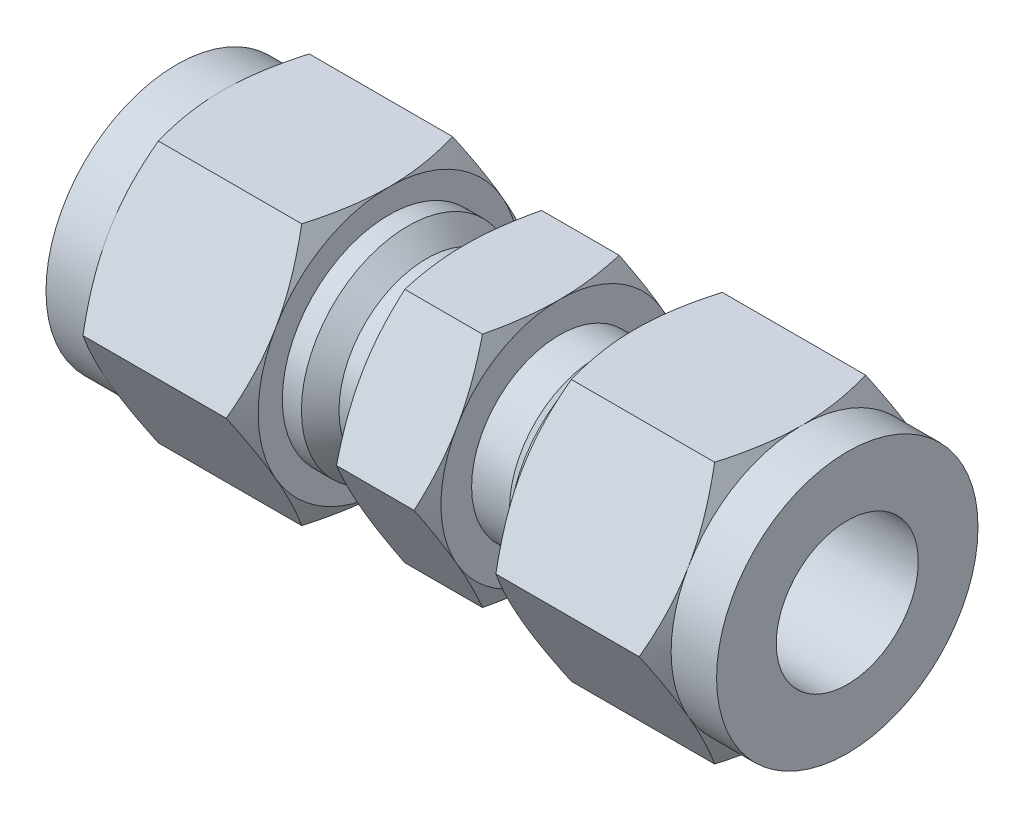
ISO-10303-21;
HEADER;
FILE_DESCRIPTION(('STEP AP214'),'2;1');
FILE_NAME('part.step','',(''),(''),'','','');
FILE_SCHEMA(('AUTOMOTIVE_DESIGN { 1 0 10303 214 1 1 1 1 }'));
ENDSEC;
DATA;
#1=APPLICATION_CONTEXT('core data for automotive mechanical design processes');
#2=APPLICATION_PROTOCOL_DEFINITION('international standard','automotive_design',2000,#1);
#3=PRODUCT_CONTEXT('',#1,'mechanical');
#4=PRODUCT('Part','Part','',(#3));
#5=PRODUCT_RELATED_PRODUCT_CATEGORY('part','',(#4));
#6=PRODUCT_DEFINITION_FORMATION('','',#4);
#7=PRODUCT_DEFINITION_CONTEXT('part definition',#1,'design');
#8=PRODUCT_DEFINITION('design','',#6,#7);
#9=PRODUCT_DEFINITION_SHAPE('','',#8);
#10=(LENGTH_UNIT() NAMED_UNIT(*) SI_UNIT(.MILLI.,.METRE.));
#11=(NAMED_UNIT(*) PLANE_ANGLE_UNIT() SI_UNIT($,.RADIAN.));
#12=(NAMED_UNIT(*) SI_UNIT($,.STERADIAN.) SOLID_ANGLE_UNIT());
#13=UNCERTAINTY_MEASURE_WITH_UNIT(LENGTH_MEASURE(1.E-05),#10,'distance_accuracy_value','');
#14=(GEOMETRIC_REPRESENTATION_CONTEXT(3) GLOBAL_UNCERTAINTY_ASSIGNED_CONTEXT((#13)) GLOBAL_UNIT_ASSIGNED_CONTEXT((#10,
#11,#12)) REPRESENTATION_CONTEXT('',''));
#15=CARTESIAN_POINT('',(0.,0.,0.));
#16=DIRECTION('',(0.,0.,1.));
#17=DIRECTION('',(1.,0.,0.));
#18=AXIS2_PLACEMENT_3D('',#15,#16,#17);
#19=CARTESIAN_POINT('',(19.304,0.,0.));
#20=DIRECTION('',(1.,0.,0.));
#21=DIRECTION('',(0.,1.,0.));
#22=AXIS2_PLACEMENT_3D('',#19,#20,#21);
#23=PLANE('',#22);
#24=CARTESIAN_POINT('',(19.304,0.,0.));
#25=DIRECTION('',(1.,0.,0.));
#26=DIRECTION('',(0.,0.,-1.));
#27=AXIS2_PLACEMENT_3D('',#24,#25,#26);
#28=CIRCLE('',#27,7.9375);
#29=CARTESIAN_POINT('',(19.304,3.96874999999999,6.87407664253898));
#30=VERTEX_POINT('',#29);
#31=CARTESIAN_POINT('',(19.304,7.9375,0.));
#32=VERTEX_POINT('',#31);
#33=EDGE_CURVE('E268',#30,#32,#28,.F.);
#34=ORIENTED_EDGE('',*,*,#33,.T.);
#35=CARTESIAN_POINT('',(19.304,0.,0.));
#36=DIRECTION('',(1.,0.,0.));
#37=DIRECTION('',(0.,0.,-1.));
#38=AXIS2_PLACEMENT_3D('',#35,#36,#37);
#39=CIRCLE('',#38,7.9375);
#40=CARTESIAN_POINT('',(19.3040000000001,3.96874999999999,-6.87407664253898));
#41=VERTEX_POINT('',#40);
#42=EDGE_CURVE('E254',#32,#41,#39,.F.);
#43=ORIENTED_EDGE('',*,*,#42,.T.);
#44=CARTESIAN_POINT('',(19.304,0.,0.));
#45=DIRECTION('',(1.,0.,0.));
#46=DIRECTION('',(0.,0.,-1.));
#47=AXIS2_PLACEMENT_3D('',#44,#45,#46);
#48=CIRCLE('',#47,7.9375);
#49=CARTESIAN_POINT('',(19.304,-3.96875000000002,-6.87407664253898));
#50=VERTEX_POINT('',#49);
#51=EDGE_CURVE('E20',#41,#50,#48,.F.);
#52=ORIENTED_EDGE('',*,*,#51,.T.);
#53=CARTESIAN_POINT('',(19.304,0.,0.));
#54=DIRECTION('',(1.,0.,0.));
#55=DIRECTION('',(0.,0.,-1.));
#56=AXIS2_PLACEMENT_3D('',#53,#54,#55);
#57=CIRCLE('',#56,7.9375);
#58=CARTESIAN_POINT('',(19.304,-7.9375,0.));
#59=VERTEX_POINT('',#58);
#60=EDGE_CURVE('E441',#50,#59,#57,.F.);
#61=ORIENTED_EDGE('',*,*,#60,.T.);
#62=CARTESIAN_POINT('',(19.304,0.,0.));
#63=DIRECTION('',(1.,0.,0.));
#64=DIRECTION('',(0.,0.,-1.));
#65=AXIS2_PLACEMENT_3D('',#62,#63,#64);
#66=CIRCLE('',#65,7.9375);
#67=CARTESIAN_POINT('',(19.304,-3.96875000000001,6.87407664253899));
#68=VERTEX_POINT('',#67);
#69=EDGE_CURVE('E436',#59,#68,#66,.F.);
#70=ORIENTED_EDGE('',*,*,#69,.T.);
#71=CARTESIAN_POINT('',(19.304,0.,0.));
#72=DIRECTION('',(1.,0.,0.));
#73=DIRECTION('',(0.,0.,-1.));
#74=AXIS2_PLACEMENT_3D('',#71,#72,#73);
#75=CIRCLE('',#74,7.9375);
#76=EDGE_CURVE('E439',#68,#30,#75,.F.);
#77=ORIENTED_EDGE('',*,*,#76,.T.);
#78=EDGE_LOOP('',(#34,#43,#52,#61,#70,#77));
#79=FACE_BOUND('',#78,.T.);
#80=CARTESIAN_POINT('',(19.304,0.,0.));
#81=DIRECTION('',(1.,0.,0.));
#82=DIRECTION('',(0.,0.,-1.));
#83=AXIS2_PLACEMENT_3D('',#80,#81,#82);
#84=CIRCLE('',#83,5.88391);
#85=CARTESIAN_POINT('',(19.304,0.,-5.88391));
#86=VERTEX_POINT('',#85);
#87=EDGE_CURVE('E430',#86,#86,#84,.F.);
#88=ORIENTED_EDGE('',*,*,#87,.F.);
#89=EDGE_LOOP('',(#88));
#90=FACE_BOUND('',#89,.T.);
#91=ADVANCED_FACE('F17',(#79,#90),#23,.F.);
#92=CARTESIAN_POINT('',(19.304,0.,0.));
#93=DIRECTION('',(1.,0.,0.));
#94=DIRECTION('',(0.,0.,-1.));
#95=AXIS2_PLACEMENT_3D('',#92,#93,#94);
#96=CONICAL_SURFACE('',#95,7.9375,1.13446401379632);
#97=ORIENTED_EDGE('',*,*,#51,.F.);
#98=CARTESIAN_POINT('',(19.8765957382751,0.,-9.16543552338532));
#99=CARTESIAN_POINT('',(19.7888994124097,0.325620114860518,-8.97743866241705));
#100=CARTESIAN_POINT('',(19.7088667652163,0.652994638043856,-8.78842889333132));
#101=CARTESIAN_POINT('',(19.5679866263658,1.30966131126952,-8.40930221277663));
#102=CARTESIAN_POINT('',(19.507075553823,1.63894331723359,-8.21919115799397));
#103=CARTESIAN_POINT('',(19.4324916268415,2.13489828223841,-7.93285142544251));
#104=CARTESIAN_POINT('',(19.4104216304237,2.300626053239,-7.83716845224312));
#105=CARTESIAN_POINT('',(19.3722622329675,2.63259891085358,-7.6455038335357));
#106=CARTESIAN_POINT('',(19.3561727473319,2.79884399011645,-7.54952219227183));
#107=CARTESIAN_POINT('',(19.3302436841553,3.13225909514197,-7.35702489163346));
#108=CARTESIAN_POINT('',(19.3204251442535,3.29943035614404,-7.26050851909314));
#109=CARTESIAN_POINT('',(19.307291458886,3.6339828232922,-7.0673545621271));
#110=CARTESIAN_POINT('',(19.3039770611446,3.80136405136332,-6.97071696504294));
#111=CARTESIAN_POINT('',(19.3040000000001,3.96874999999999,-6.87407664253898));
#112=B_SPLINE_CURVE_WITH_KNOTS('',3,(#98,#99,#100,#101,#102,#103,#104,#105,#106,#107,#108,#109,
#110,#111),.UNSPECIFIED.,.F.,.F.,(4,2,2,2,2,2,4),(0.,1.1585482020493,2.3132022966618,
2.89102016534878,3.46882986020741,4.04856793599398,4.62837265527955),.UNSPECIFIED.);
#113=CARTESIAN_POINT('',(19.8765957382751,0.,-9.16543552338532));
#114=VERTEX_POINT('',#113);
#115=EDGE_CURVE('E249',#114,#41,#112,.T.);
#116=ORIENTED_EDGE('',*,*,#115,.F.);
#117=CARTESIAN_POINT('',(19.304,-3.96875000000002,-6.87407664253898));
#118=CARTESIAN_POINT('',(19.3039770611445,-3.80136405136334,-6.97071696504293));
#119=CARTESIAN_POINT('',(19.307291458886,-3.63398282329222,-7.06735456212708));
#120=CARTESIAN_POINT('',(19.3204251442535,-3.29943035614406,-7.26050851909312));
#121=CARTESIAN_POINT('',(19.3302436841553,-3.13225909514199,-7.35702489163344));
#122=CARTESIAN_POINT('',(19.3561727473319,-2.79884399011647,-7.54952219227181));
#123=CARTESIAN_POINT('',(19.3722622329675,-2.6325989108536,-7.64550383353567));
#124=CARTESIAN_POINT('',(19.4104216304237,-2.30062605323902,-7.8371684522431));
#125=CARTESIAN_POINT('',(19.4324916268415,-2.13489828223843,-7.93285142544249));
#126=CARTESIAN_POINT('',(19.507075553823,-1.63894331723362,-8.21919115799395));
#127=CARTESIAN_POINT('',(19.5679866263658,-1.30966131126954,-8.40930221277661));
#128=CARTESIAN_POINT('',(19.7088667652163,-0.652994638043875,-8.78842889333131));
#129=CARTESIAN_POINT('',(19.7888994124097,-0.325620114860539,-8.97743866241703));
#130=CARTESIAN_POINT('',(19.8765957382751,0.,-9.16543552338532));
#131=B_SPLINE_CURVE_WITH_KNOTS('',3,(#117,#118,#119,#120,#121,#122,#123,#124,#125,#126,#127,
#128,#129,#130),.UNSPECIFIED.,.F.,.F.,(4,2,2,2,2,2,4),(0.,0.579804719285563,1.15954279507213,
1.73735248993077,2.31517035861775,3.46982445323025,4.62837265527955),.UNSPECIFIED.);
#132=EDGE_CURVE('E250',#50,#114,#131,.T.);
#133=ORIENTED_EDGE('',*,*,#132,.F.);
#134=EDGE_LOOP('',(#97,#116,#133));
#135=FACE_BOUND('',#134,.T.);
#136=ADVANCED_FACE('F248',(#135),#96,.T.);
#137=CARTESIAN_POINT('',(19.304,0.,0.));
#138=DIRECTION('',(1.,0.,0.));
#139=DIRECTION('',(0.,0.,-1.));
#140=AXIS2_PLACEMENT_3D('',#137,#138,#139);
#141=CONICAL_SURFACE('',#140,7.9375,1.13446401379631);
#142=ORIENTED_EDGE('',*,*,#42,.F.);
#143=CARTESIAN_POINT('',(19.8765957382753,7.93749999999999,-4.58271776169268));
#144=CARTESIAN_POINT('',(19.7888994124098,7.93749999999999,-4.20672403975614));
#145=CARTESIAN_POINT('',(19.7088667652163,7.9375,-3.82870450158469));
#146=CARTESIAN_POINT('',(19.5679866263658,7.9375,-3.0704511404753));
#147=CARTESIAN_POINT('',(19.507075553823,7.9375,-2.69022903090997));
#148=CARTESIAN_POINT('',(19.4324916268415,7.9375,-2.11754956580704));
#149=CARTESIAN_POINT('',(19.4104216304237,7.9375,-1.92618361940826));
#150=CARTESIAN_POINT('',(19.3722622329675,7.9375,-1.5428543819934));
#151=CARTESIAN_POINT('',(19.3561727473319,7.9375,-1.35089109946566));
#152=CARTESIAN_POINT('',(19.3302436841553,7.9375,-0.965896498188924));
#153=CARTESIAN_POINT('',(19.3204251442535,7.9375,-0.772863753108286));
#154=CARTESIAN_POINT('',(19.307291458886,7.9375,-0.386555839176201));
#155=CARTESIAN_POINT('',(19.3039770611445,7.9375,-0.19328064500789));
#156=CARTESIAN_POINT('',(19.304,7.9375,0.));
#157=B_SPLINE_CURVE_WITH_KNOTS('',3,(#143,#144,#145,#146,#147,#148,#149,#150,#151,#152,#153,
#154,#155,#156),.UNSPECIFIED.,.F.,.F.,(4,2,2,2,2,2,4),(0.,1.15854820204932,2.31320229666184,
2.89102016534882,3.46882986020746,4.04856793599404,4.62837265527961),.UNSPECIFIED.);
#158=CARTESIAN_POINT('',(19.8765957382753,7.93749999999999,-4.58271776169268));
#159=VERTEX_POINT('',#158);
#160=EDGE_CURVE('E274',#159,#32,#157,.T.);
#161=ORIENTED_EDGE('',*,*,#160,.F.);
#162=CARTESIAN_POINT('',(19.3040000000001,3.96874999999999,-6.87407664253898));
#163=CARTESIAN_POINT('',(19.3039770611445,4.13613594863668,-6.77743632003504));
#164=CARTESIAN_POINT('',(19.307291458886,4.30351717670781,-6.68079872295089));
#165=CARTESIAN_POINT('',(19.3204251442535,4.63806964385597,-6.48764476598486));
#166=CARTESIAN_POINT('',(19.3302436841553,4.80524090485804,-6.39112839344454));
#167=CARTESIAN_POINT('',(19.3561727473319,5.13865600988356,-6.19863109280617));
#168=CARTESIAN_POINT('',(19.3722622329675,5.30490108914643,-6.1026494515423));
#169=CARTESIAN_POINT('',(19.4104216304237,5.63687394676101,-5.91098483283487));
#170=CARTESIAN_POINT('',(19.4324916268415,5.8026017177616,-5.81530185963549));
#171=CARTESIAN_POINT('',(19.507075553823,6.29855668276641,-5.52896212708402));
#172=CARTESIAN_POINT('',(19.5679866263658,6.62783868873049,-5.33885107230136));
#173=CARTESIAN_POINT('',(19.7088667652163,7.28450536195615,-4.95972439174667));
#174=CARTESIAN_POINT('',(19.7888994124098,7.61187988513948,-4.77071462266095));
#175=CARTESIAN_POINT('',(19.8765957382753,7.93749999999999,-4.58271776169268));
#176=B_SPLINE_CURVE_WITH_KNOTS('',3,(#162,#163,#164,#165,#166,#167,#168,#169,#170,#171,#172,
#173,#174,#175),.UNSPECIFIED.,.F.,.F.,(4,2,2,2,2,2,4),(0.,0.579804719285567,1.15954279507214,
1.73735248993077,2.31517035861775,3.46982445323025,4.62837265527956),.UNSPECIFIED.);
#177=EDGE_CURVE('E259',#41,#159,#176,.T.);
#178=ORIENTED_EDGE('',*,*,#177,.F.);
#179=EDGE_LOOP('',(#142,#161,#178));
#180=FACE_BOUND('',#179,.T.);
#181=ADVANCED_FACE('F273',(#180),#141,.T.);
#182=CARTESIAN_POINT('',(19.304,0.,0.));
#183=DIRECTION('',(1.,0.,0.));
#184=DIRECTION('',(0.,0.,-1.));
#185=AXIS2_PLACEMENT_3D('',#182,#183,#184);
#186=CONICAL_SURFACE('',#185,7.9375,1.13446401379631);
#187=ORIENTED_EDGE('',*,*,#33,.F.);
#188=CARTESIAN_POINT('',(19.8765957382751,7.9375,4.58271776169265));
#189=CARTESIAN_POINT('',(19.7888994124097,7.61187988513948,4.77071462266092));
#190=CARTESIAN_POINT('',(19.7088667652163,7.28450536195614,4.95972439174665));
#191=CARTESIAN_POINT('',(19.5679866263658,6.62783868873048,5.33885107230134));
#192=CARTESIAN_POINT('',(19.507075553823,6.2985566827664,5.528962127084));
#193=CARTESIAN_POINT('',(19.4324916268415,5.80260171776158,5.81530185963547));
#194=CARTESIAN_POINT('',(19.4104216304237,5.63687394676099,5.91098483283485));
#195=CARTESIAN_POINT('',(19.3722622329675,5.30490108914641,6.10264945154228));
#196=CARTESIAN_POINT('',(19.3561727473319,5.13865600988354,6.19863109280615));
#197=CARTESIAN_POINT('',(19.3302436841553,4.80524090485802,6.39112839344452));
#198=CARTESIAN_POINT('',(19.3204251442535,4.63806964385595,6.48764476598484));
#199=CARTESIAN_POINT('',(19.307291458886,4.30351717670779,6.68079872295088));
#200=CARTESIAN_POINT('',(19.3039770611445,4.13613594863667,6.77743632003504));
#201=CARTESIAN_POINT('',(19.304,3.96874999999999,6.87407664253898));
#202=B_SPLINE_CURVE_WITH_KNOTS('',3,(#188,#189,#190,#191,#192,#193,#194,#195,#196,#197,#198,
#199,#200,#201),.UNSPECIFIED.,.F.,.F.,(4,2,2,2,2,2,4),(0.,1.1585482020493,2.31320229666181,
2.89102016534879,3.46882986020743,4.048567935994,4.62837265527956),.UNSPECIFIED.);
#203=CARTESIAN_POINT('',(19.8765957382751,7.9375,4.58271776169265));
#204=VERTEX_POINT('',#203);
#205=EDGE_CURVE('E456',#204,#30,#202,.T.);
#206=ORIENTED_EDGE('',*,*,#205,.F.);
#207=CARTESIAN_POINT('',(19.304,7.9375,0.));
#208=CARTESIAN_POINT('',(19.3039770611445,7.9375,0.193280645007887));
#209=CARTESIAN_POINT('',(19.307291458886,7.9375,0.386555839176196));
#210=CARTESIAN_POINT('',(19.3204251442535,7.9375,0.772863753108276));
#211=CARTESIAN_POINT('',(19.3302436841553,7.9375,0.965896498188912));
#212=CARTESIAN_POINT('',(19.3561727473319,7.9375,1.35089109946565));
#213=CARTESIAN_POINT('',(19.3722622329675,7.9375,1.54285438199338));
#214=CARTESIAN_POINT('',(19.4104216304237,7.9375,1.92618361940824));
#215=CARTESIAN_POINT('',(19.4324916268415,7.9375,2.11754956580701));
#216=CARTESIAN_POINT('',(19.507075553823,7.9375,2.69022903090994));
#217=CARTESIAN_POINT('',(19.5679866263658,7.9375,3.07045114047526));
#218=CARTESIAN_POINT('',(19.7088667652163,7.9375,3.82870450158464));
#219=CARTESIAN_POINT('',(19.7888994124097,7.9375,4.20672403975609));
#220=CARTESIAN_POINT('',(19.8765957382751,7.9375,4.58271776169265));
#221=B_SPLINE_CURVE_WITH_KNOTS('',3,(#207,#208,#209,#210,#211,#212,#213,#214,#215,#216,#217,
#218,#219,#220),.UNSPECIFIED.,.F.,.F.,(4,2,2,2,2,2,4),(0.,0.579804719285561,1.15954279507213,
1.73735248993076,2.31517035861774,3.46982445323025,4.62837265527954),.UNSPECIFIED.);
#222=EDGE_CURVE('E469',#32,#204,#221,.T.);
#223=ORIENTED_EDGE('',*,*,#222,.F.);
#224=EDGE_LOOP('',(#187,#206,#223));
#225=FACE_BOUND('',#224,.T.);
#226=ADVANCED_FACE('F418',(#225),#186,.T.);
#227=CARTESIAN_POINT('',(19.304,0.,0.));
#228=DIRECTION('',(1.,0.,0.));
#229=DIRECTION('',(0.,0.,-1.));
#230=AXIS2_PLACEMENT_3D('',#227,#228,#229);
#231=CONICAL_SURFACE('',#230,7.9375,1.13446401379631);
#232=CARTESIAN_POINT('',(19.304,-7.9375,0.));
#233=CARTESIAN_POINT('',(19.3039770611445,-7.93750000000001,-0.193280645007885));
#234=CARTESIAN_POINT('',(19.307291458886,-7.93750000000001,-0.386555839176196));
#235=CARTESIAN_POINT('',(19.3204251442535,-7.93750000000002,-0.772863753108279));
#236=CARTESIAN_POINT('',(19.3302436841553,-7.93750000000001,-0.965896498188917));
#237=CARTESIAN_POINT('',(19.3561727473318,-7.93750000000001,-1.35089109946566));
#238=CARTESIAN_POINT('',(19.3722622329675,-7.93750000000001,-1.54285438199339));
#239=CARTESIAN_POINT('',(19.4104216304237,-7.93750000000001,-1.92618361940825));
#240=CARTESIAN_POINT('',(19.4324916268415,-7.93750000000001,-2.11754956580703));
#241=CARTESIAN_POINT('',(19.507075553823,-7.93750000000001,-2.69022903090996));
#242=CARTESIAN_POINT('',(19.5679866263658,-7.93750000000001,-3.07045114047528));
#243=CARTESIAN_POINT('',(19.7088667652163,-7.93750000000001,-3.82870450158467));
#244=CARTESIAN_POINT('',(19.7888994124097,-7.93750000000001,-4.20672403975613));
#245=CARTESIAN_POINT('',(19.8765957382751,-7.93750000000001,-4.58271776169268));
#246=B_SPLINE_CURVE_WITH_KNOTS('',3,(#232,#233,#234,#235,#236,#237,#238,#239,#240,#241,#242,
#243,#244,#245),.UNSPECIFIED.,.F.,.F.,(4,2,2,2,2,2,4),(0.,0.579804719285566,1.15954279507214,
1.73735248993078,2.31517035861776,3.46982445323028,4.62837265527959),.UNSPECIFIED.);
#247=CARTESIAN_POINT('',(19.8765957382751,-7.93750000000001,-4.58271776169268));
#248=VERTEX_POINT('',#247);
#249=EDGE_CURVE('E398',#59,#248,#246,.T.);
#250=ORIENTED_EDGE('',*,*,#249,.F.);
#251=ORIENTED_EDGE('',*,*,#60,.F.);
#252=CARTESIAN_POINT('',(19.8765957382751,-7.93750000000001,-4.58271776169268));
#253=CARTESIAN_POINT('',(19.7888994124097,-7.61187988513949,-4.77071462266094));
#254=CARTESIAN_POINT('',(19.7088667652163,-7.28450536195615,-4.95972439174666));
#255=CARTESIAN_POINT('',(19.5679866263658,-6.62783868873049,-5.33885107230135));
#256=CARTESIAN_POINT('',(19.507075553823,-6.29855668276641,-5.52896212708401));
#257=CARTESIAN_POINT('',(19.4324916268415,-5.8026017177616,-5.81530185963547));
#258=CARTESIAN_POINT('',(19.4104216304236,-5.63687394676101,-5.91098483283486));
#259=CARTESIAN_POINT('',(19.3722622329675,-5.30490108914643,-6.10264945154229));
#260=CARTESIAN_POINT('',(19.3561727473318,-5.13865600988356,-6.19863109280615));
#261=CARTESIAN_POINT('',(19.3302436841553,-4.80524090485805,-6.39112839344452));
#262=CARTESIAN_POINT('',(19.3204251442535,-4.63806964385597,-6.48764476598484));
#263=CARTESIAN_POINT('',(19.307291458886,-4.30351717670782,-6.68079872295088));
#264=CARTESIAN_POINT('',(19.3039770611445,-4.13613594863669,-6.77743632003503));
#265=CARTESIAN_POINT('',(19.304,-3.96875000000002,-6.87407664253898));
#266=B_SPLINE_CURVE_WITH_KNOTS('',3,(#252,#253,#254,#255,#256,#257,#258,#259,#260,#261,#262,
#263,#264,#265),.UNSPECIFIED.,.F.,.F.,(4,2,2,2,2,2,4),(0.,1.1585482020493,2.3132022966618,
2.89102016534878,3.46882986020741,4.04856793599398,4.62837265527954),.UNSPECIFIED.);
#267=EDGE_CURVE('E424',#248,#50,#266,.T.);
#268=ORIENTED_EDGE('',*,*,#267,.F.);
#269=EDGE_LOOP('',(#250,#251,#268));
#270=FACE_BOUND('',#269,.T.);
#271=ADVANCED_FACE('F414',(#270),#231,.T.);
#272=CARTESIAN_POINT('',(19.304,0.,0.));
#273=DIRECTION('',(1.,0.,0.));
#274=DIRECTION('',(0.,0.,-1.));
#275=AXIS2_PLACEMENT_3D('',#272,#273,#274);
#276=CONICAL_SURFACE('',#275,7.9375,1.13446401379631);
#277=ORIENTED_EDGE('',*,*,#76,.F.);
#278=CARTESIAN_POINT('',(19.8765957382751,0.,9.1654355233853));
#279=CARTESIAN_POINT('',(19.7888994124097,-0.325620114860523,8.97743866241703));
#280=CARTESIAN_POINT('',(19.7088667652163,-0.652994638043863,8.7884288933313));
#281=CARTESIAN_POINT('',(19.5679866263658,-1.30966131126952,8.40930221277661));
#282=CARTESIAN_POINT('',(19.507075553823,-1.6389433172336,8.21919115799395));
#283=CARTESIAN_POINT('',(19.4324916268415,-2.13489828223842,7.93285142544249));
#284=CARTESIAN_POINT('',(19.4104216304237,-2.30062605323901,7.8371684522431));
#285=CARTESIAN_POINT('',(19.3722622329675,-2.63259891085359,7.64550383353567));
#286=CARTESIAN_POINT('',(19.3561727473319,-2.79884399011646,7.54952219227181));
#287=CARTESIAN_POINT('',(19.3302436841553,-3.13225909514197,7.35702489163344));
#288=CARTESIAN_POINT('',(19.3204251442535,-3.29943035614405,7.26050851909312));
#289=CARTESIAN_POINT('',(19.307291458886,-3.6339828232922,7.06735456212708));
#290=CARTESIAN_POINT('',(19.3039770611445,-3.80136405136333,6.97071696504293));
#291=CARTESIAN_POINT('',(19.304,-3.96875000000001,6.87407664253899));
#292=B_SPLINE_CURVE_WITH_KNOTS('',3,(#278,#279,#280,#281,#282,#283,#284,#285,#286,#287,#288,
#289,#290,#291),.UNSPECIFIED.,.F.,.F.,(4,2,2,2,2,2,4),(0.,1.1585482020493,2.3132022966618,
2.89102016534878,3.46882986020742,4.04856793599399,4.62837265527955),.UNSPECIFIED.);
#293=CARTESIAN_POINT('',(19.8765957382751,0.,9.1654355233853));
#294=VERTEX_POINT('',#293);
#295=EDGE_CURVE('E405',#294,#68,#292,.T.);
#296=ORIENTED_EDGE('',*,*,#295,.F.);
#297=CARTESIAN_POINT('',(19.304,3.96874999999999,6.87407664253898));
#298=CARTESIAN_POINT('',(19.3039770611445,3.80136405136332,6.97071696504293));
#299=CARTESIAN_POINT('',(19.307291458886,3.63398282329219,7.06735456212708));
#300=CARTESIAN_POINT('',(19.3204251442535,3.29943035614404,7.26050851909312));
#301=CARTESIAN_POINT('',(19.3302436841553,3.13225909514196,7.35702489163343));
#302=CARTESIAN_POINT('',(19.3561727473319,2.79884399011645,7.5495221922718));
#303=CARTESIAN_POINT('',(19.3722622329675,2.63259891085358,7.64550383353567));
#304=CARTESIAN_POINT('',(19.4104216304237,2.300626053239,7.8371684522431));
#305=CARTESIAN_POINT('',(19.4324916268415,2.13489828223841,7.93285142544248));
#306=CARTESIAN_POINT('',(19.507075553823,1.63894331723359,8.21919115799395));
#307=CARTESIAN_POINT('',(19.5679866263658,1.30966131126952,8.40930221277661));
#308=CARTESIAN_POINT('',(19.7088667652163,0.652994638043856,8.7884288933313));
#309=CARTESIAN_POINT('',(19.7888994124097,0.325620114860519,8.97743866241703));
#310=CARTESIAN_POINT('',(19.8765957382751,0.,9.1654355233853));
#311=B_SPLINE_CURVE_WITH_KNOTS('',3,(#297,#298,#299,#300,#301,#302,#303,#304,#305,#306,#307,
#308,#309,#310),.UNSPECIFIED.,.F.,.F.,(4,2,2,2,2,2,4),(0.,0.579804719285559,1.15954279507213,
1.73735248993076,2.31517035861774,3.46982445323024,4.62837265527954),.UNSPECIFIED.);
#312=EDGE_CURVE('E455',#30,#294,#311,.T.);
#313=ORIENTED_EDGE('',*,*,#312,.F.);
#314=EDGE_LOOP('',(#277,#296,#313));
#315=FACE_BOUND('',#314,.T.);
#316=ADVANCED_FACE('F417',(#315),#276,.T.);
#317=CARTESIAN_POINT('',(19.304,0.,0.));
#318=DIRECTION('',(1.,0.,0.));
#319=DIRECTION('',(0.,0.,-1.));
#320=AXIS2_PLACEMENT_3D('',#317,#318,#319);
#321=CONICAL_SURFACE('',#320,7.9375,1.13446401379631);
#322=CARTESIAN_POINT('',(19.304,-3.96875000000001,6.87407664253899));
#323=CARTESIAN_POINT('',(19.3039770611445,-4.13613594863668,6.77743632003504));
#324=CARTESIAN_POINT('',(19.307291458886,-4.3035171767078,6.68079872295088));
#325=CARTESIAN_POINT('',(19.3204251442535,-4.63806964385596,6.48764476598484));
#326=CARTESIAN_POINT('',(19.3302436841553,-4.80524090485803,6.39112839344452));
#327=CARTESIAN_POINT('',(19.3561727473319,-5.13865600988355,6.19863109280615));
#328=CARTESIAN_POINT('',(19.3722622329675,-5.30490108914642,6.10264945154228));
#329=CARTESIAN_POINT('',(19.4104216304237,-5.636873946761,5.91098483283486));
#330=CARTESIAN_POINT('',(19.4324916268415,-5.80260171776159,5.81530185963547));
#331=CARTESIAN_POINT('',(19.507075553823,-6.29855668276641,5.52896212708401));
#332=CARTESIAN_POINT('',(19.5679866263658,-6.62783868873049,5.33885107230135));
#333=CARTESIAN_POINT('',(19.7088667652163,-7.28450536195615,4.95972439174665));
#334=CARTESIAN_POINT('',(19.7888994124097,-7.61187988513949,4.77071462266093));
#335=CARTESIAN_POINT('',(19.8765957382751,-7.9375,4.58271776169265));
#336=B_SPLINE_CURVE_WITH_KNOTS('',3,(#322,#323,#324,#325,#326,#327,#328,#329,#330,#331,#332,
#333,#334,#335),.UNSPECIFIED.,.F.,.F.,(4,2,2,2,2,2,4),(0.,0.579804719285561,1.15954279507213,
1.73735248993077,2.31517035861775,3.46982445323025,4.62837265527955),.UNSPECIFIED.);
#337=CARTESIAN_POINT('',(19.8765957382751,-7.9375,4.58271776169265));
#338=VERTEX_POINT('',#337);
#339=EDGE_CURVE('E370',#68,#338,#336,.T.);
#340=ORIENTED_EDGE('',*,*,#339,.F.);
#341=ORIENTED_EDGE('',*,*,#69,.F.);
#342=CARTESIAN_POINT('',(19.8765957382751,-7.9375,4.58271776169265));
#343=CARTESIAN_POINT('',(19.7888994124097,-7.93750000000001,4.2067240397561));
#344=CARTESIAN_POINT('',(19.7088667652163,-7.93750000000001,3.82870450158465));
#345=CARTESIAN_POINT('',(19.5679866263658,-7.93750000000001,3.07045114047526));
#346=CARTESIAN_POINT('',(19.507075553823,-7.93750000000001,2.69022903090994));
#347=CARTESIAN_POINT('',(19.4324916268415,-7.93750000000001,2.11754956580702));
#348=CARTESIAN_POINT('',(19.4104216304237,-7.93750000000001,1.92618361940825));
#349=CARTESIAN_POINT('',(19.3722622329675,-7.93750000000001,1.54285438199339));
#350=CARTESIAN_POINT('',(19.3561727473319,-7.93750000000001,1.35089109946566));
#351=CARTESIAN_POINT('',(19.3302436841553,-7.93750000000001,0.96589649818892));
#352=CARTESIAN_POINT('',(19.3204251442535,-7.93750000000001,0.772863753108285));
#353=CARTESIAN_POINT('',(19.307291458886,-7.93750000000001,0.386555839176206));
#354=CARTESIAN_POINT('',(19.3039770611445,-7.93750000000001,0.193280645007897));
#355=CARTESIAN_POINT('',(19.304,-7.9375,0.));
#356=B_SPLINE_CURVE_WITH_KNOTS('',3,(#342,#343,#344,#345,#346,#347,#348,#349,#350,#351,#352,
#353,#354,#355),.UNSPECIFIED.,.F.,.F.,(4,2,2,2,2,2,4),(0.,1.1585482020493,2.3132022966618,
2.89102016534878,3.46882986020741,4.04856793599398,4.62837265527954),.UNSPECIFIED.);
#357=EDGE_CURVE('E404',#338,#59,#356,.T.);
#358=ORIENTED_EDGE('',*,*,#357,.F.);
#359=EDGE_LOOP('',(#340,#341,#358));
#360=FACE_BOUND('',#359,.T.);
#361=ADVANCED_FACE('F1590',(#360),#321,.T.);
#362=CARTESIAN_POINT('',(18.034,0.,0.));
#363=DIRECTION('',(1.,0.,0.));
#364=DIRECTION('',(0.,0.,-1.));
#365=AXIS2_PLACEMENT_3D('',#362,#363,#364);
#366=CYLINDRICAL_SURFACE('',#365,5.88391);
#367=ORIENTED_EDGE('',*,*,#87,.T.);
#368=EDGE_LOOP('',(#367));
#369=FACE_BOUND('',#368,.T.);
#370=CARTESIAN_POINT('',(16.7639999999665,0.,0.));
#371=DIRECTION('',(-1.,0.,0.));
#372=DIRECTION('',(0.,0.,1.));
#373=AXIS2_PLACEMENT_3D('',#370,#371,#372);
#374=CIRCLE('',#373,5.88390999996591);
#375=CARTESIAN_POINT('',(16.7639999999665,0.,5.88390999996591));
#376=VERTEX_POINT('',#375);
#377=EDGE_CURVE('E369',#376,#376,#374,.T.);
#378=ORIENTED_EDGE('',*,*,#377,.F.);
#379=EDGE_LOOP('',(#378));
#380=FACE_BOUND('',#379,.T.);
#381=ADVANCED_FACE('F1583',(#369,#380),#366,.T.);
#382=CARTESIAN_POINT('',(19.304,0.,-9.16543552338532));
#383=DIRECTION('',(0.,-0.5,-0.866025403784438));
#384=DIRECTION('',(0.,0.866025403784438,-0.5));
#385=AXIS2_PLACEMENT_3D('',#382,#383,#384);
#386=PLANE('',#385);
#387=ORIENTED_EDGE('',*,*,#132,.T.);
#388=DIRECTION('',(1.,0.,0.));
#389=VECTOR('',#388,1.);
#390=CARTESIAN_POINT('',(19.304,0.,-9.16543552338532));
#391=LINE('',#390,#389);
#392=CARTESIAN_POINT('',(25.0814042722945,-3.9259762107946E-08,-9.16543550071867));
#393=VERTEX_POINT('',#392);
#394=EDGE_CURVE('E263',#393,#114,#391,.F.);
#395=ORIENTED_EDGE('',*,*,#394,.F.);
#396=CARTESIAN_POINT('',(25.0814042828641,-7.85195380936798E-08,-9.16543547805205));
#397=CARTESIAN_POINT('',(25.1691006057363,-0.325620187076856,-8.97743862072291));
#398=CARTESIAN_POINT('',(25.2491332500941,-0.652994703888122,-8.7884288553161));
#399=CARTESIAN_POINT('',(25.390013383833,-1.30966136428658,-8.40930218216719));
#400=CARTESIAN_POINT('',(25.4509244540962,-1.63894336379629,-8.21919113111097));
#401=CARTESIAN_POINT('',(25.5255083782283,-2.13489831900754,-7.93285140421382));
#402=CARTESIAN_POINT('',(25.5475783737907,-2.30062608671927,-7.83716843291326));
#403=CARTESIAN_POINT('',(25.5857377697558,-2.63259893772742,-7.64550381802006));
#404=CARTESIAN_POINT('',(25.6018272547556,-2.79884401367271,-7.5495221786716));
#405=CARTESIAN_POINT('',(25.6277563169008,-3.13225911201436,-7.35702488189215));
#406=CARTESIAN_POINT('',(25.6375748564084,-3.29943036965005,-7.26050851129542));
#407=CARTESIAN_POINT('',(25.6507085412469,-3.6339828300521,-7.06735455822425));
#408=CARTESIAN_POINT('',(25.6540229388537,-3.8013640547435,-6.97071696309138));
#409=CARTESIAN_POINT('',(25.654,-3.96874999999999,-6.87407664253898));
#410=B_SPLINE_CURVE_WITH_KNOTS('',3,(#396,#397,#398,#399,#400,#401,#402,#403,#404,#405,#406,
#407,#408,#409),.UNSPECIFIED.,.F.,.F.,(4,2,2,2,2,2,4),(0.,1.15854817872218,2.31320225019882,
2.89102010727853,3.46882979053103,4.04856785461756,4.62837256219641),.UNSPECIFIED.);
#411=CARTESIAN_POINT('',(25.654,-3.96874999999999,-6.87407664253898));
#412=VERTEX_POINT('',#411);
#413=EDGE_CURVE('E350',#393,#412,#410,.T.);
#414=ORIENTED_EDGE('',*,*,#413,.T.);
#415=CARTESIAN_POINT('',(25.654,-3.96874999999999,-6.87407664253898));
#416=CARTESIAN_POINT('',(25.6540229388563,-4.13613595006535,-6.77743631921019));
#417=CARTESIAN_POINT('',(25.6507085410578,-4.30351717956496,-6.6807987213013));
#418=CARTESIAN_POINT('',(25.6375748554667,-4.63806964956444,-6.48764476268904));
#419=CARTESIAN_POINT('',(25.6277563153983,-4.80524091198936,-6.39112838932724));
#420=CARTESIAN_POINT('',(25.6018272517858,-5.1386560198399,-6.19863108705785));
#421=CARTESIAN_POINT('',(25.5857377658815,-5.30490110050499,-6.10264944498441));
#422=CARTESIAN_POINT('',(25.547578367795,-5.63687396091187,-5.91098482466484));
#423=CARTESIAN_POINT('',(25.5255083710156,-5.80260173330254,-5.81530185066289));
#424=CARTESIAN_POINT('',(25.4509244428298,-6.29855670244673,-5.52896211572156));
#425=CARTESIAN_POINT('',(25.3900133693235,-6.62783871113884,-5.33885105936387));
#426=CARTESIAN_POINT('',(25.2491332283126,-7.28450538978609,-4.95972437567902));
#427=CARTESIAN_POINT('',(25.1691005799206,-7.61187991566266,-4.77071460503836));
#428=CARTESIAN_POINT('',(25.0814042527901,-7.93750003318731,-4.58271774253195));
#429=B_SPLINE_CURVE_WITH_KNOTS('',3,(#415,#416,#417,#418,#419,#420,#421,#422,#423,#424,#425,
#426,#427,#428),.UNSPECIFIED.,.F.,.F.,(4,2,2,2,2,2,4),(0.,0.579804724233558,1.1595428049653,
1.73735250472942,2.31517037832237,3.46982448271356,4.62837269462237),.UNSPECIFIED.);
#430=CARTESIAN_POINT('',(25.0814042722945,-7.93749999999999,-4.5827177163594));
#431=VERTEX_POINT('',#430);
#432=EDGE_CURVE('E356',#412,#431,#429,.T.);
#433=ORIENTED_EDGE('',*,*,#432,.T.);
#434=DIRECTION('',(1.,0.,0.));
#435=VECTOR('',#434,1.);
#436=CARTESIAN_POINT('',(19.304,-7.93750000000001,-4.58271776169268));
#437=LINE('',#436,#435);
#438=EDGE_CURVE('E403',#248,#431,#437,.T.);
#439=ORIENTED_EDGE('',*,*,#438,.F.);
#440=ORIENTED_EDGE('',*,*,#267,.T.);
#441=EDGE_LOOP('',(#387,#395,#414,#433,#439,#440));
#442=FACE_BOUND('',#441,.T.);
#443=ADVANCED_FACE('F299',(#442),#386,.T.);
#444=CARTESIAN_POINT('',(19.3040000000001,7.93749999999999,-4.58271776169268));
#445=DIRECTION('',(0.,0.5,-0.866025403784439));
#446=DIRECTION('',(0.,0.866025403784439,0.5));
#447=AXIS2_PLACEMENT_3D('',#444,#445,#446);
#448=PLANE('',#447);
#449=ORIENTED_EDGE('',*,*,#177,.T.);
#450=DIRECTION('',(1.,0.,0.));
#451=VECTOR('',#450,1.);
#452=CARTESIAN_POINT('',(19.3040000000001,7.93749999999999,-4.58271776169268));
#453=LINE('',#452,#451);
#454=CARTESIAN_POINT('',(25.0814042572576,7.93750001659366,-4.58271775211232));
#455=VERTEX_POINT('',#454);
#456=EDGE_CURVE('E275',#455,#159,#453,.F.);
#457=ORIENTED_EDGE('',*,*,#456,.F.);
#458=CARTESIAN_POINT('',(25.0814042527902,7.93750003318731,-4.58271774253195));
#459=CARTESIAN_POINT('',(25.1691005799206,7.61187991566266,-4.77071460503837));
#460=CARTESIAN_POINT('',(25.2491332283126,7.28450538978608,-4.95972437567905));
#461=CARTESIAN_POINT('',(25.3900133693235,6.62783871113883,-5.3388510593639));
#462=CARTESIAN_POINT('',(25.4509244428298,6.29855670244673,-5.52896211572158));
#463=CARTESIAN_POINT('',(25.5255083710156,5.80260173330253,-5.81530185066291));
#464=CARTESIAN_POINT('',(25.547578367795,5.63687396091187,-5.91098482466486));
#465=CARTESIAN_POINT('',(25.5857377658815,5.30490110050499,-6.10264944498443));
#466=CARTESIAN_POINT('',(25.6018272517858,5.1386560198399,-6.19863108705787));
#467=CARTESIAN_POINT('',(25.6277563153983,4.80524091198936,-6.39112838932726));
#468=CARTESIAN_POINT('',(25.6375748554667,4.63806964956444,-6.48764476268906));
#469=CARTESIAN_POINT('',(25.6507085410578,4.30351717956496,-6.68079872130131));
#470=CARTESIAN_POINT('',(25.6540229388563,4.13613595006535,-6.77743631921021));
#471=CARTESIAN_POINT('',(25.6540000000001,3.96875000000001,-6.874076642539));
#472=B_SPLINE_CURVE_WITH_KNOTS('',3,(#458,#459,#460,#461,#462,#463,#464,#465,#466,#467,#468,
#469,#470,#471),.UNSPECIFIED.,.F.,.F.,(4,2,2,2,2,2,4),(0.,1.1585482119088,2.31320231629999,
2.89102018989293,3.46882988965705,4.04856797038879,4.62837269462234),.UNSPECIFIED.);
#473=CARTESIAN_POINT('',(25.6540000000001,3.96875000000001,-6.87407664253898));
#474=VERTEX_POINT('',#473);
#475=EDGE_CURVE('E316',#455,#474,#472,.T.);
#476=ORIENTED_EDGE('',*,*,#475,.T.);
#477=CARTESIAN_POINT('',(25.6540000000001,3.96875000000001,-6.874076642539));
#478=CARTESIAN_POINT('',(25.6540229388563,3.80136404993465,-6.97071696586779));
#479=CARTESIAN_POINT('',(25.6507085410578,3.63398282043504,-7.06735456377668));
#480=CARTESIAN_POINT('',(25.6375748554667,3.29943035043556,-7.26050852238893));
#481=CARTESIAN_POINT('',(25.6277563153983,3.13225908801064,-7.35702489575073));
#482=CARTESIAN_POINT('',(25.6018272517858,2.7988439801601,-7.54952219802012));
#483=CARTESIAN_POINT('',(25.5857377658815,2.63259889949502,-7.64550384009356));
#484=CARTESIAN_POINT('',(25.547578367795,2.30062603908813,-7.83716846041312));
#485=CARTESIAN_POINT('',(25.5255083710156,2.13489826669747,-7.93285143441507));
#486=CARTESIAN_POINT('',(25.4509244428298,1.63894329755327,-8.21919116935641));
#487=CARTESIAN_POINT('',(25.3900133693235,1.30966128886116,-8.4093022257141));
#488=CARTESIAN_POINT('',(25.2491332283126,0.652994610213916,-8.78842890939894));
#489=CARTESIAN_POINT('',(25.1691005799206,0.325620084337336,-8.9774386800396));
#490=CARTESIAN_POINT('',(25.0814042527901,-3.31873140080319E-08,-9.16543554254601));
#491=B_SPLINE_CURVE_WITH_KNOTS('',3,(#477,#478,#479,#480,#481,#482,#483,#484,#485,#486,#487,
#488,#489,#490),.UNSPECIFIED.,.F.,.F.,(4,2,2,2,2,2,4),(0.,0.579804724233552,1.15954280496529,
1.73735250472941,2.31517037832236,3.46982448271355,4.62837269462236),.UNSPECIFIED.);
#492=EDGE_CURVE('E307',#474,#393,#491,.T.);
#493=ORIENTED_EDGE('',*,*,#492,.T.);
#494=ORIENTED_EDGE('',*,*,#394,.T.);
#495=ORIENTED_EDGE('',*,*,#115,.T.);
#496=EDGE_LOOP('',(#449,#457,#476,#493,#494,#495));
#497=FACE_BOUND('',#496,.T.);
#498=ADVANCED_FACE('F257',(#497),#448,.T.);
#499=CARTESIAN_POINT('',(19.304,7.9375,0.));
#500=DIRECTION('',(0.,1.,0.));
#501=DIRECTION('',(0.,0.,1.));
#502=AXIS2_PLACEMENT_3D('',#499,#500,#501);
#503=PLANE('',#502);
#504=DIRECTION('',(1.,0.,0.));
#505=VECTOR('',#504,1.);
#506=CARTESIAN_POINT('',(19.304,7.9375,4.58271776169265));
#507=LINE('',#506,#505);
#508=CARTESIAN_POINT('',(25.0814042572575,7.93750000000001,4.58271778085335));
#509=VERTEX_POINT('',#508);
#510=EDGE_CURVE('E461',#509,#204,#507,.F.);
#511=ORIENTED_EDGE('',*,*,#510,.F.);
#512=CARTESIAN_POINT('',(25.0814042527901,7.9375,4.58271780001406));
#513=CARTESIAN_POINT('',(25.1691005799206,7.9375,4.20672407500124));
#514=CARTESIAN_POINT('',(25.2491332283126,7.93750000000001,3.8287045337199));
#515=CARTESIAN_POINT('',(25.3900133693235,7.93750000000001,3.07045116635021));
#516=CARTESIAN_POINT('',(25.4509244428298,7.93750000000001,2.69022905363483));
#517=CARTESIAN_POINT('',(25.5255083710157,7.93750000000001,2.11754958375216));
#518=CARTESIAN_POINT('',(25.5475783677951,7.93750000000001,1.92618363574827));
#519=CARTESIAN_POINT('',(25.5857377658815,7.93750000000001,1.54285439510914));
#520=CARTESIAN_POINT('',(25.6018272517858,7.93750000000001,1.35089111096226));
#521=CARTESIAN_POINT('',(25.6277563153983,7.93750000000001,0.965896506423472));
#522=CARTESIAN_POINT('',(25.6375748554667,7.93750000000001,0.772863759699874));
#523=CARTESIAN_POINT('',(25.6507085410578,7.93750000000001,0.386555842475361));
#524=CARTESIAN_POINT('',(25.6540229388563,7.93750000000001,0.193280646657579));
#525=CARTESIAN_POINT('',(25.654,7.9375,0.));
#526=B_SPLINE_CURVE_WITH_KNOTS('',3,(#512,#513,#514,#515,#516,#517,#518,#519,#520,#521,#522,
#523,#524,#525),.UNSPECIFIED.,.F.,.F.,(4,2,2,2,2,2,4),(0.,1.15854821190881,2.3132023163,
2.89102018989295,3.46882988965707,4.04856797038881,4.62837269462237),.UNSPECIFIED.);
#527=CARTESIAN_POINT('',(25.654,7.9375,0.));
#528=VERTEX_POINT('',#527);
#529=EDGE_CURVE('E524',#509,#528,#526,.T.);
#530=ORIENTED_EDGE('',*,*,#529,.T.);
#531=CARTESIAN_POINT('',(25.654,7.9375,0.));
#532=CARTESIAN_POINT('',(25.6540229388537,7.93750000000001,-0.193280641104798));
#533=CARTESIAN_POINT('',(25.6507085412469,7.93750000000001,-0.386555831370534));
#534=CARTESIAN_POINT('',(25.6375748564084,7.93750000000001,-0.772863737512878));
#535=CARTESIAN_POINT('',(25.6277563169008,7.93750000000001,-0.965896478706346));
#536=CARTESIAN_POINT('',(25.6018272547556,7.93750000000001,-1.35089107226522));
#537=CARTESIAN_POINT('',(25.5857377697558,7.93750000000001,-1.54285435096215));
#538=CARTESIAN_POINT('',(25.5475783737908,7.93750000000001,-1.92618358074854));
#539=CARTESIAN_POINT('',(25.5255083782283,7.93750000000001,-2.11754952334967));
#540=CARTESIAN_POINT('',(25.4509244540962,7.93750000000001,-2.69022897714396));
#541=CARTESIAN_POINT('',(25.390013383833,7.93750000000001,-3.0704510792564));
#542=CARTESIAN_POINT('',(25.2491332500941,7.93750000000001,-3.82870442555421));
#543=CARTESIAN_POINT('',(25.1691006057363,7.9375,-4.20672395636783));
#544=CARTESIAN_POINT('',(25.0814042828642,7.9375,-4.58271767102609));
#545=B_SPLINE_CURVE_WITH_KNOTS('',3,(#531,#532,#533,#534,#535,#536,#537,#538,#539,#540,#541,
#542,#543,#544),.UNSPECIFIED.,.F.,.F.,(4,2,2,2,2,2,4),(0.,0.579804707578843,1.15954277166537,
1.73735245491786,2.31517031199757,3.4698243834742,4.62837256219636),.UNSPECIFIED.);
#546=EDGE_CURVE('E324',#528,#455,#545,.T.);
#547=ORIENTED_EDGE('',*,*,#546,.T.);
#548=ORIENTED_EDGE('',*,*,#456,.T.);
#549=ORIENTED_EDGE('',*,*,#160,.T.);
#550=ORIENTED_EDGE('',*,*,#222,.T.);
#551=EDGE_LOOP('',(#511,#530,#547,#548,#549,#550));
#552=FACE_BOUND('',#551,.T.);
#553=ADVANCED_FACE('F298',(#552),#503,.T.);
#554=CARTESIAN_POINT('',(19.304,0.,9.1654355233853));
#555=DIRECTION('',(0.,0.5,0.866025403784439));
#556=DIRECTION('',(0.,-0.866025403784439,0.5));
#557=AXIS2_PLACEMENT_3D('',#554,#555,#556);
#558=PLANE('',#557);
#559=DIRECTION('',(1.,0.,0.));
#560=VECTOR('',#559,1.);
#561=CARTESIAN_POINT('',(19.304,0.,9.1654355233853));
#562=LINE('',#561,#560);
#563=CARTESIAN_POINT('',(25.0814042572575,-1.65936570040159E-08,9.16543553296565));
#564=VERTEX_POINT('',#563);
#565=EDGE_CURVE('E734',#564,#294,#562,.F.);
#566=ORIENTED_EDGE('',*,*,#565,.F.);
#567=CARTESIAN_POINT('',(25.0814042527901,-3.31873140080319E-08,9.16543554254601));
#568=CARTESIAN_POINT('',(25.1691005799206,0.325620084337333,8.9774386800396));
#569=CARTESIAN_POINT('',(25.2491332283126,0.652994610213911,8.78842890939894));
#570=CARTESIAN_POINT('',(25.3900133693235,1.30966128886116,8.40930222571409));
#571=CARTESIAN_POINT('',(25.4509244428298,1.63894329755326,8.21919116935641));
#572=CARTESIAN_POINT('',(25.5255083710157,2.13489826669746,7.93285143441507));
#573=CARTESIAN_POINT('',(25.5475783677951,2.30062603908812,7.83716846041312));
#574=CARTESIAN_POINT('',(25.5857377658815,2.632598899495,7.64550384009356));
#575=CARTESIAN_POINT('',(25.6018272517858,2.79884398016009,7.54952219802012));
#576=CARTESIAN_POINT('',(25.6277563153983,3.13225908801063,7.35702489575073));
#577=CARTESIAN_POINT('',(25.6375748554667,3.29943035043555,7.26050852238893));
#578=CARTESIAN_POINT('',(25.6507085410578,3.63398282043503,7.06735456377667));
#579=CARTESIAN_POINT('',(25.6540229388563,3.80136404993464,6.97071696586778));
#580=CARTESIAN_POINT('',(25.654,3.96874999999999,6.87407664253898));
#581=B_SPLINE_CURVE_WITH_KNOTS('',3,(#567,#568,#569,#570,#571,#572,#573,#574,#575,#576,#577,
#578,#579,#580),.UNSPECIFIED.,.F.,.F.,(4,2,2,2,2,2,4),(0.,1.15854821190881,2.3132023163,
2.89102018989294,3.46882988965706,4.0485679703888,4.62837269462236),.UNSPECIFIED.);
#582=CARTESIAN_POINT('',(25.654,3.96874999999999,6.87407664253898));
#583=VERTEX_POINT('',#582);
#584=EDGE_CURVE('E514',#564,#583,#581,.T.);
#585=ORIENTED_EDGE('',*,*,#584,.T.);
#586=CARTESIAN_POINT('',(25.654,3.96874999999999,6.87407664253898));
#587=CARTESIAN_POINT('',(25.6540229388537,4.13613594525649,6.77743632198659));
#588=CARTESIAN_POINT('',(25.6507085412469,4.30351716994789,6.68079872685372));
#589=CARTESIAN_POINT('',(25.6375748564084,4.63806963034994,6.48764477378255));
#590=CARTESIAN_POINT('',(25.6277563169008,4.80524088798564,6.39112840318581));
#591=CARTESIAN_POINT('',(25.6018272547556,5.13865598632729,6.19863110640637));
#592=CARTESIAN_POINT('',(25.5857377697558,5.30490106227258,6.10264946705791));
#593=CARTESIAN_POINT('',(25.5475783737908,5.63687391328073,5.91098485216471));
#594=CARTESIAN_POINT('',(25.5255083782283,5.80260168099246,5.81530188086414));
#595=CARTESIAN_POINT('',(25.4509244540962,6.29855663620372,5.528962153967));
#596=CARTESIAN_POINT('',(25.390013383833,6.62783863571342,5.33885110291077));
#597=CARTESIAN_POINT('',(25.2491332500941,7.28450529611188,4.95972442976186));
#598=CARTESIAN_POINT('',(25.1691006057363,7.61187981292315,4.77071466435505));
#599=CARTESIAN_POINT('',(25.0814042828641,7.93749992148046,4.58271780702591));
#600=B_SPLINE_CURVE_WITH_KNOTS('',3,(#586,#587,#588,#589,#590,#591,#592,#593,#594,#595,#596,
#597,#598,#599),.UNSPECIFIED.,.F.,.F.,(4,2,2,2,2,2,4),(0.,0.579804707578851,1.15954277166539,
1.73735245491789,2.3151703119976,3.46982438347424,4.62837256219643),.UNSPECIFIED.);
#601=EDGE_CURVE('E323',#583,#509,#600,.T.);
#602=ORIENTED_EDGE('',*,*,#601,.T.);
#603=ORIENTED_EDGE('',*,*,#510,.T.);
#604=ORIENTED_EDGE('',*,*,#205,.T.);
#605=ORIENTED_EDGE('',*,*,#312,.T.);
#606=EDGE_LOOP('',(#566,#585,#602,#603,#604,#605));
#607=FACE_BOUND('',#606,.T.);
#608=ADVANCED_FACE('F381',(#607),#558,.T.);
#609=CARTESIAN_POINT('',(19.304,-7.93750000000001,-4.58271776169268));
#610=DIRECTION('',(0.,-1.,0.));
#611=DIRECTION('',(0.,0.,-1.));
#612=AXIS2_PLACEMENT_3D('',#609,#610,#611);
#613=PLANE('',#612);
#614=ORIENTED_EDGE('',*,*,#249,.T.);
#615=ORIENTED_EDGE('',*,*,#438,.T.);
#616=CARTESIAN_POINT('',(25.0814042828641,-7.9375,-4.5827176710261));
#617=CARTESIAN_POINT('',(25.1691006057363,-7.9375,-4.20672395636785));
#618=CARTESIAN_POINT('',(25.2491332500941,-7.93750000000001,-3.82870442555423));
#619=CARTESIAN_POINT('',(25.390013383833,-7.93750000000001,-3.07045107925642));
#620=CARTESIAN_POINT('',(25.4509244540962,-7.93750000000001,-2.69022897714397));
#621=CARTESIAN_POINT('',(25.5255083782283,-7.93750000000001,-2.11754952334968));
#622=CARTESIAN_POINT('',(25.5475783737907,-7.93750000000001,-1.92618358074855));
#623=CARTESIAN_POINT('',(25.5857377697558,-7.93750000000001,-1.54285435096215));
#624=CARTESIAN_POINT('',(25.6018272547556,-7.93750000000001,-1.35089107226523));
#625=CARTESIAN_POINT('',(25.6277563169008,-7.93750000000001,-0.965896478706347));
#626=CARTESIAN_POINT('',(25.6375748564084,-7.93750000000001,-0.772863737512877));
#627=CARTESIAN_POINT('',(25.6507085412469,-7.9375,-0.386555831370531));
#628=CARTESIAN_POINT('',(25.6540229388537,-7.9375,-0.193280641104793));
#629=CARTESIAN_POINT('',(25.654,-7.93749999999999,0.));
#630=B_SPLINE_CURVE_WITH_KNOTS('',3,(#616,#617,#618,#619,#620,#621,#622,#623,#624,#625,#626,
#627,#628,#629),.UNSPECIFIED.,.F.,.F.,(4,2,2,2,2,2,4),(0.,1.15854817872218,2.31320225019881,
2.89102010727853,3.46882979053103,4.04856785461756,4.62837256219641),.UNSPECIFIED.);
#631=CARTESIAN_POINT('',(25.654,-7.93749999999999,0.));
#632=VERTEX_POINT('',#631);
#633=EDGE_CURVE('E362',#431,#632,#630,.T.);
#634=ORIENTED_EDGE('',*,*,#633,.T.);
#635=CARTESIAN_POINT('',(25.654,-7.93749999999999,0.));
#636=CARTESIAN_POINT('',(25.6540229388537,-7.9375,0.193280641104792));
#637=CARTESIAN_POINT('',(25.6507085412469,-7.9375,0.38655583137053));
#638=CARTESIAN_POINT('',(25.6375748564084,-7.93750000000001,0.772863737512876));
#639=CARTESIAN_POINT('',(25.6277563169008,-7.93750000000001,0.965896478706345));
#640=CARTESIAN_POINT('',(25.6018272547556,-7.93750000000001,1.35089107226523));
#641=CARTESIAN_POINT('',(25.5857377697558,-7.93750000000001,1.54285435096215));
#642=CARTESIAN_POINT('',(25.5475783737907,-7.93750000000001,1.92618358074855));
#643=CARTESIAN_POINT('',(25.5255083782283,-7.93750000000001,2.11754952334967));
#644=CARTESIAN_POINT('',(25.4509244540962,-7.93750000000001,2.69022897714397));
#645=CARTESIAN_POINT('',(25.390013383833,-7.93750000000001,3.07045107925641));
#646=CARTESIAN_POINT('',(25.2491332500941,-7.93750000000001,3.82870442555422));
#647=CARTESIAN_POINT('',(25.1691006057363,-7.9375,4.20672395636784));
#648=CARTESIAN_POINT('',(25.0814042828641,-7.9375,4.58271767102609));
#649=B_SPLINE_CURVE_WITH_KNOTS('',3,(#635,#636,#637,#638,#639,#640,#641,#642,#643,#644,#645,
#646,#647,#648),.UNSPECIFIED.,.F.,.F.,(4,2,2,2,2,2,4),(0.,0.579804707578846,1.15954277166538,
1.73735245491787,2.31517031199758,3.46982438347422,4.62837256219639),.UNSPECIFIED.);
#650=CARTESIAN_POINT('',(25.0814042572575,-7.93750001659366,4.5827177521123));
#651=VERTEX_POINT('',#650);
#652=EDGE_CURVE('E388',#632,#651,#649,.T.);
#653=ORIENTED_EDGE('',*,*,#652,.T.);
#654=DIRECTION('',(1.,0.,0.));
#655=VECTOR('',#654,1.);
#656=CARTESIAN_POINT('',(19.304,-7.93749999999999,4.58271776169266));
#657=LINE('',#656,#655);
#658=EDGE_CURVE('E453',#338,#651,#657,.T.);
#659=ORIENTED_EDGE('',*,*,#658,.F.);
#660=ORIENTED_EDGE('',*,*,#357,.T.);
#661=EDGE_LOOP('',(#614,#615,#634,#653,#659,#660));
#662=FACE_BOUND('',#661,.T.);
#663=ADVANCED_FACE('F377',(#662),#613,.T.);
#664=CARTESIAN_POINT('',(19.304,-7.93749999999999,4.58271776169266));
#665=DIRECTION('',(0.,-0.5,0.866025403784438));
#666=DIRECTION('',(0.,-0.866025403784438,-0.5));
#667=AXIS2_PLACEMENT_3D('',#664,#665,#666);
#668=PLANE('',#667);
#669=ORIENTED_EDGE('',*,*,#658,.T.);
#670=CARTESIAN_POINT('',(25.0814042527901,-7.93750003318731,4.58271774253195));
#671=CARTESIAN_POINT('',(25.1691005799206,-7.61187991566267,4.77071460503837));
#672=CARTESIAN_POINT('',(25.2491332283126,-7.28450538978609,4.95972437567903));
#673=CARTESIAN_POINT('',(25.3900133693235,-6.62783871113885,5.33885105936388));
#674=CARTESIAN_POINT('',(25.4509244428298,-6.29855670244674,5.52896211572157));
#675=CARTESIAN_POINT('',(25.5255083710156,-5.80260173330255,5.8153018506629));
#676=CARTESIAN_POINT('',(25.547578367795,-5.63687396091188,5.91098482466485));
#677=CARTESIAN_POINT('',(25.5857377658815,-5.304901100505,6.10264944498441));
#678=CARTESIAN_POINT('',(25.6018272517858,-5.13865601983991,6.19863108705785));
#679=CARTESIAN_POINT('',(25.6277563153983,-4.80524091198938,6.39112838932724));
#680=CARTESIAN_POINT('',(25.6375748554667,-4.63806964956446,6.48764476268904));
#681=CARTESIAN_POINT('',(25.6507085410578,-4.30351717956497,6.6807987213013));
#682=CARTESIAN_POINT('',(25.6540229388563,-4.13613595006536,6.77743631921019));
#683=CARTESIAN_POINT('',(25.654,-3.96875000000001,6.87407664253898));
#684=B_SPLINE_CURVE_WITH_KNOTS('',3,(#670,#671,#672,#673,#674,#675,#676,#677,#678,#679,#680,
#681,#682,#683),.UNSPECIFIED.,.F.,.F.,(4,2,2,2,2,2,4),(0.,1.15854821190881,2.3132023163,
2.89102018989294,3.46882988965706,4.0485679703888,4.62837269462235),.UNSPECIFIED.);
#685=CARTESIAN_POINT('',(25.654,-3.96875000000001,6.87407664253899));
#686=VERTEX_POINT('',#685);
#687=EDGE_CURVE('E496',#651,#686,#684,.T.);
#688=ORIENTED_EDGE('',*,*,#687,.T.);
#689=CARTESIAN_POINT('',(25.654,-3.96875000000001,6.87407664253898));
#690=CARTESIAN_POINT('',(25.6540229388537,-3.80136405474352,6.97071696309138));
#691=CARTESIAN_POINT('',(25.6507085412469,-3.63398283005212,7.06735455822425));
#692=CARTESIAN_POINT('',(25.6375748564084,-3.29943036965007,7.26050851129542));
#693=CARTESIAN_POINT('',(25.6277563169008,-3.13225911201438,7.35702488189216));
#694=CARTESIAN_POINT('',(25.6018272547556,-2.79884401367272,7.5495221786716));
#695=CARTESIAN_POINT('',(25.5857377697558,-2.63259893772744,7.64550381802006));
#696=CARTESIAN_POINT('',(25.5475783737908,-2.30062608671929,7.83716843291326));
#697=CARTESIAN_POINT('',(25.5255083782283,-2.13489831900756,7.93285140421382));
#698=CARTESIAN_POINT('',(25.4509244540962,-1.63894336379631,8.21919113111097));
#699=CARTESIAN_POINT('',(25.390013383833,-1.3096613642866,8.40930218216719));
#700=CARTESIAN_POINT('',(25.2491332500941,-0.652994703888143,8.7884288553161));
#701=CARTESIAN_POINT('',(25.1691006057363,-0.325620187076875,8.9774386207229));
#702=CARTESIAN_POINT('',(25.0814042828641,-7.85195519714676E-08,9.16543547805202));
#703=B_SPLINE_CURVE_WITH_KNOTS('',3,(#689,#690,#691,#692,#693,#694,#695,#696,#697,#698,#699,
#700,#701,#702),.UNSPECIFIED.,.F.,.F.,(4,2,2,2,2,2,4),(0.,0.579804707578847,1.15954277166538,
1.73735245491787,2.31517031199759,3.46982438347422,4.6283725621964),.UNSPECIFIED.);
#704=EDGE_CURVE('E519',#686,#564,#703,.T.);
#705=ORIENTED_EDGE('',*,*,#704,.T.);
#706=ORIENTED_EDGE('',*,*,#565,.T.);
#707=ORIENTED_EDGE('',*,*,#295,.T.);
#708=ORIENTED_EDGE('',*,*,#339,.T.);
#709=EDGE_LOOP('',(#669,#688,#705,#706,#707,#708));
#710=FACE_BOUND('',#709,.T.);
#711=ADVANCED_FACE('F380',(#710),#668,.T.);
#712=CARTESIAN_POINT('',(15.5041600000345,0.,0.));
#713=DIRECTION('',(-1.,0.,0.));
#714=DIRECTION('',(0.,0.,1.));
#715=AXIS2_PLACEMENT_3D('',#712,#713,#714);
#716=CONICAL_SURFACE('',#715,7.14374999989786,0.785398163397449);
#717=ORIENTED_EDGE('',*,*,#377,.T.);
#718=EDGE_LOOP('',(#717));
#719=FACE_BOUND('',#718,.T.);
#720=CARTESIAN_POINT('',(15.50416,0.,0.));
#721=DIRECTION('',(1.,0.,0.));
#722=DIRECTION('',(0.,0.,-1.));
#723=AXIS2_PLACEMENT_3D('',#720,#721,#722);
#724=CIRCLE('',#723,7.14375);
#725=CARTESIAN_POINT('',(15.50416,0.,-7.14374999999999));
#726=VERTEX_POINT('',#725);
#727=EDGE_CURVE('E495',#726,#726,#724,.F.);
#728=ORIENTED_EDGE('',*,*,#727,.F.);
#729=EDGE_LOOP('',(#728));
#730=FACE_BOUND('',#729,.T.);
#731=ADVANCED_FACE('F1547',(#719,#730),#716,.T.);
#732=CARTESIAN_POINT('',(25.654,0.,0.));
#733=DIRECTION('',(-1.,0.,0.));
#734=DIRECTION('',(0.,-1.,0.));
#735=AXIS2_PLACEMENT_3D('',#732,#733,#734);
#736=CONICAL_SURFACE('',#735,7.9375,1.13446401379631);
#737=CARTESIAN_POINT('',(25.654,0.,0.));
#738=DIRECTION('',(-1.,0.,0.));
#739=DIRECTION('',(0.,-1.,0.));
#740=AXIS2_PLACEMENT_3D('',#737,#738,#739);
#741=CIRCLE('',#740,7.9375);
#742=EDGE_CURVE('E490',#632,#412,#741,.F.);
#743=ORIENTED_EDGE('',*,*,#742,.F.);
#744=ORIENTED_EDGE('',*,*,#633,.F.);
#745=ORIENTED_EDGE('',*,*,#432,.F.);
#746=EDGE_LOOP('',(#743,#744,#745));
#747=FACE_BOUND('',#746,.T.);
#748=ADVANCED_FACE('F345',(#747),#736,.T.);
#749=CARTESIAN_POINT('',(25.654,0.,0.));
#750=DIRECTION('',(-1.,0.,0.));
#751=DIRECTION('',(0.,0.,1.));
#752=AXIS2_PLACEMENT_3D('',#749,#750,#751);
#753=CONICAL_SURFACE('',#752,7.9375,1.13446401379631);
#754=CARTESIAN_POINT('',(25.654,0.,0.));
#755=DIRECTION('',(-1.,0.,0.));
#756=DIRECTION('',(0.,0.,1.));
#757=AXIS2_PLACEMENT_3D('',#754,#755,#756);
#758=CIRCLE('',#757,7.9375);
#759=EDGE_CURVE('E486',#412,#474,#758,.F.);
#760=ORIENTED_EDGE('',*,*,#759,.F.);
#761=ORIENTED_EDGE('',*,*,#413,.F.);
#762=ORIENTED_EDGE('',*,*,#492,.F.);
#763=EDGE_LOOP('',(#760,#761,#762));
#764=FACE_BOUND('',#763,.T.);
#765=ADVANCED_FACE('F337',(#764),#753,.T.);
#766=CARTESIAN_POINT('',(25.654,0.,0.));
#767=DIRECTION('',(-1.,0.,0.));
#768=DIRECTION('',(0.,-1.,0.));
#769=AXIS2_PLACEMENT_3D('',#766,#767,#768);
#770=CONICAL_SURFACE('',#769,7.9375,1.13446401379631);
#771=ORIENTED_EDGE('',*,*,#546,.F.);
#772=CARTESIAN_POINT('',(25.654,0.,0.));
#773=DIRECTION('',(-1.,0.,0.));
#774=DIRECTION('',(0.,-1.,0.));
#775=AXIS2_PLACEMENT_3D('',#772,#773,#774);
#776=CIRCLE('',#775,7.9375);
#777=EDGE_CURVE('E481',#474,#528,#776,.F.);
#778=ORIENTED_EDGE('',*,*,#777,.F.);
#779=ORIENTED_EDGE('',*,*,#475,.F.);
#780=EDGE_LOOP('',(#771,#778,#779));
#781=FACE_BOUND('',#780,.T.);
#782=ADVANCED_FACE('F333',(#781),#770,.T.);
#783=CARTESIAN_POINT('',(25.654,0.,0.));
#784=DIRECTION('',(-1.,0.,0.));
#785=DIRECTION('',(0.,-1.,0.));
#786=AXIS2_PLACEMENT_3D('',#783,#784,#785);
#787=CONICAL_SURFACE('',#786,7.9375,1.13446401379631);
#788=ORIENTED_EDGE('',*,*,#601,.F.);
#789=CARTESIAN_POINT('',(25.654,0.,0.));
#790=DIRECTION('',(-1.,0.,0.));
#791=DIRECTION('',(0.,-1.,0.));
#792=AXIS2_PLACEMENT_3D('',#789,#790,#791);
#793=CIRCLE('',#792,7.9375);
#794=EDGE_CURVE('E485',#528,#583,#793,.F.);
#795=ORIENTED_EDGE('',*,*,#794,.F.);
#796=ORIENTED_EDGE('',*,*,#529,.F.);
#797=EDGE_LOOP('',(#788,#795,#796));
#798=FACE_BOUND('',#797,.T.);
#799=ADVANCED_FACE('F336',(#798),#787,.T.);
#800=CARTESIAN_POINT('',(25.654,0.,0.));
#801=DIRECTION('',(-1.,0.,0.));
#802=DIRECTION('',(0.,-1.,0.));
#803=AXIS2_PLACEMENT_3D('',#800,#801,#802);
#804=CONICAL_SURFACE('',#803,7.9375,1.13446401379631);
#805=ORIENTED_EDGE('',*,*,#704,.F.);
#806=CARTESIAN_POINT('',(25.654,0.,0.));
#807=DIRECTION('',(-1.,0.,0.));
#808=DIRECTION('',(0.,-1.,0.));
#809=AXIS2_PLACEMENT_3D('',#806,#807,#808);
#810=CIRCLE('',#809,7.9375);
#811=EDGE_CURVE('E488',#583,#686,#810,.F.);
#812=ORIENTED_EDGE('',*,*,#811,.F.);
#813=ORIENTED_EDGE('',*,*,#584,.F.);
#814=EDGE_LOOP('',(#805,#812,#813));
#815=FACE_BOUND('',#814,.T.);
#816=ADVANCED_FACE('F506',(#815),#804,.T.);
#817=CARTESIAN_POINT('',(25.654,0.,0.));
#818=DIRECTION('',(-1.,0.,0.));
#819=DIRECTION('',(0.,-1.,0.));
#820=AXIS2_PLACEMENT_3D('',#817,#818,#819);
#821=CONICAL_SURFACE('',#820,7.9375,1.13446401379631);
#822=ORIENTED_EDGE('',*,*,#652,.F.);
#823=CARTESIAN_POINT('',(25.654,0.,0.));
#824=DIRECTION('',(-1.,0.,0.));
#825=DIRECTION('',(0.,-1.,0.));
#826=AXIS2_PLACEMENT_3D('',#823,#824,#825);
#827=CIRCLE('',#826,7.9375);
#828=EDGE_CURVE('E540',#686,#632,#827,.F.);
#829=ORIENTED_EDGE('',*,*,#828,.F.);
#830=ORIENTED_EDGE('',*,*,#687,.F.);
#831=EDGE_LOOP('',(#822,#829,#830));
#832=FACE_BOUND('',#831,.T.);
#833=ADVANCED_FACE('F501',(#832),#821,.T.);
#834=CARTESIAN_POINT('',(14.86408,0.,0.));
#835=DIRECTION('',(1.,0.,0.));
#836=DIRECTION('',(0.,0.,-1.));
#837=AXIS2_PLACEMENT_3D('',#834,#835,#836);
#838=CYLINDRICAL_SURFACE('',#837,7.14375);
#839=ORIENTED_EDGE('',*,*,#727,.T.);
#840=EDGE_LOOP('',(#839));
#841=FACE_BOUND('',#840,.T.);
#842=CARTESIAN_POINT('',(14.224,0.,0.));
#843=DIRECTION('',(1.,0.,0.));
#844=DIRECTION('',(0.,0.,-1.));
#845=AXIS2_PLACEMENT_3D('',#842,#843,#844);
#846=CIRCLE('',#845,7.14375);
#847=CARTESIAN_POINT('',(14.224,0.,-7.14375));
#848=VERTEX_POINT('',#847);
#849=EDGE_CURVE('E544',#848,#848,#846,.F.);
#850=ORIENTED_EDGE('',*,*,#849,.F.);
#851=EDGE_LOOP('',(#850));
#852=FACE_BOUND('',#851,.T.);
#853=ADVANCED_FACE('F505',(#841,#852),#838,.T.);
#854=CARTESIAN_POINT('',(25.654,0.,0.));
#855=DIRECTION('',(1.,0.,0.));
#856=DIRECTION('',(0.,1.,0.));
#857=AXIS2_PLACEMENT_3D('',#854,#855,#856);
#858=PLANE('',#857);
#859=CARTESIAN_POINT('',(25.654,0.,0.));
#860=DIRECTION('',(-1.,0.,0.));
#861=DIRECTION('',(0.,0.,1.));
#862=AXIS2_PLACEMENT_3D('',#859,#860,#861);
#863=CIRCLE('',#862,5.88391);
#864=CARTESIAN_POINT('',(25.654,0.,5.88391));
#865=VERTEX_POINT('',#864);
#866=EDGE_CURVE('E547',#865,#865,#863,.F.);
#867=ORIENTED_EDGE('',*,*,#866,.F.);
#868=EDGE_LOOP('',(#867));
#869=FACE_BOUND('',#868,.T.);
#870=ORIENTED_EDGE('',*,*,#811,.T.);
#871=ORIENTED_EDGE('',*,*,#828,.T.);
#872=ORIENTED_EDGE('',*,*,#742,.T.);
#873=ORIENTED_EDGE('',*,*,#759,.T.);
#874=ORIENTED_EDGE('',*,*,#777,.T.);
#875=ORIENTED_EDGE('',*,*,#794,.T.);
#876=EDGE_LOOP('',(#870,#871,#872,#873,#874,#875));
#877=FACE_BOUND('',#876,.T.);
#878=ADVANCED_FACE('F537',(#869,#877),#858,.T.);
#879=CARTESIAN_POINT('',(14.224,0.,7.953375));
#880=DIRECTION('',(1.,0.,0.));
#881=DIRECTION('',(0.,1.,0.));
#882=AXIS2_PLACEMENT_3D('',#879,#880,#881);
#883=PLANE('',#882);
#884=ORIENTED_EDGE('',*,*,#849,.T.);
#885=EDGE_LOOP('',(#884));
#886=FACE_BOUND('',#885,.T.);
#887=CARTESIAN_POINT('',(14.224,0.,0.));
#888=DIRECTION('',(-1.,0.,0.));
#889=DIRECTION('',(0.,0.,1.));
#890=AXIS2_PLACEMENT_3D('',#887,#888,#889);
#891=CIRCLE('',#890,8.763);
#892=CARTESIAN_POINT('',(14.2240000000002,4.38149999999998,-7.58898061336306));
#893=VERTEX_POINT('',#892);
#894=CARTESIAN_POINT('',(14.224,8.76299999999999,0.));
#895=VERTEX_POINT('',#894);
#896=EDGE_CURVE('E561',#893,#895,#891,.F.);
#897=ORIENTED_EDGE('',*,*,#896,.T.);
#898=CARTESIAN_POINT('',(14.224,0.,0.));
#899=DIRECTION('',(-1.,0.,0.));
#900=DIRECTION('',(0.,0.,1.));
#901=AXIS2_PLACEMENT_3D('',#898,#899,#900);
#902=CIRCLE('',#901,8.763);
#903=CARTESIAN_POINT('',(14.224,4.3815,7.58898061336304));
#904=VERTEX_POINT('',#903);
#905=EDGE_CURVE('E558',#895,#904,#902,.F.);
#906=ORIENTED_EDGE('',*,*,#905,.T.);
#907=CARTESIAN_POINT('',(14.224,0.,0.));
#908=DIRECTION('',(-1.,0.,0.));
#909=DIRECTION('',(0.,0.,1.));
#910=AXIS2_PLACEMENT_3D('',#907,#908,#909);
#911=CIRCLE('',#910,8.763);
#912=CARTESIAN_POINT('',(14.224,-4.38150000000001,7.58898061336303));
#913=VERTEX_POINT('',#912);
#914=EDGE_CURVE('E555',#904,#913,#911,.F.);
#915=ORIENTED_EDGE('',*,*,#914,.T.);
#916=CARTESIAN_POINT('',(14.224,0.,0.));
#917=DIRECTION('',(-1.,0.,0.));
#918=DIRECTION('',(0.,0.,1.));
#919=AXIS2_PLACEMENT_3D('',#916,#917,#918);
#920=CIRCLE('',#919,8.763);
#921=CARTESIAN_POINT('',(14.2240000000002,-8.76299999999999,0.));
#922=VERTEX_POINT('',#921);
#923=EDGE_CURVE('E552',#913,#922,#920,.F.);
#924=ORIENTED_EDGE('',*,*,#923,.T.);
#925=CARTESIAN_POINT('',(14.224,0.,0.));
#926=DIRECTION('',(-1.,0.,0.));
#927=DIRECTION('',(0.,0.,1.));
#928=AXIS2_PLACEMENT_3D('',#925,#926,#927);
#929=CIRCLE('',#928,8.763);
#930=CARTESIAN_POINT('',(14.2240000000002,-4.38150000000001,-7.58898061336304));
#931=VERTEX_POINT('',#930);
#932=EDGE_CURVE('E567',#922,#931,#929,.F.);
#933=ORIENTED_EDGE('',*,*,#932,.T.);
#934=CARTESIAN_POINT('',(14.224,0.,0.));
#935=DIRECTION('',(-1.,0.,0.));
#936=DIRECTION('',(0.,0.,1.));
#937=AXIS2_PLACEMENT_3D('',#934,#935,#936);
#938=CIRCLE('',#937,8.763);
#939=EDGE_CURVE('E564',#931,#893,#938,.F.);
#940=ORIENTED_EDGE('',*,*,#939,.T.);
#941=EDGE_LOOP('',(#897,#906,#915,#924,#933,#940));
#942=FACE_BOUND('',#941,.T.);
#943=ADVANCED_FACE('F1093',(#886,#942),#883,.T.);
#944=CARTESIAN_POINT('',(26.924,0.,0.));
#945=DIRECTION('',(-1.,0.,0.));
#946=DIRECTION('',(0.,0.,1.));
#947=AXIS2_PLACEMENT_3D('',#944,#945,#946);
#948=CYLINDRICAL_SURFACE('',#947,5.88391);
#949=ORIENTED_EDGE('',*,*,#866,.T.);
#950=EDGE_LOOP('',(#949));
#951=FACE_BOUND('',#950,.T.);
#952=CARTESIAN_POINT('',(28.1940000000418,0.,0.));
#953=DIRECTION('',(1.,0.,0.));
#954=DIRECTION('',(0.,0.,1.));
#955=AXIS2_PLACEMENT_3D('',#952,#953,#954);
#956=CIRCLE('',#955,5.88391000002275);
#957=CARTESIAN_POINT('',(28.1940000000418,0.,5.88391000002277));
#958=VERTEX_POINT('',#957);
#959=EDGE_CURVE('E570',#958,#958,#956,.T.);
#960=ORIENTED_EDGE('',*,*,#959,.F.);
#961=EDGE_LOOP('',(#960));
#962=FACE_BOUND('',#961,.T.);
#963=ADVANCED_FACE('F1081',(#951,#962),#948,.T.);
#964=CARTESIAN_POINT('',(14.224,0.,0.));
#965=DIRECTION('',(-1.,0.,0.));
#966=DIRECTION('',(0.,0.,1.));
#967=AXIS2_PLACEMENT_3D('',#964,#965,#966);
#968=CONICAL_SURFACE('',#967,8.763,1.0471975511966);
#969=ORIENTED_EDGE('',*,*,#923,.F.);
#970=CARTESIAN_POINT('',(13.4413204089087,-8.76300000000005,5.05932040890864));
#971=CARTESIAN_POINT('',(13.5602343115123,-8.40634776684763,5.2652336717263));
#972=CARTESIAN_POINT('',(13.6691802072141,-8.04683933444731,5.47279596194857));
#973=CARTESIAN_POINT('',(13.8613043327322,-7.32465343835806,5.88975018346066));
#974=CARTESIAN_POINT('',(13.9446099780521,-6.96200116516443,6.09912757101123));
#975=CARTESIAN_POINT('',(14.0468951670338,-6.41460019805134,6.41516966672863));
#976=CARTESIAN_POINT('',(14.0772237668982,-6.23144172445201,6.52091626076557));
#977=CARTESIAN_POINT('',(14.1297232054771,-5.86424792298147,6.73291570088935));
#978=CARTESIAN_POINT('',(14.1518942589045,-5.68021261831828,6.83916853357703));
#979=CARTESIAN_POINT('',(14.1876890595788,-5.31058443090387,7.05257346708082));
#980=CARTESIAN_POINT('',(14.201269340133,-5.12498836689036,7.15972740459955));
#981=CARTESIAN_POINT('',(14.2194436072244,-4.75343123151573,7.37424601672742));
#982=CARTESIAN_POINT('',(14.2240358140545,-4.56747009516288,7.48161072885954));
#983=CARTESIAN_POINT('',(14.224,-4.38150000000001,7.58898061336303));
#984=B_SPLINE_CURVE_WITH_KNOTS('',3,(#970,#971,#972,#973,#974,#975,#976,#977,#978,#979,#980,
#981,#982,#983),.UNSPECIFIED.,.F.,.F.,(4,2,2,2,2,2,4),(0.,1.28647264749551,2.56644510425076,
3.20727112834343,3.84808028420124,4.49210633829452,5.13625990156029),.UNSPECIFIED.);
#985=CARTESIAN_POINT('',(13.4413204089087,-8.76300000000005,5.05932040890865));
#986=VERTEX_POINT('',#985);
#987=EDGE_CURVE('E725',#986,#913,#984,.T.);
#988=ORIENTED_EDGE('',*,*,#987,.F.);
#989=CARTESIAN_POINT('',(14.2240000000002,-8.76299999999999,0.));
#990=CARTESIAN_POINT('',(14.2240358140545,-8.76300000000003,0.214739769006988));
#991=CARTESIAN_POINT('',(14.2194436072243,-8.76300000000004,0.429469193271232));
#992=CARTESIAN_POINT('',(14.2012693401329,-8.76300000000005,0.858506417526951));
#993=CARTESIAN_POINT('',(14.1876890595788,-8.76300000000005,1.07281429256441));
#994=CARTESIAN_POINT('',(14.1518942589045,-8.76300000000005,1.49962415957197));
#995=CARTESIAN_POINT('',(14.1297232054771,-8.76300000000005,1.71212982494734));
#996=CARTESIAN_POINT('',(14.0772237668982,-8.76300000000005,2.13612870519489));
#997=CARTESIAN_POINT('',(14.0468951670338,-8.76300000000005,2.34762189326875));
#998=CARTESIAN_POINT('',(13.9446099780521,-8.76300000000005,2.97970608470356));
#999=CARTESIAN_POINT('',(13.8613043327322,-8.76300000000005,3.39846085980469));
#1000=CARTESIAN_POINT('',(13.6691802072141,-8.76300000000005,4.23236930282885));
#1001=CARTESIAN_POINT('',(13.5602343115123,-8.76300000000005,4.64749388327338));
#1002=CARTESIAN_POINT('',(13.4413204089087,-8.76300000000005,5.05932040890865));
#1003=B_SPLINE_CURVE_WITH_KNOTS('',3,(#989,#990,#991,#992,#993,#994,#995,#996,#997,#998,#999,
#1000,#1001,#1002),.UNSPECIFIED.,.F.,.F.,(4,2,2,2,2,2,4),(0.,0.644153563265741,1.28817961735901,
1.9289887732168,2.56981479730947,3.8497872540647,5.1362599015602),.UNSPECIFIED.);
#1004=EDGE_CURVE('E579',#922,#986,#1003,.T.);
#1005=ORIENTED_EDGE('',*,*,#1004,.F.);
#1006=EDGE_LOOP('',(#969,#988,#1005));
#1007=FACE_BOUND('',#1006,.T.);
#1008=ADVANCED_FACE('F1075',(#1007),#968,.T.);
#1009=CARTESIAN_POINT('',(14.224,0.,0.));
#1010=DIRECTION('',(-1.,0.,0.));
#1011=DIRECTION('',(0.,0.,1.));
#1012=AXIS2_PLACEMENT_3D('',#1009,#1010,#1011);
#1013=CONICAL_SURFACE('',#1012,8.763,1.0471975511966);
#1014=ORIENTED_EDGE('',*,*,#914,.F.);
#1015=CARTESIAN_POINT('',(13.4413204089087,0.,10.1186408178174));
#1016=CARTESIAN_POINT('',(13.5602343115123,0.356652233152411,9.91272755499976));
#1017=CARTESIAN_POINT('',(13.6691802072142,0.716160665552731,9.70516526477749));
#1018=CARTESIAN_POINT('',(13.8613043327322,1.43834656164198,9.28821104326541));
#1019=CARTESIAN_POINT('',(13.9446099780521,1.8009988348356,9.07883365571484));
#1020=CARTESIAN_POINT('',(14.0468951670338,2.34839980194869,8.76279155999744));
#1021=CARTESIAN_POINT('',(14.0772237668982,2.53155827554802,8.65704496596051));
#1022=CARTESIAN_POINT('',(14.1297232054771,2.89875207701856,8.44504552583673));
#1023=CARTESIAN_POINT('',(14.1518942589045,3.08278738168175,8.33879269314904));
#1024=CARTESIAN_POINT('',(14.1876890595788,3.45241556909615,8.12538775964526));
#1025=CARTESIAN_POINT('',(14.201269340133,3.63801163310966,8.01823382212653));
#1026=CARTESIAN_POINT('',(14.2194436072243,4.00956876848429,7.80371520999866));
#1027=CARTESIAN_POINT('',(14.2240358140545,4.19552990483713,7.69635049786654));
#1028=CARTESIAN_POINT('',(14.224,4.3815,7.58898061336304));
#1029=B_SPLINE_CURVE_WITH_KNOTS('',3,(#1015,#1016,#1017,#1018,#1019,#1020,#1021,#1022,#1023,
#1024,#1025,#1026,#1027,#1028),.UNSPECIFIED.,.F.,.F.,(4,2,2,2,2,2,4),(0.,1.2864726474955,
2.56644510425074,3.20727112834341,3.84808028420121,4.49210633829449,5.13625990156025),.UNSPECIFIED.);
#1030=CARTESIAN_POINT('',(13.4413204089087,0.,10.1186408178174));
#1031=VERTEX_POINT('',#1030);
#1032=EDGE_CURVE('E720',#1031,#904,#1029,.T.);
#1033=ORIENTED_EDGE('',*,*,#1032,.F.);
#1034=CARTESIAN_POINT('',(14.224,-4.38150000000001,7.58898061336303));
#1035=CARTESIAN_POINT('',(14.2240358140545,-4.19552990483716,7.69635049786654));
#1036=CARTESIAN_POINT('',(14.2194436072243,-4.00956876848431,7.80371520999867));
#1037=CARTESIAN_POINT('',(14.2012693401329,-3.63801163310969,8.01823382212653));
#1038=CARTESIAN_POINT('',(14.1876890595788,-3.45241556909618,8.12538775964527));
#1039=CARTESIAN_POINT('',(14.1518942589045,-3.08278738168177,8.33879269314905));
#1040=CARTESIAN_POINT('',(14.1297232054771,-2.89875207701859,8.44504552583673));
#1041=CARTESIAN_POINT('',(14.0772237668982,-2.53155827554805,8.65704496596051));
#1042=CARTESIAN_POINT('',(14.0468951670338,-2.34839980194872,8.76279155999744));
#1043=CARTESIAN_POINT('',(13.9446099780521,-1.80099883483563,9.07883365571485));
#1044=CARTESIAN_POINT('',(13.8613043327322,-1.43834656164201,9.28821104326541));
#1045=CARTESIAN_POINT('',(13.6691802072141,-0.716160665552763,9.7051652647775));
#1046=CARTESIAN_POINT('',(13.5602343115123,-0.356652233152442,9.91272755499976));
#1047=CARTESIAN_POINT('',(13.4413204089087,0.,10.1186408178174));
#1048=B_SPLINE_CURVE_WITH_KNOTS('',3,(#1034,#1035,#1036,#1037,#1038,#1039,#1040,#1041,#1042,
#1043,#1044,#1045,#1046,#1047),.UNSPECIFIED.,.F.,.F.,(4,2,2,2,2,2,4),(0.,0.644153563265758,
1.28817961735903,1.92898877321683,2.56981479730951,3.84978725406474,5.13625990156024),.UNSPECIFIED.);
#1049=EDGE_CURVE('E721',#913,#1031,#1048,.T.);
#1050=ORIENTED_EDGE('',*,*,#1049,.F.);
#1051=EDGE_LOOP('',(#1014,#1033,#1050));
#1052=FACE_BOUND('',#1051,.T.);
#1053=ADVANCED_FACE('F1072',(#1052),#1013,.T.);
#1054=CARTESIAN_POINT('',(14.224,0.,0.));
#1055=DIRECTION('',(-1.,0.,0.));
#1056=DIRECTION('',(0.,0.,1.));
#1057=AXIS2_PLACEMENT_3D('',#1054,#1055,#1056);
#1058=CONICAL_SURFACE('',#1057,8.763,1.0471975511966);
#1059=CARTESIAN_POINT('',(14.224,4.3815,7.58898061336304));
#1060=CARTESIAN_POINT('',(14.2240358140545,4.56747009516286,7.48161072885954));
#1061=CARTESIAN_POINT('',(14.2194436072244,4.75343123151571,7.37424601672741));
#1062=CARTESIAN_POINT('',(14.201269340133,5.12498836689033,7.15972740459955));
#1063=CARTESIAN_POINT('',(14.1876890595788,5.31058443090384,7.05257346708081));
#1064=CARTESIAN_POINT('',(14.1518942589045,5.68021261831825,6.83916853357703));
#1065=CARTESIAN_POINT('',(14.1297232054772,5.86424792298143,6.73291570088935));
#1066=CARTESIAN_POINT('',(14.0772237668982,6.23144172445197,6.52091626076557));
#1067=CARTESIAN_POINT('',(14.0468951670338,6.4146001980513,6.41516966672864));
#1068=CARTESIAN_POINT('',(13.9446099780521,6.96200116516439,6.09912757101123));
#1069=CARTESIAN_POINT('',(13.8613043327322,7.32465343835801,5.88975018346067));
#1070=CARTESIAN_POINT('',(13.6691802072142,8.04683933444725,5.47279596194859));
#1071=CARTESIAN_POINT('',(13.5602343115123,8.40634776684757,5.26523367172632));
#1072=CARTESIAN_POINT('',(13.4413204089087,8.76299999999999,5.05932040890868));
#1073=B_SPLINE_CURVE_WITH_KNOTS('',3,(#1059,#1060,#1061,#1062,#1063,#1064,#1065,#1066,#1067,
#1068,#1069,#1070,#1071,#1072),.UNSPECIFIED.,.F.,.F.,(4,2,2,2,2,2,4),(0.,0.644153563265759,
1.28817961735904,1.92898877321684,2.56981479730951,3.84978725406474,5.13625990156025),.UNSPECIFIED.);
#1074=CARTESIAN_POINT('',(13.4413204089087,8.76299999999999,5.05932040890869));
#1075=VERTEX_POINT('',#1074);
#1076=EDGE_CURVE('E716',#904,#1075,#1073,.T.);
#1077=ORIENTED_EDGE('',*,*,#1076,.F.);
#1078=ORIENTED_EDGE('',*,*,#905,.F.);
#1079=CARTESIAN_POINT('',(13.4413204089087,8.76299999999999,5.05932040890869));
#1080=CARTESIAN_POINT('',(13.5602343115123,8.76299999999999,4.64749388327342));
#1081=CARTESIAN_POINT('',(13.6691802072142,8.76299999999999,4.23236930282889));
#1082=CARTESIAN_POINT('',(13.8613043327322,8.76299999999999,3.39846085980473));
#1083=CARTESIAN_POINT('',(13.9446099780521,8.76299999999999,2.9797060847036));
#1084=CARTESIAN_POINT('',(14.0468951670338,8.76299999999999,2.34762189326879));
#1085=CARTESIAN_POINT('',(14.0772237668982,8.76299999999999,2.13612870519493));
#1086=CARTESIAN_POINT('',(14.1297232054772,8.76299999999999,1.71212982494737));
#1087=CARTESIAN_POINT('',(14.1518942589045,8.76299999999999,1.499624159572));
#1088=CARTESIAN_POINT('',(14.1876890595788,8.76299999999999,1.07281429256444));
#1089=CARTESIAN_POINT('',(14.201269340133,8.76299999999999,0.85850641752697));
#1090=CARTESIAN_POINT('',(14.2194436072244,8.76299999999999,0.429469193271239));
#1091=CARTESIAN_POINT('',(14.2240358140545,8.76299999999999,0.214739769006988));
#1092=CARTESIAN_POINT('',(14.224,8.76299999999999,0.));
#1093=B_SPLINE_CURVE_WITH_KNOTS('',3,(#1079,#1080,#1081,#1082,#1083,#1084,#1085,#1086,#1087,
#1088,#1089,#1090,#1091,#1092),.UNSPECIFIED.,.F.,.F.,(4,2,2,2,2,2,4),(0.,1.2864726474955,
2.56644510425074,3.20727112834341,3.84808028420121,4.49210633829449,5.13625990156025),.UNSPECIFIED.);
#1094=EDGE_CURVE('E709',#1075,#895,#1093,.T.);
#1095=ORIENTED_EDGE('',*,*,#1094,.F.);
#1096=EDGE_LOOP('',(#1077,#1078,#1095));
#1097=FACE_BOUND('',#1096,.T.);
#1098=ADVANCED_FACE('F686',(#1097),#1058,.T.);
#1099=CARTESIAN_POINT('',(14.224,0.,0.));
#1100=DIRECTION('',(-1.,0.,0.));
#1101=DIRECTION('',(0.,0.,1.));
#1102=AXIS2_PLACEMENT_3D('',#1099,#1100,#1101);
#1103=CONICAL_SURFACE('',#1102,8.763,1.0471975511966);
#1104=CARTESIAN_POINT('',(14.224,8.76299999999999,0.));
#1105=CARTESIAN_POINT('',(14.2240358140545,8.76299999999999,-0.214739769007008));
#1106=CARTESIAN_POINT('',(14.2194436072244,8.76299999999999,-0.429469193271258));
#1107=CARTESIAN_POINT('',(14.201269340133,8.76299999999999,-0.858506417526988));
#1108=CARTESIAN_POINT('',(14.1876890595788,8.76299999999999,-1.07281429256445));
#1109=CARTESIAN_POINT('',(14.1518942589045,8.76299999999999,-1.49962415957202));
#1110=CARTESIAN_POINT('',(14.1297232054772,8.76299999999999,-1.71212982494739));
#1111=CARTESIAN_POINT('',(14.0772237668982,8.76299999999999,-2.13612870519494));
#1112=CARTESIAN_POINT('',(14.0468951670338,8.76299999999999,-2.3476218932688));
#1113=CARTESIAN_POINT('',(13.9446099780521,8.76299999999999,-2.97970608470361));
#1114=CARTESIAN_POINT('',(13.8613043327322,8.76299999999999,-3.39846085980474));
#1115=CARTESIAN_POINT('',(13.6691802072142,8.76299999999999,-4.2323693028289));
#1116=CARTESIAN_POINT('',(13.5602343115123,8.76299999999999,-4.64749388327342));
#1117=CARTESIAN_POINT('',(13.4413204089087,8.76299999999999,-5.05932040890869));
#1118=B_SPLINE_CURVE_WITH_KNOTS('',3,(#1104,#1105,#1106,#1107,#1108,#1109,#1110,#1111,#1112,
#1113,#1114,#1115,#1116,#1117),.UNSPECIFIED.,.F.,.F.,(4,2,2,2,2,2,4),(0.,0.644153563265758,
1.28817961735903,1.92898877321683,2.5698147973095,3.84978725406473,5.13625990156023),.UNSPECIFIED.);
#1119=CARTESIAN_POINT('',(13.4413204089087,8.76299999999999,-5.05932040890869));
#1120=VERTEX_POINT('',#1119);
#1121=EDGE_CURVE('E692',#895,#1120,#1118,.T.);
#1122=ORIENTED_EDGE('',*,*,#1121,.F.);
#1123=ORIENTED_EDGE('',*,*,#896,.F.);
#1124=CARTESIAN_POINT('',(13.4413204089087,8.76299999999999,-5.05932040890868));
#1125=CARTESIAN_POINT('',(13.5602343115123,8.40634776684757,-5.26523367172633));
#1126=CARTESIAN_POINT('',(13.6691802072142,8.04683933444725,-5.4727959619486));
#1127=CARTESIAN_POINT('',(13.8613043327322,7.32465343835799,-5.88975018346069));
#1128=CARTESIAN_POINT('',(13.9446099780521,6.96200116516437,-6.09912757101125));
#1129=CARTESIAN_POINT('',(14.0468951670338,6.41460019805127,-6.41516966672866));
#1130=CARTESIAN_POINT('',(14.0772237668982,6.23144172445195,-6.52091626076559));
#1131=CARTESIAN_POINT('',(14.1297232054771,5.86424792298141,-6.73291570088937));
#1132=CARTESIAN_POINT('',(14.1518942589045,5.68021261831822,-6.83916853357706));
#1133=CARTESIAN_POINT('',(14.1876890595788,5.31058443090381,-7.05257346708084));
#1134=CARTESIAN_POINT('',(14.201269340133,5.1249883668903,-7.15972740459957));
#1135=CARTESIAN_POINT('',(14.2194436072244,4.75343123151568,-7.37424601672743));
#1136=CARTESIAN_POINT('',(14.2240358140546,4.56747009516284,-7.48161072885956));
#1137=CARTESIAN_POINT('',(14.2240000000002,4.38149999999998,-7.58898061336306));
#1138=B_SPLINE_CURVE_WITH_KNOTS('',3,(#1124,#1125,#1126,#1127,#1128,#1129,#1130,#1131,#1132,
#1133,#1134,#1135,#1136,#1137),.UNSPECIFIED.,.F.,.F.,(4,2,2,2,2,2,4),(0.,1.28647264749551,
2.56644510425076,3.20727112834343,3.84808028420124,4.49210633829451,5.13625990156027),.UNSPECIFIED.);
#1139=EDGE_CURVE('E697',#1120,#893,#1138,.T.);
#1140=ORIENTED_EDGE('',*,*,#1139,.F.);
#1141=EDGE_LOOP('',(#1122,#1123,#1140));
#1142=FACE_BOUND('',#1141,.T.);
#1143=ADVANCED_FACE('F680',(#1142),#1103,.T.);
#1144=CARTESIAN_POINT('',(14.224,0.,0.));
#1145=DIRECTION('',(-1.,0.,0.));
#1146=DIRECTION('',(0.,0.,1.));
#1147=AXIS2_PLACEMENT_3D('',#1144,#1145,#1146);
#1148=CONICAL_SURFACE('',#1147,8.76299999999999,1.0471975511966);
#1149=CARTESIAN_POINT('',(14.2240000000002,4.38149999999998,-7.58898061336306));
#1150=CARTESIAN_POINT('',(14.2240358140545,4.19552990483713,-7.69635049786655));
#1151=CARTESIAN_POINT('',(14.2194436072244,4.00956876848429,-7.80371520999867));
#1152=CARTESIAN_POINT('',(14.2012693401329,3.63801163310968,-8.01823382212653));
#1153=CARTESIAN_POINT('',(14.1876890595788,3.45241556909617,-8.12538775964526));
#1154=CARTESIAN_POINT('',(14.1518942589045,3.08278738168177,-8.33879269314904));
#1155=CARTESIAN_POINT('',(14.1297232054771,2.89875207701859,-8.44504552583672));
#1156=CARTESIAN_POINT('',(14.0772237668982,2.53155827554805,-8.6570449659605));
#1157=CARTESIAN_POINT('',(14.0468951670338,2.34839980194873,-8.76279155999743));
#1158=CARTESIAN_POINT('',(13.9446099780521,1.80099883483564,-9.07883365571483));
#1159=CARTESIAN_POINT('',(13.8613043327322,1.43834656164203,-9.28821104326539));
#1160=CARTESIAN_POINT('',(13.6691802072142,0.716160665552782,-9.70516526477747));
#1161=CARTESIAN_POINT('',(13.5602343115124,0.356652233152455,-9.91272755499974));
#1162=CARTESIAN_POINT('',(13.4413204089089,0.,-10.1186408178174));
#1163=B_SPLINE_CURVE_WITH_KNOTS('',3,(#1149,#1150,#1151,#1152,#1153,#1154,#1155,#1156,#1157,
#1158,#1159,#1160,#1161,#1162),.UNSPECIFIED.,.F.,.F.,(4,2,2,2,2,2,4),(0.,0.644153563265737,
1.288179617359,1.92898877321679,2.56981479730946,3.84978725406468,5.13625990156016),.UNSPECIFIED.);
#1164=CARTESIAN_POINT('',(13.4413204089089,0.,-10.1186408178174));
#1165=VERTEX_POINT('',#1164);
#1166=EDGE_CURVE('E671',#893,#1165,#1163,.T.);
#1167=ORIENTED_EDGE('',*,*,#1166,.F.);
#1168=ORIENTED_EDGE('',*,*,#939,.F.);
#1169=CARTESIAN_POINT('',(13.4413204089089,0.,-10.1186408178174));
#1170=CARTESIAN_POINT('',(13.5602343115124,-0.356652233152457,-9.91272755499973));
#1171=CARTESIAN_POINT('',(13.6691802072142,-0.716160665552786,-9.70516526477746));
#1172=CARTESIAN_POINT('',(13.8613043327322,-1.43834656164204,-9.28821104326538));
#1173=CARTESIAN_POINT('',(13.9446099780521,-1.80099883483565,-9.07883365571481));
#1174=CARTESIAN_POINT('',(14.0468951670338,-2.34839980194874,-8.76279155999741));
#1175=CARTESIAN_POINT('',(14.0772237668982,-2.53155827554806,-8.65704496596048));
#1176=CARTESIAN_POINT('',(14.1297232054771,-2.8987520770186,-8.4450455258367));
#1177=CARTESIAN_POINT('',(14.1518942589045,-3.08278738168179,-8.33879269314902));
#1178=CARTESIAN_POINT('',(14.1876890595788,-3.45241556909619,-8.12538775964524));
#1179=CARTESIAN_POINT('',(14.2012693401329,-3.63801163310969,-8.01823382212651));
#1180=CARTESIAN_POINT('',(14.2194436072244,-4.00956876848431,-7.80371520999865));
#1181=CARTESIAN_POINT('',(14.2240358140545,-4.19552990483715,-7.69635049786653));
#1182=CARTESIAN_POINT('',(14.2240000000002,-4.38150000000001,-7.58898061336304));
#1183=B_SPLINE_CURVE_WITH_KNOTS('',3,(#1169,#1170,#1171,#1172,#1173,#1174,#1175,#1176,#1177,
#1178,#1179,#1180,#1181,#1182),.UNSPECIFIED.,.F.,.F.,(4,2,2,2,2,2,4),(0.,1.28647264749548,
2.56644510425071,3.20727112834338,3.84808028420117,4.49210633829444,5.13625990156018),.UNSPECIFIED.);
#1184=EDGE_CURVE('E664',#1165,#931,#1183,.T.);
#1185=ORIENTED_EDGE('',*,*,#1184,.F.);
#1186=EDGE_LOOP('',(#1167,#1168,#1185));
#1187=FACE_BOUND('',#1186,.T.);
#1188=ADVANCED_FACE('F676',(#1187),#1148,.T.);
#1189=CARTESIAN_POINT('',(14.224,0.,0.));
#1190=DIRECTION('',(-1.,0.,0.));
#1191=DIRECTION('',(0.,0.,1.));
#1192=AXIS2_PLACEMENT_3D('',#1189,#1190,#1191);
#1193=CONICAL_SURFACE('',#1192,8.763,1.0471975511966);
#1194=ORIENTED_EDGE('',*,*,#932,.F.);
#1195=CARTESIAN_POINT('',(13.4413204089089,-8.76299999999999,-5.05932040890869));
#1196=CARTESIAN_POINT('',(13.5602343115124,-8.76300000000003,-4.64749388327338));
#1197=CARTESIAN_POINT('',(13.6691802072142,-8.76300000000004,-4.23236930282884));
#1198=CARTESIAN_POINT('',(13.8613043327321,-8.76300000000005,-3.39846085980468));
#1199=CARTESIAN_POINT('',(13.9446099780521,-8.76300000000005,-2.97970608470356));
#1200=CARTESIAN_POINT('',(14.0468951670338,-8.76300000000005,-2.34762189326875));
#1201=CARTESIAN_POINT('',(14.0772237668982,-8.76300000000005,-2.13612870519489));
#1202=CARTESIAN_POINT('',(14.1297232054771,-8.76300000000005,-1.71212982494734));
#1203=CARTESIAN_POINT('',(14.1518942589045,-8.76300000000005,-1.49962415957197));
#1204=CARTESIAN_POINT('',(14.1876890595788,-8.76300000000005,-1.07281429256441));
#1205=CARTESIAN_POINT('',(14.2012693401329,-8.76300000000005,-0.858506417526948));
#1206=CARTESIAN_POINT('',(14.2194436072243,-8.76300000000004,-0.42946919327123));
#1207=CARTESIAN_POINT('',(14.2240358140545,-8.76300000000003,-0.214739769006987));
#1208=CARTESIAN_POINT('',(14.2240000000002,-8.76299999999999,0.));
#1209=B_SPLINE_CURVE_WITH_KNOTS('',3,(#1195,#1196,#1197,#1198,#1199,#1200,#1201,#1202,#1203,
#1204,#1205,#1206,#1207,#1208),.UNSPECIFIED.,.F.,.F.,(4,2,2,2,2,2,4),(0.,1.28647264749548,
2.5664451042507,3.20727112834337,3.84808028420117,4.49210633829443,5.13625990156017),.UNSPECIFIED.);
#1210=CARTESIAN_POINT('',(13.4413204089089,-8.76299999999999,-5.05932040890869));
#1211=VERTEX_POINT('',#1210);
#1212=EDGE_CURVE('E571',#1211,#922,#1209,.T.);
#1213=ORIENTED_EDGE('',*,*,#1212,.F.);
#1214=CARTESIAN_POINT('',(14.2240000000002,-4.38150000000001,-7.58898061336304));
#1215=CARTESIAN_POINT('',(14.2240358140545,-4.56747009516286,-7.48161072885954));
#1216=CARTESIAN_POINT('',(14.2194436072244,-4.7534312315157,-7.37424601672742));
#1217=CARTESIAN_POINT('',(14.2012693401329,-5.12498836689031,-7.15972740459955));
#1218=CARTESIAN_POINT('',(14.1876890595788,-5.31058443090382,-7.05257346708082));
#1219=CARTESIAN_POINT('',(14.1518942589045,-5.68021261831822,-6.83916853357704));
#1220=CARTESIAN_POINT('',(14.1297232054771,-5.86424792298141,-6.73291570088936));
#1221=CARTESIAN_POINT('',(14.0772237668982,-6.23144172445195,-6.52091626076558));
#1222=CARTESIAN_POINT('',(14.0468951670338,-6.41460019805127,-6.41516966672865));
#1223=CARTESIAN_POINT('',(13.9446099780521,-6.96200116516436,-6.09912757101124));
#1224=CARTESIAN_POINT('',(13.8613043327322,-7.32465343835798,-5.88975018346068));
#1225=CARTESIAN_POINT('',(13.6691802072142,-8.04683933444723,-5.4727959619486));
#1226=CARTESIAN_POINT('',(13.5602343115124,-8.40634776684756,-5.26523367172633));
#1227=CARTESIAN_POINT('',(13.4413204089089,-8.76300000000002,-5.05932040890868));
#1228=B_SPLINE_CURVE_WITH_KNOTS('',3,(#1214,#1215,#1216,#1217,#1218,#1219,#1220,#1221,#1222,
#1223,#1224,#1225,#1226,#1227),.UNSPECIFIED.,.F.,.F.,(4,2,2,2,2,2,4),(0.,0.644153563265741,
1.28817961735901,1.92898877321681,2.56981479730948,3.84978725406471,5.13625990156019),.UNSPECIFIED.);
#1229=EDGE_CURVE('E659',#931,#1211,#1228,.T.);
#1230=ORIENTED_EDGE('',*,*,#1229,.F.);
#1231=EDGE_LOOP('',(#1194,#1213,#1230));
#1232=FACE_BOUND('',#1231,.T.);
#1233=ADVANCED_FACE('F585',(#1232),#1193,.T.);
#1234=CARTESIAN_POINT('',(29.4538399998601,0.,0.));
#1235=DIRECTION('',(1.,0.,0.));
#1236=DIRECTION('',(0.,0.,-1.));
#1237=AXIS2_PLACEMENT_3D('',#1234,#1235,#1236);
#1238=CONICAL_SURFACE('',#1237,7.14374999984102,0.78539816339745);
#1239=ORIENTED_EDGE('',*,*,#959,.T.);
#1240=EDGE_LOOP('',(#1239));
#1241=FACE_BOUND('',#1240,.T.);
#1242=CARTESIAN_POINT('',(29.45384,0.,0.));
#1243=DIRECTION('',(-1.,0.,0.));
#1244=DIRECTION('',(0.,0.,1.));
#1245=AXIS2_PLACEMENT_3D('',#1242,#1243,#1244);
#1246=CIRCLE('',#1245,7.14375);
#1247=CARTESIAN_POINT('',(29.45384,0.,7.14375000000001));
#1248=VERTEX_POINT('',#1247);
#1249=EDGE_CURVE('E726',#1248,#1248,#1246,.F.);
#1250=ORIENTED_EDGE('',*,*,#1249,.F.);
#1251=EDGE_LOOP('',(#1250));
#1252=FACE_BOUND('',#1251,.T.);
#1253=ADVANCED_FACE('F594',(#1241,#1252),#1238,.T.);
#1254=CARTESIAN_POINT('',(14.224,-8.76300000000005,5.05932040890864));
#1255=DIRECTION('',(0.,-1.,0.));
#1256=DIRECTION('',(0.,0.,-1.));
#1257=AXIS2_PLACEMENT_3D('',#1254,#1255,#1256);
#1258=PLANE('',#1257);
#1259=DIRECTION('',(1.,0.,0.));
#1260=VECTOR('',#1259,1.);
#1261=CARTESIAN_POINT('',(14.224,-8.76300000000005,5.05932040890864));
#1262=LINE('',#1261,#1260);
#1263=CARTESIAN_POINT('',(3.83067959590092,-8.76299999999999,5.05932042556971));
#1264=VERTEX_POINT('',#1263);
#1265=EDGE_CURVE('E722',#1264,#986,#1262,.T.);
#1266=ORIENTED_EDGE('',*,*,#1265,.F.);
#1267=CARTESIAN_POINT('',(3.83067960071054,-8.76299999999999,5.05932044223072));
#1268=CARTESIAN_POINT('',(3.71176569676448,-8.76300000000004,4.64749391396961));
#1269=CARTESIAN_POINT('',(3.60281979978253,-8.76300000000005,4.23236933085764));
#1270=CARTESIAN_POINT('',(3.41069567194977,-8.76300000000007,3.39846088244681));
#1271=CARTESIAN_POINT('',(3.32739002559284,-8.76300000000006,2.97970610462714));
#1272=CARTESIAN_POINT('',(3.22510483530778,-8.76300000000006,2.34762190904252));
#1273=CARTESIAN_POINT('',(3.1947762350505,-8.76300000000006,2.13612871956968));
#1274=CARTESIAN_POINT('',(3.14227679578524,-8.76300000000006,1.71212983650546));
#1275=CARTESIAN_POINT('',(3.12010574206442,-8.76300000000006,1.49962416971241));
#1276=CARTESIAN_POINT('',(3.08431094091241,-8.76300000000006,1.07281429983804));
#1277=CARTESIAN_POINT('',(3.07073066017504,-8.76300000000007,0.85850642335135));
#1278=CARTESIAN_POINT('',(3.05255639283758,-8.76300000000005,0.42946919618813));
#1279=CARTESIAN_POINT('',(3.04796418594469,-8.76300000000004,0.214739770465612));
#1280=CARTESIAN_POINT('',(3.04800000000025,-8.76299999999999,0.));
#1281=B_SPLINE_CURVE_WITH_KNOTS('',3,(#1267,#1268,#1269,#1270,#1271,#1272,#1273,#1274,#1275,
#1276,#1277,#1278,#1279,#1280),.UNSPECIFIED.,.F.,.F.,(4,2,2,2,2,2,4),(0.,1.28647265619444,
2.56644512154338,3.20727114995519,3.84808031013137,4.49210636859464,5.13625993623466),.UNSPECIFIED.);
#1282=CARTESIAN_POINT('',(3.04800000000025,-8.76299999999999,0.));
#1283=VERTEX_POINT('',#1282);
#1284=EDGE_CURVE('E601',#1264,#1283,#1281,.T.);
#1285=ORIENTED_EDGE('',*,*,#1284,.T.);
#1286=CARTESIAN_POINT('',(3.04800000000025,-8.76299999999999,0.));
#1287=CARTESIAN_POINT('',(3.04796418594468,-8.76300000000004,-0.214739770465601));
#1288=CARTESIAN_POINT('',(3.05255639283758,-8.76300000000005,-0.429469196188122));
#1289=CARTESIAN_POINT('',(3.07073066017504,-8.76300000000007,-0.858506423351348));
#1290=CARTESIAN_POINT('',(3.0843109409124,-8.76300000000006,-1.07281429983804));
#1291=CARTESIAN_POINT('',(3.12010574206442,-8.76300000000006,-1.49962416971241));
#1292=CARTESIAN_POINT('',(3.14227679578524,-8.76300000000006,-1.71212983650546));
#1293=CARTESIAN_POINT('',(3.1947762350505,-8.76300000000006,-2.13612871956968));
#1294=CARTESIAN_POINT('',(3.22510483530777,-8.76300000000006,-2.34762190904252));
#1295=CARTESIAN_POINT('',(3.32739002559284,-8.76300000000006,-2.97970610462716));
#1296=CARTESIAN_POINT('',(3.41069567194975,-8.76300000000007,-3.39846088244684));
#1297=CARTESIAN_POINT('',(3.60281979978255,-8.76300000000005,-4.23236933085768));
#1298=CARTESIAN_POINT('',(3.71176569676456,-8.76300000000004,-4.64749391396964));
#1299=CARTESIAN_POINT('',(3.83067960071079,-8.76299999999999,-5.05932044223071));
#1300=B_SPLINE_CURVE_WITH_KNOTS('',3,(#1286,#1287,#1288,#1289,#1290,#1291,#1292,#1293,#1294,
#1295,#1296,#1297,#1298,#1299),.UNSPECIFIED.,.F.,.F.,(4,2,2,2,2,2,4),(0.,0.644153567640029,
1.28817962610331,1.9289887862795,2.56981481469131,3.84978728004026,5.13625993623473),.UNSPECIFIED.);
#1301=CARTESIAN_POINT('',(3.83067957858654,-8.76299996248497,-5.059320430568));
#1302=VERTEX_POINT('',#1301);
#1303=EDGE_CURVE('E610',#1283,#1302,#1300,.T.);
#1304=ORIENTED_EDGE('',*,*,#1303,.T.);
#1305=DIRECTION('',(1.,0.,0.));
#1306=VECTOR('',#1305,1.);
#1307=CARTESIAN_POINT('',(14.2240000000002,-8.76299999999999,-5.05932040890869));
#1308=LINE('',#1307,#1306);
#1309=EDGE_CURVE('E663',#1211,#1302,#1308,.F.);
#1310=ORIENTED_EDGE('',*,*,#1309,.F.);
#1311=ORIENTED_EDGE('',*,*,#1212,.T.);
#1312=ORIENTED_EDGE('',*,*,#1004,.T.);
#1313=EDGE_LOOP('',(#1266,#1285,#1304,#1310,#1311,#1312));
#1314=FACE_BOUND('',#1313,.T.);
#1315=ADVANCED_FACE('F589',(#1314),#1258,.T.);
#1316=CARTESIAN_POINT('',(14.224,0.,10.1186408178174));
#1317=DIRECTION('',(0.,-0.5,0.866025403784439));
#1318=DIRECTION('',(0.,-0.866025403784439,-0.5));
#1319=AXIS2_PLACEMENT_3D('',#1316,#1317,#1318);
#1320=PLANE('',#1319);
#1321=ORIENTED_EDGE('',*,*,#1049,.T.);
#1322=DIRECTION('',(1.,0.,0.));
#1323=VECTOR('',#1322,1.);
#1324=CARTESIAN_POINT('',(14.224,0.,10.1186408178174));
#1325=LINE('',#1324,#1323);
#1326=CARTESIAN_POINT('',(3.83067959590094,1.44288470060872E-08,10.1186408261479));
#1327=VERTEX_POINT('',#1326);
#1328=EDGE_CURVE('E717',#1327,#1031,#1325,.T.);
#1329=ORIENTED_EDGE('',*,*,#1328,.F.);
#1330=CARTESIAN_POINT('',(3.83067960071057,2.88577078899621E-08,10.1186408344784));
#1331=CARTESIAN_POINT('',(3.71176569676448,-0.356652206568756,9.91272757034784));
#1332=CARTESIAN_POINT('',(3.60281979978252,-0.716160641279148,9.70516527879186));
#1333=CARTESIAN_POINT('',(3.41069567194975,-1.4383465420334,9.28821105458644));
#1334=CARTESIAN_POINT('',(3.32739002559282,-1.80099881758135,9.0788336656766));
#1335=CARTESIAN_POINT('',(3.22510483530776,-2.34839978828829,8.76279156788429));
#1336=CARTESIAN_POINT('',(3.19477623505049,-2.53155826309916,8.65704497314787));
#1337=CARTESIAN_POINT('',(3.14227679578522,-2.898752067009,8.44504553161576));
#1338=CARTESIAN_POINT('',(3.1201057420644,-3.08278737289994,8.33879269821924));
#1339=CARTESIAN_POINT('',(3.08431094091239,-3.45241556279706,8.12538776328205));
#1340=CARTESIAN_POINT('',(3.07073066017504,-3.63801162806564,8.01823382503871));
#1341=CARTESIAN_POINT('',(3.05255639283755,-4.00956876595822,7.8037152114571));
#1342=CARTESIAN_POINT('',(3.04796418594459,-4.19552990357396,7.69635049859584));
#1343=CARTESIAN_POINT('',(3.048,-4.38150000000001,7.58898061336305));
#1344=B_SPLINE_CURVE_WITH_KNOTS('',3,(#1330,#1331,#1332,#1333,#1334,#1335,#1336,#1337,#1338,
#1339,#1340,#1341,#1342,#1343),.UNSPECIFIED.,.F.,.F.,(4,2,2,2,2,2,4),(0.,1.28647265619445,
2.5664451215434,3.20727114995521,3.84808031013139,4.49210636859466,5.13625993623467),.UNSPECIFIED.);
#1345=CARTESIAN_POINT('',(3.048,-4.38150000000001,7.58898061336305));
#1346=VERTEX_POINT('',#1345);
#1347=EDGE_CURVE('E1007',#1327,#1346,#1344,.T.);
#1348=ORIENTED_EDGE('',*,*,#1347,.T.);
#1349=CARTESIAN_POINT('',(3.048,-4.38150000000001,7.58898061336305));
#1350=CARTESIAN_POINT('',(3.04796418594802,-4.56747009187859,7.48161073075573));
#1351=CARTESIAN_POINT('',(3.05255639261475,-4.75343122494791,7.37424602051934));
#1352=CARTESIAN_POINT('',(3.07073065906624,-5.12498835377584,7.15972741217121));
#1353=CARTESIAN_POINT('',(3.08431093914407,-5.31058441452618,7.05257347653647));
#1354=CARTESIAN_POINT('',(3.1201057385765,-5.68021259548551,6.83916854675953));
#1355=CARTESIAN_POINT('',(3.14227679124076,-5.86424789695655,6.73291571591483));
#1356=CARTESIAN_POINT('',(3.19477622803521,-6.23144169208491,6.52091627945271));
#1357=CARTESIAN_POINT('',(3.22510482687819,-6.4146001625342,6.41516968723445));
#1358=CARTESIAN_POINT('',(3.32739001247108,-6.96200112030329,6.09912759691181));
#1359=CARTESIAN_POINT('',(3.41069565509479,-7.32465338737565,5.88975021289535));
#1360=CARTESIAN_POINT('',(3.60281977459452,-8.04683927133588,5.47279599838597));
#1361=CARTESIAN_POINT('',(3.71176566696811,-8.40634769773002,5.26523371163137));
#1362=CARTESIAN_POINT('',(3.8306795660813,-8.76299992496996,5.05932045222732));
#1363=B_SPLINE_CURVE_WITH_KNOTS('',3,(#1349,#1350,#1351,#1352,#1353,#1354,#1355,#1356,#1357,
#1358,#1359,#1360,#1361,#1362),.UNSPECIFIED.,.F.,.F.,(4,2,2,2,2,2,4),(0.,0.644153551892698,
1.28817959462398,1.92898873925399,2.5698147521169,3.84978718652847,5.1362598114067),.UNSPECIFIED.);
#1364=EDGE_CURVE('E617',#1346,#1264,#1363,.T.);
#1365=ORIENTED_EDGE('',*,*,#1364,.T.);
#1366=ORIENTED_EDGE('',*,*,#1265,.T.);
#1367=ORIENTED_EDGE('',*,*,#987,.T.);
#1368=EDGE_LOOP('',(#1321,#1329,#1348,#1365,#1366,#1367));
#1369=FACE_BOUND('',#1368,.T.);
#1370=ADVANCED_FACE('F593',(#1369),#1320,.T.);
#1371=CARTESIAN_POINT('',(14.224,8.76299999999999,5.05932040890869));
#1372=DIRECTION('',(0.,0.5,0.866025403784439));
#1373=DIRECTION('',(0.,-0.866025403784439,0.5));
#1374=AXIS2_PLACEMENT_3D('',#1371,#1372,#1373);
#1375=PLANE('',#1374);
#1376=DIRECTION('',(1.,0.,0.));
#1377=VECTOR('',#1376,1.);
#1378=CARTESIAN_POINT('',(14.224,8.76299999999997,5.05932040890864));
#1379=LINE('',#1378,#1377);
#1380=CARTESIAN_POINT('',(3.83067959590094,8.76300001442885,5.05932040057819));
#1381=VERTEX_POINT('',#1380);
#1382=EDGE_CURVE('E713',#1381,#1075,#1379,.T.);
#1383=ORIENTED_EDGE('',*,*,#1382,.F.);
#1384=CARTESIAN_POINT('',(3.83067960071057,8.76300002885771,5.05932039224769));
#1385=CARTESIAN_POINT('',(3.71176569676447,8.40634779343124,5.26523365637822));
#1386=CARTESIAN_POINT('',(3.60281979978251,8.04683935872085,5.4727959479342));
#1387=CARTESIAN_POINT('',(3.41069567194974,7.32465345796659,5.88975017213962));
#1388=CARTESIAN_POINT('',(3.32739002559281,6.96200118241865,6.09912756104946));
#1389=CARTESIAN_POINT('',(3.22510483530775,6.4146002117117,6.41516965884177));
#1390=CARTESIAN_POINT('',(3.19477623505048,6.23144173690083,6.52091625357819));
#1391=CARTESIAN_POINT('',(3.14227679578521,5.86424793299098,6.7329156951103));
#1392=CARTESIAN_POINT('',(3.12010574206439,5.68021262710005,6.83916852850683));
#1393=CARTESIAN_POINT('',(3.08431094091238,5.31058443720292,7.05257346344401));
#1394=CARTESIAN_POINT('',(3.07073066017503,5.12498837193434,7.15972740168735));
#1395=CARTESIAN_POINT('',(3.05255639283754,4.75343123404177,7.37424601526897));
#1396=CARTESIAN_POINT('',(3.04796418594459,4.56747009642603,7.48161072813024));
#1397=CARTESIAN_POINT('',(3.04800000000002,4.3815,7.58898061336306));
#1398=B_SPLINE_CURVE_WITH_KNOTS('',3,(#1384,#1385,#1386,#1387,#1388,#1389,#1390,#1391,#1392,
#1393,#1394,#1395,#1396,#1397),.UNSPECIFIED.,.F.,.F.,(4,2,2,2,2,2,4),(0.,1.28647265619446,
2.56644512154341,3.20727114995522,3.8480803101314,4.49210636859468,5.1362599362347),.UNSPECIFIED.);
#1399=CARTESIAN_POINT('',(3.04800000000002,4.3815,7.58898061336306));
#1400=VERTEX_POINT('',#1399);
#1401=EDGE_CURVE('E1013',#1381,#1400,#1398,.T.);
#1402=ORIENTED_EDGE('',*,*,#1401,.T.);
#1403=CARTESIAN_POINT('',(3.04800000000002,4.3815,7.58898061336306));
#1404=CARTESIAN_POINT('',(3.04796418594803,4.1955299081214,7.69635049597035));
#1405=CARTESIAN_POINT('',(3.05255639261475,4.00956877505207,7.80371520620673));
#1406=CARTESIAN_POINT('',(3.07073065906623,3.63801164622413,8.01823381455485));
#1407=CARTESIAN_POINT('',(3.08431093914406,3.4524155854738,8.12538775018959));
#1408=CARTESIAN_POINT('',(3.1201057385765,3.08278740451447,8.33879267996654));
#1409=CARTESIAN_POINT('',(3.14227679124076,2.89875210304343,8.44504551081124));
#1410=CARTESIAN_POINT('',(3.19477622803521,2.53155830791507,8.65704494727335));
#1411=CARTESIAN_POINT('',(3.22510482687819,2.34839983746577,8.76279153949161));
#1412=CARTESIAN_POINT('',(3.32739001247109,1.80099887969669,9.07883362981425));
#1413=CARTESIAN_POINT('',(3.41069565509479,1.43834661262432,9.28821101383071));
#1414=CARTESIAN_POINT('',(3.60281977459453,0.716160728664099,9.7051652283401));
#1415=CARTESIAN_POINT('',(3.71176566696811,0.356652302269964,9.9127275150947));
#1416=CARTESIAN_POINT('',(3.8306795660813,7.50300377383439E-08,10.1186407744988));
#1417=B_SPLINE_CURVE_WITH_KNOTS('',3,(#1403,#1404,#1405,#1406,#1407,#1408,#1409,#1410,#1411,
#1412,#1413,#1414,#1415,#1416),.UNSPECIFIED.,.F.,.F.,(4,2,2,2,2,2,4),(0.,0.644153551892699,
1.28817959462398,1.92898873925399,2.5698147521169,3.84978718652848,5.1362598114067),.UNSPECIFIED.);
#1418=EDGE_CURVE('E999',#1400,#1327,#1417,.T.);
#1419=ORIENTED_EDGE('',*,*,#1418,.T.);
#1420=ORIENTED_EDGE('',*,*,#1328,.T.);
#1421=ORIENTED_EDGE('',*,*,#1032,.T.);
#1422=ORIENTED_EDGE('',*,*,#1076,.T.);
#1423=EDGE_LOOP('',(#1383,#1402,#1419,#1420,#1421,#1422));
#1424=FACE_BOUND('',#1423,.T.);
#1425=ADVANCED_FACE('F1047',(#1424),#1375,.T.);
#1426=CARTESIAN_POINT('',(14.224,8.76299999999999,0.));
#1427=DIRECTION('',(0.,1.,0.));
#1428=DIRECTION('',(0.,0.,1.));
#1429=AXIS2_PLACEMENT_3D('',#1426,#1427,#1428);
#1430=PLANE('',#1429);
#1431=DIRECTION('',(1.,0.,0.));
#1432=VECTOR('',#1431,1.);
#1433=CARTESIAN_POINT('',(14.224,8.76299999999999,-5.05932040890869));
#1434=LINE('',#1433,#1432);
#1435=CARTESIAN_POINT('',(3.83067957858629,8.76299999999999,-5.05932036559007));
#1436=VERTEX_POINT('',#1435);
#1437=EDGE_CURVE('E702',#1436,#1120,#1434,.T.);
#1438=ORIENTED_EDGE('',*,*,#1437,.F.);
#1439=CARTESIAN_POINT('',(3.8306795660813,8.76299999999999,-5.05932032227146));
#1440=CARTESIAN_POINT('',(3.71176566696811,8.76299999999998,-4.64749380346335));
#1441=CARTESIAN_POINT('',(3.60281977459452,8.76299999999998,-4.23236922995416));
#1442=CARTESIAN_POINT('',(3.41069565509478,8.76299999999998,-3.39846080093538));
#1443=CARTESIAN_POINT('',(3.32739001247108,8.76299999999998,-2.97970603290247));
#1444=CARTESIAN_POINT('',(3.22510482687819,8.76299999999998,-2.34762185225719));
#1445=CARTESIAN_POINT('',(3.1947762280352,8.76299999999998,-2.13612866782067));
#1446=CARTESIAN_POINT('',(3.14227679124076,8.76299999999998,-1.71212979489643));
#1447=CARTESIAN_POINT('',(3.1201057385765,8.76299999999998,-1.49962413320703));
#1448=CARTESIAN_POINT('',(3.08431093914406,8.76299999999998,-1.07281427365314));
#1449=CARTESIAN_POINT('',(3.07073065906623,8.76299999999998,-0.858506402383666));
#1450=CARTESIAN_POINT('',(3.05255639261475,8.76299999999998,-0.4294691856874));
#1451=CARTESIAN_POINT('',(3.04796418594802,8.76299999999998,-0.214739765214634));
#1452=CARTESIAN_POINT('',(3.048,8.76299999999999,0.));
#1453=B_SPLINE_CURVE_WITH_KNOTS('',3,(#1439,#1440,#1441,#1442,#1443,#1444,#1445,#1446,#1447,
#1448,#1449,#1450,#1451,#1452),.UNSPECIFIED.,.F.,.F.,(4,2,2,2,2,2,4),(0.,1.28647262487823,
2.5664450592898,3.20727107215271,3.84808021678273,4.49210625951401,5.13625981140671),.UNSPECIFIED.);
#1454=CARTESIAN_POINT('',(3.048,8.76299999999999,0.));
#1455=VERTEX_POINT('',#1454);
#1456=EDGE_CURVE('E1042',#1436,#1455,#1453,.T.);
#1457=ORIENTED_EDGE('',*,*,#1456,.T.);
#1458=CARTESIAN_POINT('',(3.048,8.76299999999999,0.));
#1459=CARTESIAN_POINT('',(3.04796418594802,8.76299999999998,0.214739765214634));
#1460=CARTESIAN_POINT('',(3.05255639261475,8.76299999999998,0.429469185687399));
#1461=CARTESIAN_POINT('',(3.07073065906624,8.76299999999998,0.858506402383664));
#1462=CARTESIAN_POINT('',(3.08431093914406,8.76299999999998,1.07281427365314));
#1463=CARTESIAN_POINT('',(3.1201057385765,8.76299999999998,1.49962413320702));
#1464=CARTESIAN_POINT('',(3.14227679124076,8.76299999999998,1.71212979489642));
#1465=CARTESIAN_POINT('',(3.19477622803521,8.76299999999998,2.13612866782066));
#1466=CARTESIAN_POINT('',(3.22510482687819,8.76299999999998,2.34762185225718));
#1467=CARTESIAN_POINT('',(3.32739001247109,8.76299999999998,2.97970603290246));
#1468=CARTESIAN_POINT('',(3.41069565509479,8.76299999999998,3.39846080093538));
#1469=CARTESIAN_POINT('',(3.60281977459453,8.76299999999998,4.23236922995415));
#1470=CARTESIAN_POINT('',(3.71176566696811,8.76299999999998,4.64749380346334));
#1471=CARTESIAN_POINT('',(3.8306795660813,8.76299999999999,5.05932032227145));
#1472=B_SPLINE_CURVE_WITH_KNOTS('',3,(#1458,#1459,#1460,#1461,#1462,#1463,#1464,#1465,#1466,
#1467,#1468,#1469,#1470,#1471),.UNSPECIFIED.,.F.,.F.,(4,2,2,2,2,2,4),(0.,0.644153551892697,
1.28817959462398,1.92898873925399,2.5698147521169,3.84978718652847,5.1362598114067),.UNSPECIFIED.);
#1473=EDGE_CURVE('E1010',#1455,#1381,#1472,.T.);
#1474=ORIENTED_EDGE('',*,*,#1473,.T.);
#1475=ORIENTED_EDGE('',*,*,#1382,.T.);
#1476=ORIENTED_EDGE('',*,*,#1094,.T.);
#1477=ORIENTED_EDGE('',*,*,#1121,.T.);
#1478=EDGE_LOOP('',(#1438,#1457,#1474,#1475,#1476,#1477));
#1479=FACE_BOUND('',#1478,.T.);
#1480=ADVANCED_FACE('F1050',(#1479),#1430,.T.);
#1481=CARTESIAN_POINT('',(14.2240000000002,0.,-10.1186408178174));
#1482=DIRECTION('',(0.,0.5,-0.866025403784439));
#1483=DIRECTION('',(0.,0.866025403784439,0.5));
#1484=AXIS2_PLACEMENT_3D('',#1481,#1482,#1483);
#1485=PLANE('',#1484);
#1486=ORIENTED_EDGE('',*,*,#1166,.T.);
#1487=DIRECTION('',(1.,0.,0.));
#1488=VECTOR('',#1487,1.);
#1489=CARTESIAN_POINT('',(14.2240000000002,0.,-10.1186408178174));
#1490=LINE('',#1489,#1488);
#1491=CARTESIAN_POINT('',(3.83067958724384,1.15430859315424E-08,-10.118640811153));
#1492=VERTEX_POINT('',#1491);
#1493=EDGE_CURVE('E670',#1492,#1165,#1490,.T.);
#1494=ORIENTED_EDGE('',*,*,#1493,.F.);
#1495=CARTESIAN_POINT('',(3.83067958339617,2.30861718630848E-08,-10.1186408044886));
#1496=CARTESIAN_POINT('',(3.71176568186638,0.356652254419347,-9.91272754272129));
#1497=CARTESIAN_POINT('',(3.60281978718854,0.716160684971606,-9.70516525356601));
#1498=CARTESIAN_POINT('',(3.41069566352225,1.43834657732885,-9.28821103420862));
#1499=CARTESIAN_POINT('',(3.32739001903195,1.800998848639,-9.07883364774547));
#1500=CARTESIAN_POINT('',(3.22510483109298,2.34839981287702,-8.76279155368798));
#1501=CARTESIAN_POINT('',(3.19477623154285,2.5315582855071,-8.65704496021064));
#1502=CARTESIAN_POINT('',(3.142276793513,2.8987520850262,-8.44504552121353));
#1503=CARTESIAN_POINT('',(3.12010574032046,3.08278738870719,-8.33879268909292));
#1504=CARTESIAN_POINT('',(3.08431094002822,3.45241557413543,-8.12538775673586));
#1505=CARTESIAN_POINT('',(3.07073065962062,3.63801163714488,-8.01823381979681));
#1506=CARTESIAN_POINT('',(3.05255639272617,4.00956877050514,-7.80371520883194));
#1507=CARTESIAN_POINT('',(3.04796418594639,4.19552990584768,-7.69635049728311));
#1508=CARTESIAN_POINT('',(3.04800000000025,4.3815,-7.58898061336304));
#1509=B_SPLINE_CURVE_WITH_KNOTS('',3,(#1495,#1496,#1497,#1498,#1499,#1500,#1501,#1502,#1503,
#1504,#1505,#1506,#1507,#1508),.UNSPECIFIED.,.F.,.F.,(4,2,2,2,2,2,4),(0.,1.28647264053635,
2.56644509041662,3.20727111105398,3.84808026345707,4.49210631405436,5.13625987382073),.UNSPECIFIED.);
#1510=CARTESIAN_POINT('',(3.04800000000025,4.3815,-7.58898061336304));
#1511=VERTEX_POINT('',#1510);
#1512=EDGE_CURVE('E1110',#1492,#1511,#1509,.T.);
#1513=ORIENTED_EDGE('',*,*,#1512,.T.);
#1514=CARTESIAN_POINT('',(3.04800000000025,4.3815,-7.58898061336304));
#1515=CARTESIAN_POINT('',(3.04796418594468,4.56747009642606,-7.48161072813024));
#1516=CARTESIAN_POINT('',(3.05255639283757,4.7534312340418,-7.37424601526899));
#1517=CARTESIAN_POINT('',(3.07073066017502,5.12498837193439,-7.15972740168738));
#1518=CARTESIAN_POINT('',(3.08431094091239,5.31058443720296,-7.05257346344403));
#1519=CARTESIAN_POINT('',(3.12010574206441,5.68021262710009,-6.83916852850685));
#1520=CARTESIAN_POINT('',(3.14227679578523,5.86424793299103,-6.73291569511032));
#1521=CARTESIAN_POINT('',(3.19477623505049,6.23144173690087,-6.52091625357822));
#1522=CARTESIAN_POINT('',(3.22510483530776,6.41460021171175,-6.41516965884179));
#1523=CARTESIAN_POINT('',(3.32739002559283,6.96200118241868,-6.09912756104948));
#1524=CARTESIAN_POINT('',(3.41069567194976,7.32465345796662,-5.88975017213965));
#1525=CARTESIAN_POINT('',(3.60281979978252,8.04683935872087,-5.47279594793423));
#1526=CARTESIAN_POINT('',(3.71176569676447,8.40634779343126,-5.26523365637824));
#1527=CARTESIAN_POINT('',(3.83067960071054,8.76300002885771,-5.05932039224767));
#1528=B_SPLINE_CURVE_WITH_KNOTS('',3,(#1514,#1515,#1516,#1517,#1518,#1519,#1520,#1521,#1522,
#1523,#1524,#1525,#1526,#1527),.UNSPECIFIED.,.F.,.F.,(4,2,2,2,2,2,4),(0.,0.644153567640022,
1.2881796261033,1.92898878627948,2.56981481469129,3.84978728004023,5.13625993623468),.UNSPECIFIED.);
#1529=EDGE_CURVE('E1111',#1511,#1436,#1528,.T.);
#1530=ORIENTED_EDGE('',*,*,#1529,.T.);
#1531=ORIENTED_EDGE('',*,*,#1437,.T.);
#1532=ORIENTED_EDGE('',*,*,#1139,.T.);
#1533=EDGE_LOOP('',(#1486,#1494,#1513,#1530,#1531,#1532));
#1534=FACE_BOUND('',#1533,.T.);
#1535=ADVANCED_FACE('F643',(#1534),#1485,.T.);
#1536=CARTESIAN_POINT('',(14.2240000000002,-8.76299999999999,-5.05932040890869));
#1537=DIRECTION('',(0.,-0.5,-0.866025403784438));
#1538=DIRECTION('',(0.,0.866025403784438,-0.5));
#1539=AXIS2_PLACEMENT_3D('',#1536,#1537,#1538);
#1540=PLANE('',#1539);
#1541=ORIENTED_EDGE('',*,*,#1229,.T.);
#1542=ORIENTED_EDGE('',*,*,#1309,.T.);
#1543=CARTESIAN_POINT('',(3.83067956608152,-8.76299992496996,-5.05932045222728));
#1544=CARTESIAN_POINT('',(3.71176566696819,-8.40634769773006,-5.26523371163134));
#1545=CARTESIAN_POINT('',(3.60281977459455,-8.04683927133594,-5.47279599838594));
#1546=CARTESIAN_POINT('',(3.41069565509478,-7.32465338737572,-5.88975021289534));
#1547=CARTESIAN_POINT('',(3.32739001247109,-6.96200112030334,-6.09912759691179));
#1548=CARTESIAN_POINT('',(3.22510482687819,-6.41460016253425,-6.41516968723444));
#1549=CARTESIAN_POINT('',(3.19477622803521,-6.23144169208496,-6.5209162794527));
#1550=CARTESIAN_POINT('',(3.14227679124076,-5.8642478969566,-6.73291571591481));
#1551=CARTESIAN_POINT('',(3.12010573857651,-5.68021259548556,-6.83916854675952));
#1552=CARTESIAN_POINT('',(3.08431093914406,-5.31058441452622,-7.05257347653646));
#1553=CARTESIAN_POINT('',(3.07073065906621,-5.12498835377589,-7.1597274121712));
#1554=CARTESIAN_POINT('',(3.05255639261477,-4.75343122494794,-7.37424602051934));
#1555=CARTESIAN_POINT('',(3.04796418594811,-4.56747009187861,-7.48161073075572));
#1556=CARTESIAN_POINT('',(3.04800000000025,-4.38150000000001,-7.58898061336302));
#1557=B_SPLINE_CURVE_WITH_KNOTS('',3,(#1543,#1544,#1545,#1546,#1547,#1548,#1549,#1550,#1551,
#1552,#1553,#1554,#1555,#1556),.UNSPECIFIED.,.F.,.F.,(4,2,2,2,2,2,4),(0.,1.28647262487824,
2.56644505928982,3.20727107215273,3.84808021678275,4.49210625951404,5.13625981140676),.UNSPECIFIED.);
#1558=CARTESIAN_POINT('',(3.04800000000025,-4.38150000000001,-7.58898061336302));
#1559=VERTEX_POINT('',#1558);
#1560=EDGE_CURVE('E618',#1302,#1559,#1557,.T.);
#1561=ORIENTED_EDGE('',*,*,#1560,.T.);
#1562=CARTESIAN_POINT('',(3.04800000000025,-4.38150000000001,-7.58898061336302));
#1563=CARTESIAN_POINT('',(3.04796418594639,-4.1955299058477,-7.6963504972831));
#1564=CARTESIAN_POINT('',(3.05255639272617,-4.00956877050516,-7.80371520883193));
#1565=CARTESIAN_POINT('',(3.07073065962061,-3.6380116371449,-8.01823381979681));
#1566=CARTESIAN_POINT('',(3.08431094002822,-3.45241557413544,-8.12538775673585));
#1567=CARTESIAN_POINT('',(3.12010574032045,-3.08278738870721,-8.33879268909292));
#1568=CARTESIAN_POINT('',(3.14227679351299,-2.89875208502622,-8.44504552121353));
#1569=CARTESIAN_POINT('',(3.19477623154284,-2.53155828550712,-8.65704496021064));
#1570=CARTESIAN_POINT('',(3.22510483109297,-2.34839981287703,-8.76279155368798));
#1571=CARTESIAN_POINT('',(3.32739001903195,-1.80099884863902,-9.07883364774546));
#1572=CARTESIAN_POINT('',(3.41069566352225,-1.43834657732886,-9.28821103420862));
#1573=CARTESIAN_POINT('',(3.60281978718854,-0.716160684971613,-9.70516525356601));
#1574=CARTESIAN_POINT('',(3.71176568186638,-0.356652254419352,-9.91272754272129));
#1575=CARTESIAN_POINT('',(3.83067958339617,-2.30861718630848E-08,-10.1186408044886));
#1576=B_SPLINE_CURVE_WITH_KNOTS('',3,(#1562,#1563,#1564,#1565,#1566,#1567,#1568,#1569,#1570,
#1571,#1572,#1573,#1574,#1575),.UNSPECIFIED.,.F.,.F.,(4,2,2,2,2,2,4),(0.,0.644153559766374,
1.28817961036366,1.92898876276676,2.56981478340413,3.84978723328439,5.13625987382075),.UNSPECIFIED.);
#1577=EDGE_CURVE('E650',#1559,#1492,#1576,.T.);
#1578=ORIENTED_EDGE('',*,*,#1577,.T.);
#1579=ORIENTED_EDGE('',*,*,#1493,.T.);
#1580=ORIENTED_EDGE('',*,*,#1184,.T.);
#1581=EDGE_LOOP('',(#1541,#1542,#1561,#1578,#1579,#1580));
#1582=FACE_BOUND('',#1581,.T.);
#1583=ADVANCED_FACE('F638',(#1582),#1540,.T.);
#1584=CARTESIAN_POINT('',(30.09392,0.,0.));
#1585=DIRECTION('',(-1.,0.,0.));
#1586=DIRECTION('',(0.,0.,1.));
#1587=AXIS2_PLACEMENT_3D('',#1584,#1585,#1586);
#1588=CYLINDRICAL_SURFACE('',#1587,7.14375);
#1589=ORIENTED_EDGE('',*,*,#1249,.T.);
#1590=EDGE_LOOP('',(#1589));
#1591=FACE_BOUND('',#1590,.T.);
#1592=CARTESIAN_POINT('',(30.734,0.,0.));
#1593=DIRECTION('',(-1.,0.,0.));
#1594=DIRECTION('',(0.,0.,1.));
#1595=AXIS2_PLACEMENT_3D('',#1592,#1593,#1594);
#1596=CIRCLE('',#1595,7.14375);
#1597=CARTESIAN_POINT('',(30.734,0.,7.14375));
#1598=VERTEX_POINT('',#1597);
#1599=EDGE_CURVE('E985',#1598,#1598,#1596,.F.);
#1600=ORIENTED_EDGE('',*,*,#1599,.F.);
#1601=EDGE_LOOP('',(#1600));
#1602=FACE_BOUND('',#1601,.T.);
#1603=ADVANCED_FACE('F632',(#1591,#1602),#1588,.T.);
#1604=CARTESIAN_POINT('',(3.048,0.,0.));
#1605=DIRECTION('',(1.,0.,0.));
#1606=DIRECTION('',(0.,0.,-1.));
#1607=AXIS2_PLACEMENT_3D('',#1604,#1605,#1606);
#1608=CONICAL_SURFACE('',#1607,8.763,1.0471975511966);
#1609=CARTESIAN_POINT('',(3.048,0.,0.));
#1610=DIRECTION('',(1.,0.,0.));
#1611=DIRECTION('',(0.,0.,-1.));
#1612=AXIS2_PLACEMENT_3D('',#1609,#1610,#1611);
#1613=CIRCLE('',#1612,8.763);
#1614=EDGE_CURVE('E983',#1559,#1283,#1613,.F.);
#1615=ORIENTED_EDGE('',*,*,#1614,.F.);
#1616=ORIENTED_EDGE('',*,*,#1560,.F.);
#1617=ORIENTED_EDGE('',*,*,#1303,.F.);
#1618=EDGE_LOOP('',(#1615,#1616,#1617));
#1619=FACE_BOUND('',#1618,.T.);
#1620=ADVANCED_FACE('F627',(#1619),#1608,.T.);
#1621=CARTESIAN_POINT('',(3.048,0.,0.));
#1622=DIRECTION('',(1.,0.,0.));
#1623=DIRECTION('',(0.,0.,-1.));
#1624=AXIS2_PLACEMENT_3D('',#1621,#1622,#1623);
#1625=CONICAL_SURFACE('',#1624,8.763,1.0471975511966);
#1626=ORIENTED_EDGE('',*,*,#1364,.F.);
#1627=CARTESIAN_POINT('',(3.048,0.,0.));
#1628=DIRECTION('',(1.,0.,0.));
#1629=DIRECTION('',(0.,0.,-1.));
#1630=AXIS2_PLACEMENT_3D('',#1627,#1628,#1629);
#1631=CIRCLE('',#1630,8.763);
#1632=EDGE_CURVE('E978',#1283,#1346,#1631,.F.);
#1633=ORIENTED_EDGE('',*,*,#1632,.F.);
#1634=ORIENTED_EDGE('',*,*,#1284,.F.);
#1635=EDGE_LOOP('',(#1626,#1633,#1634));
#1636=FACE_BOUND('',#1635,.T.);
#1637=ADVANCED_FACE('F631',(#1636),#1625,.T.);
#1638=CARTESIAN_POINT('',(3.048,0.,0.));
#1639=DIRECTION('',(1.,0.,0.));
#1640=DIRECTION('',(0.,0.,-1.));
#1641=AXIS2_PLACEMENT_3D('',#1638,#1639,#1640);
#1642=CONICAL_SURFACE('',#1641,8.763,1.0471975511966);
#1643=ORIENTED_EDGE('',*,*,#1418,.F.);
#1644=CARTESIAN_POINT('',(3.048,0.,0.));
#1645=DIRECTION('',(1.,0.,0.));
#1646=DIRECTION('',(0.,0.,-1.));
#1647=AXIS2_PLACEMENT_3D('',#1644,#1645,#1646);
#1648=CIRCLE('',#1647,8.763);
#1649=EDGE_CURVE('E975',#1346,#1400,#1648,.F.);
#1650=ORIENTED_EDGE('',*,*,#1649,.F.);
#1651=ORIENTED_EDGE('',*,*,#1347,.F.);
#1652=EDGE_LOOP('',(#1643,#1650,#1651));
#1653=FACE_BOUND('',#1652,.T.);
#1654=ADVANCED_FACE('F1026',(#1653),#1642,.T.);
#1655=CARTESIAN_POINT('',(3.048,0.,0.));
#1656=DIRECTION('',(1.,0.,0.));
#1657=DIRECTION('',(0.,0.,-1.));
#1658=AXIS2_PLACEMENT_3D('',#1655,#1656,#1657);
#1659=CONICAL_SURFACE('',#1658,8.763,1.0471975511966);
#1660=ORIENTED_EDGE('',*,*,#1473,.F.);
#1661=CARTESIAN_POINT('',(3.048,0.,0.));
#1662=DIRECTION('',(1.,0.,0.));
#1663=DIRECTION('',(0.,0.,-1.));
#1664=AXIS2_PLACEMENT_3D('',#1661,#1662,#1663);
#1665=CIRCLE('',#1664,8.763);
#1666=EDGE_CURVE('E972',#1400,#1455,#1665,.F.);
#1667=ORIENTED_EDGE('',*,*,#1666,.F.);
#1668=ORIENTED_EDGE('',*,*,#1401,.F.);
#1669=EDGE_LOOP('',(#1660,#1667,#1668));
#1670=FACE_BOUND('',#1669,.T.);
#1671=ADVANCED_FACE('F1029',(#1670),#1659,.T.);
#1672=CARTESIAN_POINT('',(3.048,0.,0.));
#1673=DIRECTION('',(1.,0.,0.));
#1674=DIRECTION('',(0.,0.,-1.));
#1675=AXIS2_PLACEMENT_3D('',#1672,#1673,#1674);
#1676=CONICAL_SURFACE('',#1675,8.763,1.0471975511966);
#1677=CARTESIAN_POINT('',(3.048,0.,0.));
#1678=DIRECTION('',(1.,0.,0.));
#1679=DIRECTION('',(0.,0.,-1.));
#1680=AXIS2_PLACEMENT_3D('',#1677,#1678,#1679);
#1681=CIRCLE('',#1680,8.763);
#1682=EDGE_CURVE('E967',#1455,#1511,#1681,.F.);
#1683=ORIENTED_EDGE('',*,*,#1682,.F.);
#1684=ORIENTED_EDGE('',*,*,#1456,.F.);
#1685=ORIENTED_EDGE('',*,*,#1529,.F.);
#1686=EDGE_LOOP('',(#1683,#1684,#1685));
#1687=FACE_BOUND('',#1686,.T.);
#1688=ADVANCED_FACE('F1034',(#1687),#1676,.T.);
#1689=CARTESIAN_POINT('',(3.048,0.,0.));
#1690=DIRECTION('',(1.,0.,0.));
#1691=DIRECTION('',(0.,0.,-1.));
#1692=AXIS2_PLACEMENT_3D('',#1689,#1690,#1691);
#1693=CONICAL_SURFACE('',#1692,8.763,1.0471975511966);
#1694=ORIENTED_EDGE('',*,*,#1577,.F.);
#1695=CARTESIAN_POINT('',(3.048,0.,0.));
#1696=DIRECTION('',(1.,0.,0.));
#1697=DIRECTION('',(0.,0.,-1.));
#1698=AXIS2_PLACEMENT_3D('',#1695,#1696,#1697);
#1699=CIRCLE('',#1698,8.763);
#1700=EDGE_CURVE('E964',#1511,#1559,#1699,.F.);
#1701=ORIENTED_EDGE('',*,*,#1700,.F.);
#1702=ORIENTED_EDGE('',*,*,#1512,.F.);
#1703=EDGE_LOOP('',(#1694,#1701,#1702));
#1704=FACE_BOUND('',#1703,.T.);
#1705=ADVANCED_FACE('F1114',(#1704),#1693,.T.);
#1706=CARTESIAN_POINT('',(30.734,0.,7.953375));
#1707=DIRECTION('',(-1.,0.,0.));
#1708=DIRECTION('',(0.,0.,1.));
#1709=AXIS2_PLACEMENT_3D('',#1706,#1707,#1708);
#1710=PLANE('',#1709);
#1711=ORIENTED_EDGE('',*,*,#1599,.T.);
#1712=EDGE_LOOP('',(#1711));
#1713=FACE_BOUND('',#1712,.T.);
#1714=CARTESIAN_POINT('',(30.734,0.,0.));
#1715=DIRECTION('',(1.,0.,0.));
#1716=DIRECTION('',(0.,0.,-1.));
#1717=AXIS2_PLACEMENT_3D('',#1714,#1715,#1716);
#1718=CIRCLE('',#1717,8.763);
#1719=CARTESIAN_POINT('',(30.734,-4.38150000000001,-7.58898061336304));
#1720=VERTEX_POINT('',#1719);
#1721=CARTESIAN_POINT('',(30.734,-8.76299999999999,0.));
#1722=VERTEX_POINT('',#1721);
#1723=EDGE_CURVE('E1126',#1720,#1722,#1718,.F.);
#1724=ORIENTED_EDGE('',*,*,#1723,.T.);
#1725=CARTESIAN_POINT('',(30.734,0.,0.));
#1726=DIRECTION('',(1.,0.,0.));
#1727=DIRECTION('',(0.,0.,-1.));
#1728=AXIS2_PLACEMENT_3D('',#1725,#1726,#1727);
#1729=CIRCLE('',#1728,8.763);
#1730=CARTESIAN_POINT('',(30.7339999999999,-4.38150000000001,7.58898061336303));
#1731=VERTEX_POINT('',#1730);
#1732=EDGE_CURVE('E1123',#1722,#1731,#1729,.F.);
#1733=ORIENTED_EDGE('',*,*,#1732,.T.);
#1734=CARTESIAN_POINT('',(30.734,0.,0.));
#1735=DIRECTION('',(1.,0.,0.));
#1736=DIRECTION('',(0.,0.,-1.));
#1737=AXIS2_PLACEMENT_3D('',#1734,#1735,#1736);
#1738=CIRCLE('',#1737,8.763);
#1739=CARTESIAN_POINT('',(30.734,4.3815,7.58898061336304));
#1740=VERTEX_POINT('',#1739);
#1741=EDGE_CURVE('E1121',#1731,#1740,#1738,.F.);
#1742=ORIENTED_EDGE('',*,*,#1741,.T.);
#1743=CARTESIAN_POINT('',(30.734,0.,0.));
#1744=DIRECTION('',(1.,0.,0.));
#1745=DIRECTION('',(0.,0.,-1.));
#1746=AXIS2_PLACEMENT_3D('',#1743,#1744,#1745);
#1747=CIRCLE('',#1746,8.763);
#1748=CARTESIAN_POINT('',(30.734,8.76299999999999,0.));
#1749=VERTEX_POINT('',#1748);
#1750=EDGE_CURVE('E966',#1740,#1749,#1747,.F.);
#1751=ORIENTED_EDGE('',*,*,#1750,.T.);
#1752=CARTESIAN_POINT('',(30.734,0.,0.));
#1753=DIRECTION('',(1.,0.,0.));
#1754=DIRECTION('',(0.,1.,0.));
#1755=AXIS2_PLACEMENT_3D('',#1752,#1753,#1754);
#1756=CIRCLE('',#1755,8.763);
#1757=CARTESIAN_POINT('',(30.7340000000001,4.3815,-7.58898061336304));
#1758=VERTEX_POINT('',#1757);
#1759=EDGE_CURVE('E1131',#1749,#1758,#1756,.F.);
#1760=ORIENTED_EDGE('',*,*,#1759,.T.);
#1761=CARTESIAN_POINT('',(30.734,0.,0.));
#1762=DIRECTION('',(1.,0.,0.));
#1763=DIRECTION('',(0.,1.,0.));
#1764=AXIS2_PLACEMENT_3D('',#1761,#1762,#1763);
#1765=CIRCLE('',#1764,8.76299999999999);
#1766=EDGE_CURVE('E1129',#1758,#1720,#1765,.F.);
#1767=ORIENTED_EDGE('',*,*,#1766,.T.);
#1768=EDGE_LOOP('',(#1724,#1733,#1742,#1751,#1760,#1767));
#1769=FACE_BOUND('',#1768,.T.);
#1770=ADVANCED_FACE('F1140',(#1713,#1769),#1710,.T.);
#1771=CARTESIAN_POINT('',(8.636,0.,0.));
#1772=DIRECTION('',(1.,0.,0.));
#1773=DIRECTION('',(0.,0.,-1.));
#1774=AXIS2_PLACEMENT_3D('',#1771,#1772,#1773);
#1775=CYLINDRICAL_SURFACE('',#1774,8.763);
#1776=ORIENTED_EDGE('',*,*,#1632,.T.);
#1777=ORIENTED_EDGE('',*,*,#1649,.T.);
#1778=ORIENTED_EDGE('',*,*,#1666,.T.);
#1779=ORIENTED_EDGE('',*,*,#1682,.T.);
#1780=ORIENTED_EDGE('',*,*,#1700,.T.);
#1781=ORIENTED_EDGE('',*,*,#1614,.T.);
#1782=EDGE_LOOP('',(#1776,#1777,#1778,#1779,#1780,#1781));
#1783=FACE_BOUND('',#1782,.T.);
#1784=CARTESIAN_POINT('',(0.,0.,0.));
#1785=DIRECTION('',(1.,0.,0.));
#1786=DIRECTION('',(0.,0.,-1.));
#1787=AXIS2_PLACEMENT_3D('',#1784,#1785,#1786);
#1788=CIRCLE('',#1787,8.763);
#1789=CARTESIAN_POINT('',(0.,0.,-8.763));
#1790=VERTEX_POINT('',#1789);
#1791=EDGE_CURVE('E829',#1790,#1790,#1788,.F.);
#1792=ORIENTED_EDGE('',*,*,#1791,.F.);
#1793=EDGE_LOOP('',(#1792));
#1794=FACE_BOUND('',#1793,.T.);
#1795=ADVANCED_FACE('F1002',(#1783,#1794),#1775,.T.);
#1796=CARTESIAN_POINT('',(30.734,0.,0.));
#1797=DIRECTION('',(1.,0.,0.));
#1798=DIRECTION('',(0.,0.,-1.));
#1799=AXIS2_PLACEMENT_3D('',#1796,#1797,#1798);
#1800=CONICAL_SURFACE('',#1799,8.763,1.0471975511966);
#1801=ORIENTED_EDGE('',*,*,#1750,.F.);
#1802=CARTESIAN_POINT('',(31.5166795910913,8.76299999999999,5.05932040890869));
#1803=CARTESIAN_POINT('',(31.3977656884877,8.40634776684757,5.26523367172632));
#1804=CARTESIAN_POINT('',(31.2888197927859,8.04683933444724,5.47279596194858));
#1805=CARTESIAN_POINT('',(31.0966956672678,7.324653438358,5.88975018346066));
#1806=CARTESIAN_POINT('',(31.0133900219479,6.96200116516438,6.09912757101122));
#1807=CARTESIAN_POINT('',(30.9111048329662,6.41460019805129,6.41516966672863));
#1808=CARTESIAN_POINT('',(30.8807762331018,6.23144172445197,6.52091626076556));
#1809=CARTESIAN_POINT('',(30.8282767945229,5.86424792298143,6.73291570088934));
#1810=CARTESIAN_POINT('',(30.8061057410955,5.68021261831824,6.83916853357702));
#1811=CARTESIAN_POINT('',(30.7703109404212,5.31058443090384,7.0525734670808));
#1812=CARTESIAN_POINT('',(30.7567306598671,5.12498836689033,7.15972740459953));
#1813=CARTESIAN_POINT('',(30.7385563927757,4.75343123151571,7.3742460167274));
#1814=CARTESIAN_POINT('',(30.7339641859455,4.56747009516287,7.48161072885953));
#1815=CARTESIAN_POINT('',(30.734,4.38150000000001,7.58898061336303));
#1816=B_SPLINE_CURVE_WITH_KNOTS('',3,(#1802,#1803,#1804,#1805,#1806,#1807,#1808,#1809,#1810,
#1811,#1812,#1813,#1814,#1815),.UNSPECIFIED.,.F.,.F.,(4,2,2,2,2,2,4),(0.,1.28647264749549,
2.56644510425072,3.20727112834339,3.84808028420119,4.49210633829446,5.13625990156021),.UNSPECIFIED.);
#1817=CARTESIAN_POINT('',(31.5166795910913,8.76299999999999,5.05932040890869));
#1818=VERTEX_POINT('',#1817);
#1819=EDGE_CURVE('E949',#1818,#1740,#1816,.T.);
#1820=ORIENTED_EDGE('',*,*,#1819,.F.);
#1821=CARTESIAN_POINT('',(30.734,8.76299999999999,0.));
#1822=CARTESIAN_POINT('',(30.7339641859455,8.76299999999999,0.214739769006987));
#1823=CARTESIAN_POINT('',(30.7385563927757,8.76299999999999,0.429469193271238));
#1824=CARTESIAN_POINT('',(30.756730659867,8.76299999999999,0.858506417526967));
#1825=CARTESIAN_POINT('',(30.7703109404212,8.76299999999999,1.07281429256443));
#1826=CARTESIAN_POINT('',(30.8061057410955,8.76299999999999,1.499624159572));
#1827=CARTESIAN_POINT('',(30.8282767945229,8.76299999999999,1.71212982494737));
#1828=CARTESIAN_POINT('',(30.8807762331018,8.76299999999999,2.13612870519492));
#1829=CARTESIAN_POINT('',(30.9111048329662,8.76299999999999,2.34762189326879));
#1830=CARTESIAN_POINT('',(31.0133900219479,8.76299999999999,2.9797060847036));
#1831=CARTESIAN_POINT('',(31.0966956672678,8.76299999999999,3.39846085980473));
#1832=CARTESIAN_POINT('',(31.2888197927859,8.76299999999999,4.23236930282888));
#1833=CARTESIAN_POINT('',(31.3977656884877,8.76299999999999,4.64749388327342));
#1834=CARTESIAN_POINT('',(31.5166795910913,8.76299999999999,5.05932040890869));
#1835=B_SPLINE_CURVE_WITH_KNOTS('',3,(#1821,#1822,#1823,#1824,#1825,#1826,#1827,#1828,#1829,
#1830,#1831,#1832,#1833,#1834),.UNSPECIFIED.,.F.,.F.,(4,2,2,2,2,2,4),(0.,0.644153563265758,
1.28817961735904,1.92898877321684,2.56981479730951,3.84978725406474,5.13625990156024),.UNSPECIFIED.);
#1836=EDGE_CURVE('E828',#1749,#1818,#1835,.T.);
#1837=ORIENTED_EDGE('',*,*,#1836,.F.);
#1838=EDGE_LOOP('',(#1801,#1820,#1837));
#1839=FACE_BOUND('',#1838,.T.);
#1840=ADVANCED_FACE('F939',(#1839),#1800,.T.);
#1841=CARTESIAN_POINT('',(30.734,0.,0.));
#1842=DIRECTION('',(1.,0.,0.));
#1843=DIRECTION('',(0.,0.,-1.));
#1844=AXIS2_PLACEMENT_3D('',#1841,#1842,#1843);
#1845=CONICAL_SURFACE('',#1844,8.763,1.0471975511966);
#1846=ORIENTED_EDGE('',*,*,#1741,.F.);
#1847=CARTESIAN_POINT('',(31.5166795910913,0.,10.1186408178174));
#1848=CARTESIAN_POINT('',(31.3977656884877,-0.356652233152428,9.91272755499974));
#1849=CARTESIAN_POINT('',(31.2888197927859,-0.716160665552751,9.70516526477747));
#1850=CARTESIAN_POINT('',(31.0966956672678,-1.438346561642,9.28821104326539));
#1851=CARTESIAN_POINT('',(31.0133900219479,-1.80099883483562,9.07883365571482));
#1852=CARTESIAN_POINT('',(30.9111048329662,-2.34839980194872,8.76279155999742));
#1853=CARTESIAN_POINT('',(30.8807762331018,-2.53155827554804,8.65704496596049));
#1854=CARTESIAN_POINT('',(30.8282767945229,-2.89875207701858,8.44504552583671));
#1855=CARTESIAN_POINT('',(30.8061057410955,-3.08278738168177,8.33879269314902));
#1856=CARTESIAN_POINT('',(30.7703109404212,-3.45241556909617,8.12538775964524));
#1857=CARTESIAN_POINT('',(30.756730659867,-3.63801163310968,8.01823382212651));
#1858=CARTESIAN_POINT('',(30.7385563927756,-4.0095687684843,7.80371520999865));
#1859=CARTESIAN_POINT('',(30.7339641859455,-4.19552990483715,7.69635049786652));
#1860=CARTESIAN_POINT('',(30.7339999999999,-4.38150000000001,7.58898061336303));
#1861=B_SPLINE_CURVE_WITH_KNOTS('',3,(#1847,#1848,#1849,#1850,#1851,#1852,#1853,#1854,#1855,
#1856,#1857,#1858,#1859,#1860),.UNSPECIFIED.,.F.,.F.,(4,2,2,2,2,2,4),(0.,1.2864726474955,
2.56644510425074,3.20727112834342,3.84808028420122,4.49210633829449,5.13625990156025),.UNSPECIFIED.);
#1862=CARTESIAN_POINT('',(31.5166795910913,0.,10.1186408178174));
#1863=VERTEX_POINT('',#1862);
#1864=EDGE_CURVE('E918',#1863,#1731,#1861,.T.);
#1865=ORIENTED_EDGE('',*,*,#1864,.F.);
#1866=CARTESIAN_POINT('',(30.734,4.38150000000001,7.58898061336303));
#1867=CARTESIAN_POINT('',(30.7339641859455,4.19552990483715,7.69635049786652));
#1868=CARTESIAN_POINT('',(30.7385563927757,4.0095687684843,7.80371520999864));
#1869=CARTESIAN_POINT('',(30.756730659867,3.63801163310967,8.01823382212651));
#1870=CARTESIAN_POINT('',(30.7703109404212,3.45241556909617,8.12538775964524));
#1871=CARTESIAN_POINT('',(30.8061057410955,3.08278738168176,8.33879269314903));
#1872=CARTESIAN_POINT('',(30.8282767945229,2.89875207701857,8.44504552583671));
#1873=CARTESIAN_POINT('',(30.8807762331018,2.53155827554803,8.65704496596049));
#1874=CARTESIAN_POINT('',(30.9111048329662,2.34839980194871,8.76279155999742));
#1875=CARTESIAN_POINT('',(31.0133900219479,1.80099883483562,9.07883365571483));
#1876=CARTESIAN_POINT('',(31.0966956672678,1.438346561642,9.28821104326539));
#1877=CARTESIAN_POINT('',(31.2888197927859,0.71616066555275,9.70516526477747));
#1878=CARTESIAN_POINT('',(31.3977656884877,0.356652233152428,9.91272755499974));
#1879=CARTESIAN_POINT('',(31.5166795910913,0.,10.1186408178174));
#1880=B_SPLINE_CURVE_WITH_KNOTS('',3,(#1866,#1867,#1868,#1869,#1870,#1871,#1872,#1873,#1874,
#1875,#1876,#1877,#1878,#1879),.UNSPECIFIED.,.F.,.F.,(4,2,2,2,2,2,4),(0.,0.644153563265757,
1.28817961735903,1.92898877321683,2.56981479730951,3.84978725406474,5.13625990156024),.UNSPECIFIED.);
#1881=EDGE_CURVE('E944',#1740,#1863,#1880,.T.);
#1882=ORIENTED_EDGE('',*,*,#1881,.F.);
#1883=EDGE_LOOP('',(#1846,#1865,#1882));
#1884=FACE_BOUND('',#1883,.T.);
#1885=ADVANCED_FACE('F933',(#1884),#1845,.T.);
#1886=CARTESIAN_POINT('',(30.734,0.,0.));
#1887=DIRECTION('',(1.,0.,0.));
#1888=DIRECTION('',(0.,0.,-1.));
#1889=AXIS2_PLACEMENT_3D('',#1886,#1887,#1888);
#1890=CONICAL_SURFACE('',#1889,8.763,1.0471975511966);
#1891=CARTESIAN_POINT('',(30.7339999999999,-4.38150000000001,7.58898061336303));
#1892=CARTESIAN_POINT('',(30.7339641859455,-4.56747009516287,7.48161072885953));
#1893=CARTESIAN_POINT('',(30.7385563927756,-4.75343123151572,7.3742460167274));
#1894=CARTESIAN_POINT('',(30.756730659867,-5.12498836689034,7.15972740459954));
#1895=CARTESIAN_POINT('',(30.7703109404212,-5.31058443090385,7.0525734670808));
#1896=CARTESIAN_POINT('',(30.8061057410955,-5.68021261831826,6.83916853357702));
#1897=CARTESIAN_POINT('',(30.8282767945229,-5.86424792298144,6.73291570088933));
#1898=CARTESIAN_POINT('',(30.8807762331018,-6.23144172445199,6.52091626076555));
#1899=CARTESIAN_POINT('',(30.9111048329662,-6.41460019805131,6.41516966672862));
#1900=CARTESIAN_POINT('',(31.0133900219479,-6.96200116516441,6.09912757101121));
#1901=CARTESIAN_POINT('',(31.0966956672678,-7.32465343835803,5.88975018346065));
#1902=CARTESIAN_POINT('',(31.2888197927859,-8.04683933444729,5.47279596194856));
#1903=CARTESIAN_POINT('',(31.3977656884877,-8.40634776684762,5.26523367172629));
#1904=CARTESIAN_POINT('',(31.5166795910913,-8.76300000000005,5.05932040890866));
#1905=B_SPLINE_CURVE_WITH_KNOTS('',3,(#1891,#1892,#1893,#1894,#1895,#1896,#1897,#1898,#1899,
#1900,#1901,#1902,#1903,#1904),.UNSPECIFIED.,.F.,.F.,(4,2,2,2,2,2,4),(0.,0.644153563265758,
1.28817961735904,1.92898877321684,2.56981479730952,3.84978725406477,5.13625990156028),.UNSPECIFIED.);
#1906=CARTESIAN_POINT('',(31.5166795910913,-8.76299999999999,5.05932040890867));
#1907=VERTEX_POINT('',#1906);
#1908=EDGE_CURVE('E911',#1731,#1907,#1905,.T.);
#1909=ORIENTED_EDGE('',*,*,#1908,.F.);
#1910=ORIENTED_EDGE('',*,*,#1732,.F.);
#1911=CARTESIAN_POINT('',(31.5166795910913,-8.76300000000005,5.05932040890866));
#1912=CARTESIAN_POINT('',(31.3977656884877,-8.76300000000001,4.64749388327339));
#1913=CARTESIAN_POINT('',(31.2888197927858,-8.763,4.23236930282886));
#1914=CARTESIAN_POINT('',(31.0966956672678,-8.76299999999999,3.39846085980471));
#1915=CARTESIAN_POINT('',(31.0133900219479,-8.76299999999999,2.97970608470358));
#1916=CARTESIAN_POINT('',(30.9111048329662,-8.76299999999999,2.34762189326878));
#1917=CARTESIAN_POINT('',(30.8807762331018,-8.76299999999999,2.13612870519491));
#1918=CARTESIAN_POINT('',(30.8282767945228,-8.76299999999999,1.71212982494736));
#1919=CARTESIAN_POINT('',(30.8061057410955,-8.76299999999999,1.49962415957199));
#1920=CARTESIAN_POINT('',(30.7703109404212,-8.76299999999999,1.07281429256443));
#1921=CARTESIAN_POINT('',(30.756730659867,-8.76299999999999,0.858506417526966));
#1922=CARTESIAN_POINT('',(30.7385563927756,-8.76299999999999,0.429469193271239));
#1923=CARTESIAN_POINT('',(30.7339641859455,-8.76299999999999,0.214739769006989));
#1924=CARTESIAN_POINT('',(30.734,-8.76299999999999,0.));
#1925=B_SPLINE_CURVE_WITH_KNOTS('',3,(#1911,#1912,#1913,#1914,#1915,#1916,#1917,#1918,#1919,
#1920,#1921,#1922,#1923,#1924),.UNSPECIFIED.,.F.,.F.,(4,2,2,2,2,2,4),(0.,1.28647264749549,
2.56644510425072,3.20727112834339,3.84808028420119,4.49210633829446,5.13625990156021),.UNSPECIFIED.);
#1926=EDGE_CURVE('E919',#1907,#1722,#1925,.T.);
#1927=ORIENTED_EDGE('',*,*,#1926,.F.);
#1928=EDGE_LOOP('',(#1909,#1910,#1927));
#1929=FACE_BOUND('',#1928,.T.);
#1930=ADVANCED_FACE('F929',(#1929),#1890,.T.);
#1931=CARTESIAN_POINT('',(30.734,0.,0.));
#1932=DIRECTION('',(1.,0.,0.));
#1933=DIRECTION('',(0.,0.,-1.));
#1934=AXIS2_PLACEMENT_3D('',#1931,#1932,#1933);
#1935=CONICAL_SURFACE('',#1934,8.763,1.0471975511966);
#1936=CARTESIAN_POINT('',(30.734,-8.76299999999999,0.));
#1937=CARTESIAN_POINT('',(30.7339641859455,-8.76299999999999,-0.214739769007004));
#1938=CARTESIAN_POINT('',(30.7385563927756,-8.76299999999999,-0.429469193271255));
#1939=CARTESIAN_POINT('',(30.756730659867,-8.76299999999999,-0.858506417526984));
#1940=CARTESIAN_POINT('',(30.7703109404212,-8.76299999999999,-1.07281429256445));
#1941=CARTESIAN_POINT('',(30.8061057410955,-8.76299999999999,-1.49962415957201));
#1942=CARTESIAN_POINT('',(30.8282767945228,-8.76299999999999,-1.71212982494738));
#1943=CARTESIAN_POINT('',(30.8807762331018,-8.76299999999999,-2.13612870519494));
#1944=CARTESIAN_POINT('',(30.9111048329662,-8.76299999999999,-2.3476218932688));
#1945=CARTESIAN_POINT('',(31.0133900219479,-8.76299999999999,-2.97970608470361));
#1946=CARTESIAN_POINT('',(31.0966956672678,-8.76299999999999,-3.39846085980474));
#1947=CARTESIAN_POINT('',(31.2888197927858,-8.76299999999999,-4.23236930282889));
#1948=CARTESIAN_POINT('',(31.3977656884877,-8.76299999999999,-4.64749388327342));
#1949=CARTESIAN_POINT('',(31.5166795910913,-8.76299999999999,-5.05932040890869));
#1950=B_SPLINE_CURVE_WITH_KNOTS('',3,(#1936,#1937,#1938,#1939,#1940,#1941,#1942,#1943,#1944,
#1945,#1946,#1947,#1948,#1949),.UNSPECIFIED.,.F.,.F.,(4,2,2,2,2,2,4),(0.,0.644153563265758,
1.28817961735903,1.92898877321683,2.5698147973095,3.84978725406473,5.13625990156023),.UNSPECIFIED.);
#1951=CARTESIAN_POINT('',(31.5166795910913,-8.76299999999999,-5.05932040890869));
#1952=VERTEX_POINT('',#1951);
#1953=EDGE_CURVE('E1205',#1722,#1952,#1950,.T.);
#1954=ORIENTED_EDGE('',*,*,#1953,.F.);
#1955=ORIENTED_EDGE('',*,*,#1723,.F.);
#1956=CARTESIAN_POINT('',(31.5166795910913,-8.76299999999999,-5.05932040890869));
#1957=CARTESIAN_POINT('',(31.3977656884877,-8.40634776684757,-5.26523367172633));
#1958=CARTESIAN_POINT('',(31.2888197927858,-8.04683933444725,-5.47279596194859));
#1959=CARTESIAN_POINT('',(31.0966956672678,-7.32465343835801,-5.88975018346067));
#1960=CARTESIAN_POINT('',(31.0133900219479,-6.96200116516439,-6.09912757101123));
#1961=CARTESIAN_POINT('',(30.9111048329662,-6.4146001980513,-6.41516966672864));
#1962=CARTESIAN_POINT('',(30.8807762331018,-6.23144172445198,-6.52091626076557));
#1963=CARTESIAN_POINT('',(30.8282767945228,-5.86424792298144,-6.73291570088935));
#1964=CARTESIAN_POINT('',(30.8061057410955,-5.68021261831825,-6.83916853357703));
#1965=CARTESIAN_POINT('',(30.7703109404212,-5.31058443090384,-7.05257346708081));
#1966=CARTESIAN_POINT('',(30.756730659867,-5.12498836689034,-7.15972740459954));
#1967=CARTESIAN_POINT('',(30.7385563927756,-4.75343123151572,-7.37424601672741));
#1968=CARTESIAN_POINT('',(30.7339641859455,-4.56747009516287,-7.48161072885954));
#1969=CARTESIAN_POINT('',(30.734,-4.38150000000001,-7.58898061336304));
#1970=B_SPLINE_CURVE_WITH_KNOTS('',3,(#1956,#1957,#1958,#1959,#1960,#1961,#1962,#1963,#1964,
#1965,#1966,#1967,#1968,#1969),.UNSPECIFIED.,.F.,.F.,(4,2,2,2,2,2,4),(0.,1.2864726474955,
2.56644510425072,3.20727112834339,3.84808028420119,4.49210633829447,5.13625990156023),.UNSPECIFIED.);
#1971=EDGE_CURVE('E1204',#1952,#1720,#1970,.T.);
#1972=ORIENTED_EDGE('',*,*,#1971,.F.);
#1973=EDGE_LOOP('',(#1954,#1955,#1972));
#1974=FACE_BOUND('',#1973,.T.);
#1975=ADVANCED_FACE('F932',(#1974),#1935,.T.);
#1976=CARTESIAN_POINT('',(30.734,0.,0.));
#1977=DIRECTION('',(1.,0.,0.));
#1978=DIRECTION('',(0.,1.,0.));
#1979=AXIS2_PLACEMENT_3D('',#1976,#1977,#1978);
#1980=CONICAL_SURFACE('',#1979,8.76299999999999,1.0471975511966);
#1981=CARTESIAN_POINT('',(30.734,-4.38150000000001,-7.58898061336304));
#1982=CARTESIAN_POINT('',(30.7339641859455,-4.19552990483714,-7.69635049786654));
#1983=CARTESIAN_POINT('',(30.7385563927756,-4.00956876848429,-7.80371520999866));
#1984=CARTESIAN_POINT('',(30.756730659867,-3.63801163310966,-8.01823382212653));
#1985=CARTESIAN_POINT('',(30.7703109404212,-3.45241556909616,-8.12538775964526));
#1986=CARTESIAN_POINT('',(30.8061057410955,-3.08278738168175,-8.33879269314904));
#1987=CARTESIAN_POINT('',(30.8282767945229,-2.89875207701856,-8.44504552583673));
#1988=CARTESIAN_POINT('',(30.8807762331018,-2.53155827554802,-8.65704496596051));
#1989=CARTESIAN_POINT('',(30.9111048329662,-2.3483998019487,-8.76279155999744));
#1990=CARTESIAN_POINT('',(31.0133900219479,-1.8009988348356,-9.07883365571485));
#1991=CARTESIAN_POINT('',(31.0966956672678,-1.43834656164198,-9.28821104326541));
#1992=CARTESIAN_POINT('',(31.2888197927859,-0.716160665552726,-9.7051652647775));
#1993=CARTESIAN_POINT('',(31.3977656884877,-0.35665223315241,-9.91272755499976));
#1994=CARTESIAN_POINT('',(31.5166795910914,0.,-10.1186408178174));
#1995=B_SPLINE_CURVE_WITH_KNOTS('',3,(#1981,#1982,#1983,#1984,#1985,#1986,#1987,#1988,#1989,
#1990,#1991,#1992,#1993,#1994),.UNSPECIFIED.,.F.,.F.,(4,2,2,2,2,2,4),(0.,0.644153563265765,
1.28817961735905,1.92898877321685,2.56981479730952,3.84978725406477,5.13625990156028),.UNSPECIFIED.);
#1996=CARTESIAN_POINT('',(31.5166795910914,0.,-10.1186408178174));
#1997=VERTEX_POINT('',#1996);
#1998=EDGE_CURVE('E1201',#1720,#1997,#1995,.T.);
#1999=ORIENTED_EDGE('',*,*,#1998,.F.);
#2000=ORIENTED_EDGE('',*,*,#1766,.F.);
#2001=CARTESIAN_POINT('',(31.5166795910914,0.,-10.1186408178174));
#2002=CARTESIAN_POINT('',(31.3977656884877,0.356652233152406,-9.91272755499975));
#2003=CARTESIAN_POINT('',(31.2888197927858,0.71616066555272,-9.70516526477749));
#2004=CARTESIAN_POINT('',(31.0966956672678,1.43834656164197,-9.28821104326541));
#2005=CARTESIAN_POINT('',(31.0133900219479,1.80099883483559,-9.07883365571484));
#2006=CARTESIAN_POINT('',(30.9111048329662,2.34839980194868,-8.76279155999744));
#2007=CARTESIAN_POINT('',(30.8807762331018,2.531558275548,-8.65704496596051));
#2008=CARTESIAN_POINT('',(30.8282767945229,2.89875207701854,-8.44504552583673));
#2009=CARTESIAN_POINT('',(30.8061057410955,3.08278738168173,-8.33879269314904));
#2010=CARTESIAN_POINT('',(30.7703109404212,3.45241556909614,-8.12538775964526));
#2011=CARTESIAN_POINT('',(30.756730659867,3.63801163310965,-8.01823382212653));
#2012=CARTESIAN_POINT('',(30.7385563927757,4.00956876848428,-7.80371520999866));
#2013=CARTESIAN_POINT('',(30.7339641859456,4.19552990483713,-7.69635049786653));
#2014=CARTESIAN_POINT('',(30.7340000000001,4.3815,-7.58898061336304));
#2015=B_SPLINE_CURVE_WITH_KNOTS('',3,(#2001,#2002,#2003,#2004,#2005,#2006,#2007,#2008,#2009,
#2010,#2011,#2012,#2013,#2014),.UNSPECIFIED.,.F.,.F.,(4,2,2,2,2,2,4),(0.,1.28647264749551,
2.56644510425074,3.20727112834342,3.84808028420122,4.4921063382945,5.13625990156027),.UNSPECIFIED.);
#2016=EDGE_CURVE('E802',#1997,#1758,#2015,.T.);
#2017=ORIENTED_EDGE('',*,*,#2016,.F.);
#2018=EDGE_LOOP('',(#1999,#2000,#2017));
#2019=FACE_BOUND('',#2018,.T.);
#2020=ADVANCED_FACE('F814',(#2019),#1980,.T.);
#2021=CARTESIAN_POINT('',(30.734,0.,0.));
#2022=DIRECTION('',(1.,0.,0.));
#2023=DIRECTION('',(0.,1.,0.));
#2024=AXIS2_PLACEMENT_3D('',#2021,#2022,#2023);
#2025=CONICAL_SURFACE('',#2024,8.76299999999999,1.0471975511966);
#2026=ORIENTED_EDGE('',*,*,#1759,.F.);
#2027=CARTESIAN_POINT('',(31.5166795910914,8.76299999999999,-5.05932040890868));
#2028=CARTESIAN_POINT('',(31.3977656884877,8.76299999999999,-4.64749388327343));
#2029=CARTESIAN_POINT('',(31.2888197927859,8.76299999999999,-4.23236930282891));
#2030=CARTESIAN_POINT('',(31.0966956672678,8.76299999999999,-3.39846085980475));
#2031=CARTESIAN_POINT('',(31.0133900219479,8.76299999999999,-2.97970608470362));
#2032=CARTESIAN_POINT('',(30.9111048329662,8.76299999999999,-2.3476218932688));
#2033=CARTESIAN_POINT('',(30.8807762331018,8.76299999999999,-2.13612870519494));
#2034=CARTESIAN_POINT('',(30.8282767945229,8.76299999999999,-1.71212982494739));
#2035=CARTESIAN_POINT('',(30.8061057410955,8.76299999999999,-1.49962415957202));
#2036=CARTESIAN_POINT('',(30.7703109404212,8.76299999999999,-1.07281429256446));
#2037=CARTESIAN_POINT('',(30.756730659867,8.76299999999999,-0.858506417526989));
#2038=CARTESIAN_POINT('',(30.7385563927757,8.76299999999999,-0.429469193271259));
#2039=CARTESIAN_POINT('',(30.7339641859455,8.76299999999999,-0.214739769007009));
#2040=CARTESIAN_POINT('',(30.734,8.76299999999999,0.));
#2041=B_SPLINE_CURVE_WITH_KNOTS('',3,(#2027,#2028,#2029,#2030,#2031,#2032,#2033,#2034,#2035,
#2036,#2037,#2038,#2039,#2040),.UNSPECIFIED.,.F.,.F.,(4,2,2,2,2,2,4),(0.,1.28647264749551,
2.56644510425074,3.20727112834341,3.84808028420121,4.49210633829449,5.13625990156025),.UNSPECIFIED.);
#2042=CARTESIAN_POINT('',(31.5166795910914,8.76299999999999,-5.05932040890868));
#2043=VERTEX_POINT('',#2042);
#2044=EDGE_CURVE('E821',#2043,#1749,#2041,.T.);
#2045=ORIENTED_EDGE('',*,*,#2044,.F.);
#2046=CARTESIAN_POINT('',(30.7340000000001,4.3815,-7.58898061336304));
#2047=CARTESIAN_POINT('',(30.7339641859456,4.56747009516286,-7.48161072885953));
#2048=CARTESIAN_POINT('',(30.7385563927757,4.75343123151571,-7.3742460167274));
#2049=CARTESIAN_POINT('',(30.756730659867,5.12498836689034,-7.15972740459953));
#2050=CARTESIAN_POINT('',(30.7703109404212,5.31058443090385,-7.0525734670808));
#2051=CARTESIAN_POINT('',(30.8061057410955,5.68021261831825,-6.83916853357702));
#2052=CARTESIAN_POINT('',(30.8282767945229,5.86424792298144,-6.73291570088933));
#2053=CARTESIAN_POINT('',(30.8807762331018,6.23144172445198,-6.52091626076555));
#2054=CARTESIAN_POINT('',(30.9111048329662,6.41460019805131,-6.41516966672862));
#2055=CARTESIAN_POINT('',(31.0133900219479,6.9620011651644,-6.09912757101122));
#2056=CARTESIAN_POINT('',(31.0966956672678,7.32465343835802,-5.88975018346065));
#2057=CARTESIAN_POINT('',(31.2888197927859,8.04683933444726,-5.47279596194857));
#2058=CARTESIAN_POINT('',(31.3977656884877,8.40634776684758,-5.26523367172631));
#2059=CARTESIAN_POINT('',(31.5166795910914,8.76299999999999,-5.05932040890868));
#2060=B_SPLINE_CURVE_WITH_KNOTS('',3,(#2046,#2047,#2048,#2049,#2050,#2051,#2052,#2053,#2054,
#2055,#2056,#2057,#2058,#2059),.UNSPECIFIED.,.F.,.F.,(4,2,2,2,2,2,4),(0.,0.644153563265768,
1.28817961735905,1.92898877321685,2.56981479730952,3.84978725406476,5.13625990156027),.UNSPECIFIED.);
#2061=EDGE_CURVE('E796',#1758,#2043,#2060,.T.);
#2062=ORIENTED_EDGE('',*,*,#2061,.F.);
#2063=EDGE_LOOP('',(#2026,#2045,#2062));
#2064=FACE_BOUND('',#2063,.T.);
#2065=ADVANCED_FACE('F809',(#2064),#2025,.T.);
#2066=CARTESIAN_POINT('',(0.,0.,4.3815));
#2067=DIRECTION('',(-1.,0.,0.));
#2068=DIRECTION('',(0.,0.,1.));
#2069=AXIS2_PLACEMENT_3D('',#2066,#2067,#2068);
#2070=PLANE('',#2069);
#2071=ORIENTED_EDGE('',*,*,#1791,.T.);
#2072=EDGE_LOOP('',(#2071));
#2073=FACE_BOUND('',#2072,.T.);
#2074=CARTESIAN_POINT('',(0.,0.,0.));
#2075=DIRECTION('',(1.,0.,0.));
#2076=DIRECTION('',(0.,0.,-1.));
#2077=AXIS2_PLACEMENT_3D('',#2074,#2075,#2076);
#2078=CIRCLE('',#2077,4.7625);
#2079=CARTESIAN_POINT('',(0.,0.,-4.7625));
#2080=VERTEX_POINT('',#2079);
#2081=EDGE_CURVE('E803',#2080,#2080,#2078,.T.);
#2082=ORIENTED_EDGE('',*,*,#2081,.T.);
#2083=EDGE_LOOP('',(#2082));
#2084=FACE_BOUND('',#2083,.T.);
#2085=ADVANCED_FACE('F813',(#2073,#2084),#2070,.T.);
#2086=CARTESIAN_POINT('',(30.734,8.76299999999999,5.05932040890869));
#2087=DIRECTION('',(0.,1.,0.));
#2088=DIRECTION('',(0.,0.,1.));
#2089=AXIS2_PLACEMENT_3D('',#2086,#2087,#2088);
#2090=PLANE('',#2089);
#2091=DIRECTION('',(1.,0.,0.));
#2092=VECTOR('',#2091,1.);
#2093=CARTESIAN_POINT('',(30.734,8.76299999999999,5.05932040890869));
#2094=LINE('',#2093,#2092);
#2095=CARTESIAN_POINT('',(41.1273204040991,8.76299999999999,5.0593204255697));
#2096=VERTEX_POINT('',#2095);
#2097=EDGE_CURVE('E954',#2096,#1818,#2094,.F.);
#2098=ORIENTED_EDGE('',*,*,#2097,.F.);
#2099=CARTESIAN_POINT('',(41.1273203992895,8.76299999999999,5.0593204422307));
#2100=CARTESIAN_POINT('',(41.2462343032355,8.763,4.6474939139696));
#2101=CARTESIAN_POINT('',(41.3551802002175,8.76300000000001,4.23236933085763));
#2102=CARTESIAN_POINT('',(41.5473043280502,8.76300000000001,3.39846088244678));
#2103=CARTESIAN_POINT('',(41.6306099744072,8.76300000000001,2.97970610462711));
#2104=CARTESIAN_POINT('',(41.7328951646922,8.76300000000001,2.34762190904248));
#2105=CARTESIAN_POINT('',(41.7632237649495,8.76300000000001,2.13612871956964));
#2106=CARTESIAN_POINT('',(41.8157232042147,8.76300000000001,1.71212983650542));
#2107=CARTESIAN_POINT('',(41.8378942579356,8.76300000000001,1.49962416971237));
#2108=CARTESIAN_POINT('',(41.8736890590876,8.76300000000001,1.07281429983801));
#2109=CARTESIAN_POINT('',(41.8872693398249,8.76300000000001,0.858506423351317));
#2110=CARTESIAN_POINT('',(41.9054436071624,8.76300000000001,0.429469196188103));
#2111=CARTESIAN_POINT('',(41.9100358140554,8.763,0.21473977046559));
#2112=CARTESIAN_POINT('',(41.91,8.76299999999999,0.));
#2113=B_SPLINE_CURVE_WITH_KNOTS('',3,(#2099,#2100,#2101,#2102,#2103,#2104,#2105,#2106,#2107,
#2108,#2109,#2110,#2111,#2112),.UNSPECIFIED.,.F.,.F.,(4,2,2,2,2,2,4),(0.,1.28647265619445,
2.56644512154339,3.20727114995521,3.84808031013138,4.49210636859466,5.13625993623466),.UNSPECIFIED.);
#2114=CARTESIAN_POINT('',(41.91,8.76299999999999,0.));
#2115=VERTEX_POINT('',#2114);
#2116=EDGE_CURVE('E847',#2096,#2115,#2113,.T.);
#2117=ORIENTED_EDGE('',*,*,#2116,.T.);
#2118=CARTESIAN_POINT('',(41.91,8.76299999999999,0.));
#2119=CARTESIAN_POINT('',(41.9100358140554,8.763,-0.214739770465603));
#2120=CARTESIAN_POINT('',(41.9054436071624,8.76300000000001,-0.429469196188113));
#2121=CARTESIAN_POINT('',(41.8872693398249,8.76300000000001,-0.858506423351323));
#2122=CARTESIAN_POINT('',(41.8736890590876,8.76300000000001,-1.07281429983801));
#2123=CARTESIAN_POINT('',(41.8378942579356,8.76300000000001,-1.49962416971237));
#2124=CARTESIAN_POINT('',(41.8157232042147,8.76300000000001,-1.71212983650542));
#2125=CARTESIAN_POINT('',(41.7632237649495,8.76300000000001,-2.13612871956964));
#2126=CARTESIAN_POINT('',(41.7328951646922,8.76300000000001,-2.34762190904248));
#2127=CARTESIAN_POINT('',(41.6306099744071,8.76300000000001,-2.9797061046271));
#2128=CARTESIAN_POINT('',(41.5473043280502,8.76300000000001,-3.39846088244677));
#2129=CARTESIAN_POINT('',(41.3551802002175,8.763,-4.23236933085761));
#2130=CARTESIAN_POINT('',(41.2462343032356,8.763,-4.64749391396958));
#2131=CARTESIAN_POINT('',(41.1273203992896,8.76299999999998,-5.0593204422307));
#2132=B_SPLINE_CURVE_WITH_KNOTS('',3,(#2118,#2119,#2120,#2121,#2122,#2123,#2124,#2125,#2126,
#2127,#2128,#2129,#2130,#2131),.UNSPECIFIED.,.F.,.F.,(4,2,2,2,2,2,4),(0.,0.644153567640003,
1.28817962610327,1.92898878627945,2.56981481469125,3.84978728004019,5.13625993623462),.UNSPECIFIED.);
#2133=CARTESIAN_POINT('',(41.1273204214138,8.76299996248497,-5.059320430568));
#2134=VERTEX_POINT('',#2133);
#2135=EDGE_CURVE('E855',#2115,#2134,#2132,.T.);
#2136=ORIENTED_EDGE('',*,*,#2135,.T.);
#2137=DIRECTION('',(1.,0.,0.));
#2138=VECTOR('',#2137,1.);
#2139=CARTESIAN_POINT('',(30.7340000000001,8.76299999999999,-5.05932040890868));
#2140=LINE('',#2139,#2138);
#2141=EDGE_CURVE('E801',#2043,#2134,#2140,.T.);
#2142=ORIENTED_EDGE('',*,*,#2141,.F.);
#2143=ORIENTED_EDGE('',*,*,#2044,.T.);
#2144=ORIENTED_EDGE('',*,*,#1836,.T.);
#2145=EDGE_LOOP('',(#2098,#2117,#2136,#2142,#2143,#2144));
#2146=FACE_BOUND('',#2145,.T.);
#2147=ADVANCED_FACE('F836',(#2146),#2090,.T.);
#2148=CARTESIAN_POINT('',(30.734,0.,10.1186408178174));
#2149=DIRECTION('',(0.,0.5,0.866025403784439));
#2150=DIRECTION('',(0.,-0.866025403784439,0.5));
#2151=AXIS2_PLACEMENT_3D('',#2148,#2149,#2150);
#2152=PLANE('',#2151);
#2153=ORIENTED_EDGE('',*,*,#1881,.T.);
#2154=DIRECTION('',(1.,0.,0.));
#2155=VECTOR('',#2154,1.);
#2156=CARTESIAN_POINT('',(30.734,0.,10.1186408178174));
#2157=LINE('',#2156,#2155);
#2158=CARTESIAN_POINT('',(41.1273204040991,-1.44288470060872E-08,10.1186408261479));
#2159=VERTEX_POINT('',#2158);
#2160=EDGE_CURVE('E948',#2159,#1863,#2157,.F.);
#2161=ORIENTED_EDGE('',*,*,#2160,.F.);
#2162=CARTESIAN_POINT('',(41.1273203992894,-2.88577495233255E-08,10.1186408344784));
#2163=CARTESIAN_POINT('',(41.2462343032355,0.356652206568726,9.91272757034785));
#2164=CARTESIAN_POINT('',(41.3551802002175,0.716160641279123,9.70516527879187));
#2165=CARTESIAN_POINT('',(41.5473043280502,1.43834654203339,9.28821105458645));
#2166=CARTESIAN_POINT('',(41.6306099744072,1.80099881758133,9.07883366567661));
#2167=CARTESIAN_POINT('',(41.7328951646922,2.34839978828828,8.76279156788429));
#2168=CARTESIAN_POINT('',(41.7632237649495,2.53155826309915,8.65704497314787));
#2169=CARTESIAN_POINT('',(41.8157232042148,2.89875206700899,8.44504553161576));
#2170=CARTESIAN_POINT('',(41.8378942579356,3.08278737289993,8.33879269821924));
#2171=CARTESIAN_POINT('',(41.8736890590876,3.45241556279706,8.12538776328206));
#2172=CARTESIAN_POINT('',(41.8872693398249,3.63801162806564,8.01823382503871));
#2173=CARTESIAN_POINT('',(41.9054436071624,4.00956876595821,7.80371521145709));
#2174=CARTESIAN_POINT('',(41.9100358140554,4.19552990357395,7.69635049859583));
#2175=CARTESIAN_POINT('',(41.91,4.38149999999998,7.588980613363));
#2176=B_SPLINE_CURVE_WITH_KNOTS('',3,(#2162,#2163,#2164,#2165,#2166,#2167,#2168,#2169,#2170,
#2171,#2172,#2173,#2174,#2175),.UNSPECIFIED.,.F.,.F.,(4,2,2,2,2,2,4),(0.,1.28647265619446,
2.56644512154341,3.20727114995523,3.84808031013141,4.49210636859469,5.1362599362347),.UNSPECIFIED.);
#2177=CARTESIAN_POINT('',(41.91,4.38149999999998,7.588980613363));
#2178=VERTEX_POINT('',#2177);
#2179=EDGE_CURVE('E884',#2159,#2178,#2176,.T.);
#2180=ORIENTED_EDGE('',*,*,#2179,.T.);
#2181=CARTESIAN_POINT('',(41.91,4.38149999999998,7.588980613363));
#2182=CARTESIAN_POINT('',(41.910035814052,4.56747009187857,7.48161073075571));
#2183=CARTESIAN_POINT('',(41.9054436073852,4.7534312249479,7.37424602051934));
#2184=CARTESIAN_POINT('',(41.8872693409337,5.12498835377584,7.15972741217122));
#2185=CARTESIAN_POINT('',(41.8736890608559,5.31058441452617,7.05257347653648));
#2186=CARTESIAN_POINT('',(41.8378942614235,5.68021259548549,6.83916854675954));
#2187=CARTESIAN_POINT('',(41.8157232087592,5.86424789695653,6.73291571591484));
#2188=CARTESIAN_POINT('',(41.7632237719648,6.23144169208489,6.52091627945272));
#2189=CARTESIAN_POINT('',(41.7328951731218,6.41460016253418,6.41516968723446));
#2190=CARTESIAN_POINT('',(41.6306099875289,6.96200112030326,6.09912759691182));
#2191=CARTESIAN_POINT('',(41.5473043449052,7.32465338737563,5.88975021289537));
#2192=CARTESIAN_POINT('',(41.3551802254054,8.04683927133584,5.47279599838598));
#2193=CARTESIAN_POINT('',(41.2462343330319,8.40634769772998,5.26523371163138));
#2194=CARTESIAN_POINT('',(41.1273204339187,8.7629999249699,5.05932045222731));
#2195=B_SPLINE_CURVE_WITH_KNOTS('',3,(#2181,#2182,#2183,#2184,#2185,#2186,#2187,#2188,#2189,
#2190,#2191,#2192,#2193,#2194),.UNSPECIFIED.,.F.,.F.,(4,2,2,2,2,2,4),(0.,0.644153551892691,
1.28817959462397,1.92898873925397,2.56981475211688,3.84978718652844,5.13625981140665),.UNSPECIFIED.);
#2196=EDGE_CURVE('E860',#2178,#2096,#2195,.T.);
#2197=ORIENTED_EDGE('',*,*,#2196,.T.);
#2198=ORIENTED_EDGE('',*,*,#2097,.T.);
#2199=ORIENTED_EDGE('',*,*,#1819,.T.);
#2200=EDGE_LOOP('',(#2153,#2161,#2180,#2197,#2198,#2199));
#2201=FACE_BOUND('',#2200,.T.);
#2202=ADVANCED_FACE('F840',(#2201),#2152,.T.);
#2203=CARTESIAN_POINT('',(30.734,-8.76300000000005,5.05932040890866));
#2204=DIRECTION('',(0.,-0.5,0.866025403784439));
#2205=DIRECTION('',(0.,-0.866025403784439,-0.5));
#2206=AXIS2_PLACEMENT_3D('',#2203,#2204,#2205);
#2207=PLANE('',#2206);
#2208=DIRECTION('',(1.,0.,0.));
#2209=VECTOR('',#2208,1.);
#2210=CARTESIAN_POINT('',(30.734,-8.76299999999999,5.05932040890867));
#2211=LINE('',#2210,#2209);
#2212=CARTESIAN_POINT('',(41.1273204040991,-8.76300001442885,5.05932040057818));
#2213=VERTEX_POINT('',#2212);
#2214=EDGE_CURVE('E917',#2213,#1907,#2211,.F.);
#2215=ORIENTED_EDGE('',*,*,#2214,.F.);
#2216=CARTESIAN_POINT('',(41.1273203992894,-8.76300002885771,5.05932039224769));
#2217=CARTESIAN_POINT('',(41.2462343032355,-8.40634779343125,5.26523365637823));
#2218=CARTESIAN_POINT('',(41.3551802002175,-8.04683935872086,5.47279594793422));
#2219=CARTESIAN_POINT('',(41.5473043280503,-7.32465345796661,5.88975017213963));
#2220=CARTESIAN_POINT('',(41.6306099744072,-6.96200118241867,6.09912756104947));
#2221=CARTESIAN_POINT('',(41.7328951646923,-6.41460021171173,6.41516965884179));
#2222=CARTESIAN_POINT('',(41.7632237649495,-6.23144173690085,6.52091625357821));
#2223=CARTESIAN_POINT('',(41.8157232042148,-5.86424793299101,6.73291569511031));
#2224=CARTESIAN_POINT('',(41.8378942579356,-5.68021262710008,6.83916852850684));
#2225=CARTESIAN_POINT('',(41.8736890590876,-5.31058443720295,7.05257346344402));
#2226=CARTESIAN_POINT('',(41.887269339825,-5.12498837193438,7.15972740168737));
#2227=CARTESIAN_POINT('',(41.9054436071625,-4.7534312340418,7.37424601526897));
#2228=CARTESIAN_POINT('',(41.9100358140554,-4.56747009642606,7.48161072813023));
#2229=CARTESIAN_POINT('',(41.91,-4.38150000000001,7.58898061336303));
#2230=B_SPLINE_CURVE_WITH_KNOTS('',3,(#2216,#2217,#2218,#2219,#2220,#2221,#2222,#2223,#2224,
#2225,#2226,#2227,#2228,#2229),.UNSPECIFIED.,.F.,.F.,(4,2,2,2,2,2,4),(0.,1.28647265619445,
2.56644512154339,3.2072711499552,3.84808031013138,4.49210636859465,5.13625993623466),.UNSPECIFIED.);
#2231=CARTESIAN_POINT('',(41.91,-4.38150000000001,7.58898061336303));
#2232=VERTEX_POINT('',#2231);
#2233=EDGE_CURVE('E903',#2213,#2232,#2230,.T.);
#2234=ORIENTED_EDGE('',*,*,#2233,.T.);
#2235=CARTESIAN_POINT('',(41.91,-4.38150000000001,7.58898061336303));
#2236=CARTESIAN_POINT('',(41.910035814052,-4.19552990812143,7.69635049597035));
#2237=CARTESIAN_POINT('',(41.9054436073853,-4.0095687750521,7.80371520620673));
#2238=CARTESIAN_POINT('',(41.8872693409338,-3.63801164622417,8.01823381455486));
#2239=CARTESIAN_POINT('',(41.8736890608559,-3.45241558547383,8.1253877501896));
#2240=CARTESIAN_POINT('',(41.8378942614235,-3.0827874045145,8.33879267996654));
#2241=CARTESIAN_POINT('',(41.8157232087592,-2.89875210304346,8.44504551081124));
#2242=CARTESIAN_POINT('',(41.7632237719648,-2.5315583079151,8.65704494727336));
#2243=CARTESIAN_POINT('',(41.7328951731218,-2.34839983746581,8.76279153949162));
#2244=CARTESIAN_POINT('',(41.6306099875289,-1.80099887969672,9.07883362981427));
#2245=CARTESIAN_POINT('',(41.5473043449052,-1.43834661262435,9.28821101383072));
#2246=CARTESIAN_POINT('',(41.3551802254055,-0.716160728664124,9.70516522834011));
#2247=CARTESIAN_POINT('',(41.2462343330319,-0.356652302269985,9.9127275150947));
#2248=CARTESIAN_POINT('',(41.1273204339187,-7.50300516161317E-08,10.1186407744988));
#2249=B_SPLINE_CURVE_WITH_KNOTS('',3,(#2235,#2236,#2237,#2238,#2239,#2240,#2241,#2242,#2243,
#2244,#2245,#2246,#2247,#2248),.UNSPECIFIED.,.F.,.F.,(4,2,2,2,2,2,4),(0.,0.644153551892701,
1.28817959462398,1.928988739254,2.56981475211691,3.84978718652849,5.13625981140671),.UNSPECIFIED.);
#2250=EDGE_CURVE('E889',#2232,#2159,#2249,.T.);
#2251=ORIENTED_EDGE('',*,*,#2250,.T.);
#2252=ORIENTED_EDGE('',*,*,#2160,.T.);
#2253=ORIENTED_EDGE('',*,*,#1864,.T.);
#2254=ORIENTED_EDGE('',*,*,#1908,.T.);
#2255=EDGE_LOOP('',(#2215,#2234,#2251,#2252,#2253,#2254));
#2256=FACE_BOUND('',#2255,.T.);
#2257=ADVANCED_FACE('F894',(#2256),#2207,.T.);
#2258=CARTESIAN_POINT('',(30.734,-8.76299999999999,0.));
#2259=DIRECTION('',(0.,-1.,0.));
#2260=DIRECTION('',(1.,0.,0.));
#2261=AXIS2_PLACEMENT_3D('',#2258,#2259,#2260);
#2262=PLANE('',#2261);
#2263=DIRECTION('',(1.,0.,0.));
#2264=VECTOR('',#2263,1.);
#2265=CARTESIAN_POINT('',(30.734,-8.76300000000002,-5.05932040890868));
#2266=LINE('',#2265,#2264);
#2267=CARTESIAN_POINT('',(41.1273204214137,-8.76300000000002,-5.05932036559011));
#2268=VERTEX_POINT('',#2267);
#2269=EDGE_CURVE('E1202',#2268,#1952,#2266,.F.);
#2270=ORIENTED_EDGE('',*,*,#2269,.F.);
#2271=CARTESIAN_POINT('',(41.1273204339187,-8.76300000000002,-5.05932032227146));
#2272=CARTESIAN_POINT('',(41.2462343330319,-8.76299999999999,-4.64749380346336));
#2273=CARTESIAN_POINT('',(41.3551802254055,-8.76299999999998,-4.23236922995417));
#2274=CARTESIAN_POINT('',(41.5473043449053,-8.76299999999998,-3.3984608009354));
#2275=CARTESIAN_POINT('',(41.630609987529,-8.76299999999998,-2.97970603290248));
#2276=CARTESIAN_POINT('',(41.7328951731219,-8.76299999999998,-2.3476218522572));
#2277=CARTESIAN_POINT('',(41.7632237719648,-8.76299999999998,-2.13612866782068));
#2278=CARTESIAN_POINT('',(41.8157232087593,-8.76299999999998,-1.71212979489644));
#2279=CARTESIAN_POINT('',(41.8378942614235,-8.76299999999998,-1.49962413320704));
#2280=CARTESIAN_POINT('',(41.873689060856,-8.76299999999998,-1.07281427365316));
#2281=CARTESIAN_POINT('',(41.8872693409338,-8.76299999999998,-0.858506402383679));
#2282=CARTESIAN_POINT('',(41.9054436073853,-8.76299999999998,-0.429469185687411));
#2283=CARTESIAN_POINT('',(41.910035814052,-8.76299999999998,-0.214739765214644));
#2284=CARTESIAN_POINT('',(41.91,-8.76299999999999,0.));
#2285=B_SPLINE_CURVE_WITH_KNOTS('',3,(#2271,#2272,#2273,#2274,#2275,#2276,#2277,#2278,#2279,
#2280,#2281,#2282,#2283,#2284),.UNSPECIFIED.,.F.,.F.,(4,2,2,2,2,2,4),(0.,1.28647262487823,
2.5664450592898,3.20727107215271,3.84808021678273,4.49210625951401,5.13625981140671),.UNSPECIFIED.);
#2286=CARTESIAN_POINT('',(41.91,-8.76300000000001,0.));
#2287=VERTEX_POINT('',#2286);
#2288=EDGE_CURVE('E1339',#2268,#2287,#2285,.T.);
#2289=ORIENTED_EDGE('',*,*,#2288,.T.);
#2290=CARTESIAN_POINT('',(41.91,-8.76300000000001,0.));
#2291=CARTESIAN_POINT('',(41.910035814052,-8.76299999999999,0.214739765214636));
#2292=CARTESIAN_POINT('',(41.9054436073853,-8.76299999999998,0.429469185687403));
#2293=CARTESIAN_POINT('',(41.8872693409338,-8.76299999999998,0.858506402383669));
#2294=CARTESIAN_POINT('',(41.873689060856,-8.76299999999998,1.07281427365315));
#2295=CARTESIAN_POINT('',(41.8378942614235,-8.76299999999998,1.49962413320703));
#2296=CARTESIAN_POINT('',(41.8157232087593,-8.76299999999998,1.71212979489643));
#2297=CARTESIAN_POINT('',(41.7632237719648,-8.76299999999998,2.13612866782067));
#2298=CARTESIAN_POINT('',(41.7328951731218,-8.76299999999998,2.34762185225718));
#2299=CARTESIAN_POINT('',(41.6306099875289,-8.76299999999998,2.97970603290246));
#2300=CARTESIAN_POINT('',(41.5473043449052,-8.76299999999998,3.39846080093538));
#2301=CARTESIAN_POINT('',(41.3551802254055,-8.76299999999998,4.23236922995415));
#2302=CARTESIAN_POINT('',(41.2462343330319,-8.76299999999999,4.64749380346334));
#2303=CARTESIAN_POINT('',(41.1273204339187,-8.76300000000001,5.05932032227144));
#2304=B_SPLINE_CURVE_WITH_KNOTS('',3,(#2290,#2291,#2292,#2293,#2294,#2295,#2296,#2297,#2298,
#2299,#2300,#2301,#2302,#2303),.UNSPECIFIED.,.F.,.F.,(4,2,2,2,2,2,4),(0.,0.6441535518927,
1.28817959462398,1.928988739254,2.5698147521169,3.84978718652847,5.1362598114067),.UNSPECIFIED.);
#2305=EDGE_CURVE('E1345',#2287,#2213,#2304,.T.);
#2306=ORIENTED_EDGE('',*,*,#2305,.T.);
#2307=ORIENTED_EDGE('',*,*,#2214,.T.);
#2308=ORIENTED_EDGE('',*,*,#1926,.T.);
#2309=ORIENTED_EDGE('',*,*,#1953,.T.);
#2310=EDGE_LOOP('',(#2270,#2289,#2306,#2307,#2308,#2309));
#2311=FACE_BOUND('',#2310,.T.);
#2312=ADVANCED_FACE('F897',(#2311),#2262,.T.);
#2313=CARTESIAN_POINT('',(30.7340000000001,0.,-10.1186408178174));
#2314=DIRECTION('',(0.,-0.5,-0.866025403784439));
#2315=DIRECTION('',(0.,0.866025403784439,-0.5));
#2316=AXIS2_PLACEMENT_3D('',#2313,#2314,#2315);
#2317=PLANE('',#2316);
#2318=ORIENTED_EDGE('',*,*,#1998,.T.);
#2319=DIRECTION('',(1.,0.,0.));
#2320=VECTOR('',#2319,1.);
#2321=CARTESIAN_POINT('',(30.7340000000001,0.,-10.1186408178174));
#2322=LINE('',#2321,#2320);
#2323=CARTESIAN_POINT('',(41.1273204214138,-3.7515018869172E-08,-10.1186407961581));
#2324=VERTEX_POINT('',#2323);
#2325=EDGE_CURVE('E1198',#2324,#1997,#2322,.F.);
#2326=ORIENTED_EDGE('',*,*,#2325,.F.);
#2327=CARTESIAN_POINT('',(41.1273204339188,-7.50300654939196E-08,-10.1186407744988));
#2328=CARTESIAN_POINT('',(41.246234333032,-0.356652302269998,-9.91272751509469));
#2329=CARTESIAN_POINT('',(41.3551802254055,-0.716160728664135,-9.70516522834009));
#2330=CARTESIAN_POINT('',(41.5473043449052,-1.43834661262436,-9.2882110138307));
#2331=CARTESIAN_POINT('',(41.6306099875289,-1.80099887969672,-9.07883362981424));
#2332=CARTESIAN_POINT('',(41.7328951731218,-2.34839983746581,-8.76279153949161));
#2333=CARTESIAN_POINT('',(41.7632237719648,-2.5315583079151,-8.65704494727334));
#2334=CARTESIAN_POINT('',(41.8157232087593,-2.89875210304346,-8.44504551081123));
#2335=CARTESIAN_POINT('',(41.8378942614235,-3.0827874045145,-8.33879267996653));
#2336=CARTESIAN_POINT('',(41.873689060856,-3.45241558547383,-8.12538775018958));
#2337=CARTESIAN_POINT('',(41.8872693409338,-3.63801164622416,-8.01823381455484));
#2338=CARTESIAN_POINT('',(41.9054436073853,-4.0095687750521,-7.80371520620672));
#2339=CARTESIAN_POINT('',(41.910035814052,-4.19552990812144,-7.69635049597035));
#2340=CARTESIAN_POINT('',(41.91,-4.38150000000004,-7.58898061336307));
#2341=B_SPLINE_CURVE_WITH_KNOTS('',3,(#2327,#2328,#2329,#2330,#2331,#2332,#2333,#2334,#2335,
#2336,#2337,#2338,#2339,#2340),.UNSPECIFIED.,.F.,.F.,(4,2,2,2,2,2,4),(0.,1.28647262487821,
2.56644505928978,3.20727107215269,3.8480802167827,4.49210625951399,5.13625981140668),.UNSPECIFIED.);
#2342=CARTESIAN_POINT('',(41.91,-4.38150000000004,-7.58898061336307));
#2343=VERTEX_POINT('',#2342);
#2344=EDGE_CURVE('E764',#2324,#2343,#2341,.T.);
#2345=ORIENTED_EDGE('',*,*,#2344,.T.);
#2346=CARTESIAN_POINT('',(41.91,-4.38150000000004,-7.58898061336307));
#2347=CARTESIAN_POINT('',(41.9100358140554,-4.56747009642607,-7.48161072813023));
#2348=CARTESIAN_POINT('',(41.9054436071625,-4.7534312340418,-7.37424601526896));
#2349=CARTESIAN_POINT('',(41.887269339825,-5.12498837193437,-7.15972740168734));
#2350=CARTESIAN_POINT('',(41.8736890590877,-5.31058443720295,-7.052573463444));
#2351=CARTESIAN_POINT('',(41.8378942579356,-5.68021262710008,-6.83916852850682));
#2352=CARTESIAN_POINT('',(41.8157232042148,-5.86424793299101,-6.73291569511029));
#2353=CARTESIAN_POINT('',(41.7632237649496,-6.23144173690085,-6.52091625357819));
#2354=CARTESIAN_POINT('',(41.7328951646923,-6.41460021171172,-6.41516965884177));
#2355=CARTESIAN_POINT('',(41.6306099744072,-6.96200118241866,-6.09912756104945));
#2356=CARTESIAN_POINT('',(41.5473043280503,-7.32465345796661,-5.88975017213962));
#2357=CARTESIAN_POINT('',(41.3551802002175,-8.04683935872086,-5.4727959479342));
#2358=CARTESIAN_POINT('',(41.2462343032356,-8.40634779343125,-5.26523365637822));
#2359=CARTESIAN_POINT('',(41.1273203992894,-8.76300002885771,-5.05932039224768));
#2360=B_SPLINE_CURVE_WITH_KNOTS('',3,(#2346,#2347,#2348,#2349,#2350,#2351,#2352,#2353,#2354,
#2355,#2356,#2357,#2358,#2359),.UNSPECIFIED.,.F.,.F.,(4,2,2,2,2,2,4),(0.,0.644153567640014,
1.28817962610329,1.92898878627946,2.56981481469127,3.84978728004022,5.13625993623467),.UNSPECIFIED.);
#2361=EDGE_CURVE('E35',#2343,#2268,#2360,.T.);
#2362=ORIENTED_EDGE('',*,*,#2361,.T.);
#2363=ORIENTED_EDGE('',*,*,#2269,.T.);
#2364=ORIENTED_EDGE('',*,*,#1971,.T.);
#2365=EDGE_LOOP('',(#2318,#2326,#2345,#2362,#2363,#2364));
#2366=FACE_BOUND('',#2365,.T.);
#2367=ADVANCED_FACE('F779',(#2366),#2317,.T.);
#2368=CARTESIAN_POINT('',(30.7340000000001,8.76299999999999,-5.05932040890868));
#2369=DIRECTION('',(0.,0.5,-0.866025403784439));
#2370=DIRECTION('',(0.,0.866025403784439,0.5));
#2371=AXIS2_PLACEMENT_3D('',#2368,#2369,#2370);
#2372=PLANE('',#2371);
#2373=ORIENTED_EDGE('',*,*,#2061,.T.);
#2374=ORIENTED_EDGE('',*,*,#2141,.T.);
#2375=CARTESIAN_POINT('',(41.1273204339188,8.76299992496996,-5.0593204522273));
#2376=CARTESIAN_POINT('',(41.2462343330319,8.40634769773,-5.26523371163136));
#2377=CARTESIAN_POINT('',(41.3551802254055,8.04683927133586,-5.47279599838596));
#2378=CARTESIAN_POINT('',(41.5473043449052,7.32465338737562,-5.88975021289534));
#2379=CARTESIAN_POINT('',(41.6306099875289,6.96200112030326,-6.0991275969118));
#2380=CARTESIAN_POINT('',(41.7328951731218,6.41460016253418,-6.41516968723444));
#2381=CARTESIAN_POINT('',(41.7632237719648,6.23144169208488,-6.5209162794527));
#2382=CARTESIAN_POINT('',(41.8157232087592,5.86424789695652,-6.73291571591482));
#2383=CARTESIAN_POINT('',(41.8378942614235,5.68021259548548,-6.83916854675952));
#2384=CARTESIAN_POINT('',(41.8736890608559,5.31058441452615,-7.05257347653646));
#2385=CARTESIAN_POINT('',(41.8872693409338,5.12498835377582,-7.1597274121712));
#2386=CARTESIAN_POINT('',(41.9054436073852,4.75343122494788,-7.37424602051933));
#2387=CARTESIAN_POINT('',(41.910035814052,4.56747009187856,-7.48161073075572));
#2388=CARTESIAN_POINT('',(41.91,4.38149999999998,-7.58898061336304));
#2389=B_SPLINE_CURVE_WITH_KNOTS('',3,(#2375,#2376,#2377,#2378,#2379,#2380,#2381,#2382,#2383,
#2384,#2385,#2386,#2387,#2388),.UNSPECIFIED.,.F.,.F.,(4,2,2,2,2,2,4),(0.,1.28647262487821,
2.56644505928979,3.2072710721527,3.84808021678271,4.49210625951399,5.13625981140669),.UNSPECIFIED.);
#2390=CARTESIAN_POINT('',(41.91,4.38149999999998,-7.58898061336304));
#2391=VERTEX_POINT('',#2390);
#2392=EDGE_CURVE('E789',#2134,#2391,#2389,.T.);
#2393=ORIENTED_EDGE('',*,*,#2392,.T.);
#2394=CARTESIAN_POINT('',(41.91,4.38149999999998,-7.58898061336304));
#2395=CARTESIAN_POINT('',(41.9100358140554,4.19552990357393,-7.69635049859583));
#2396=CARTESIAN_POINT('',(41.9054436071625,4.00956876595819,-7.80371521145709));
#2397=CARTESIAN_POINT('',(41.887269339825,3.63801162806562,-8.01823382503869));
#2398=CARTESIAN_POINT('',(41.8736890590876,3.45241556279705,-8.12538776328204));
#2399=CARTESIAN_POINT('',(41.8378942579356,3.08278737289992,-8.33879269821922));
#2400=CARTESIAN_POINT('',(41.8157232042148,2.89875206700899,-8.44504553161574));
#2401=CARTESIAN_POINT('',(41.7632237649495,2.53155826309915,-8.65704497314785));
#2402=CARTESIAN_POINT('',(41.7328951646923,2.34839978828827,-8.76279156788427));
#2403=CARTESIAN_POINT('',(41.6306099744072,1.80099881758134,-9.07883366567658));
#2404=CARTESIAN_POINT('',(41.5473043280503,1.4383465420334,-9.28821105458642));
#2405=CARTESIAN_POINT('',(41.3551802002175,0.716160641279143,-9.70516527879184));
#2406=CARTESIAN_POINT('',(41.2462343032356,0.35665220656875,-9.91272757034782));
#2407=CARTESIAN_POINT('',(41.1273203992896,-2.88577217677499E-08,-10.1186408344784));
#2408=B_SPLINE_CURVE_WITH_KNOTS('',3,(#2394,#2395,#2396,#2397,#2398,#2399,#2400,#2401,#2402,
#2403,#2404,#2405,#2406,#2407),.UNSPECIFIED.,.F.,.F.,(4,2,2,2,2,2,4),(0.,0.644153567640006,
1.28817962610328,1.92898878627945,2.56981481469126,3.8497872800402,5.13625993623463),.UNSPECIFIED.);
#2409=EDGE_CURVE('E756',#2391,#2324,#2408,.T.);
#2410=ORIENTED_EDGE('',*,*,#2409,.T.);
#2411=ORIENTED_EDGE('',*,*,#2325,.T.);
#2412=ORIENTED_EDGE('',*,*,#2016,.T.);
#2413=EDGE_LOOP('',(#2373,#2374,#2393,#2410,#2411,#2412));
#2414=FACE_BOUND('',#2413,.T.);
#2415=ADVANCED_FACE('F774',(#2414),#2372,.T.);
#2416=CARTESIAN_POINT('',(8.382,0.,0.));
#2417=DIRECTION('',(1.,0.,0.));
#2418=DIRECTION('',(0.,0.,-1.));
#2419=AXIS2_PLACEMENT_3D('',#2416,#2417,#2418);
#2420=CYLINDRICAL_SURFACE('',#2419,4.7625);
#2421=CARTESIAN_POINT('',(16.764,0.,0.));
#2422=DIRECTION('',(1.,0.,0.));
#2423=DIRECTION('',(0.,0.,-1.));
#2424=AXIS2_PLACEMENT_3D('',#2421,#2422,#2423);
#2425=CIRCLE('',#2424,4.7625);
#2426=CARTESIAN_POINT('',(16.764,0.,-4.7625));
#2427=VERTEX_POINT('',#2426);
#2428=EDGE_CURVE('E752',#2427,#2427,#2425,.T.);
#2429=ORIENTED_EDGE('',*,*,#2428,.T.);
#2430=EDGE_LOOP('',(#2429));
#2431=FACE_BOUND('',#2430,.T.);
#2432=ORIENTED_EDGE('',*,*,#2081,.F.);
#2433=EDGE_LOOP('',(#2432));
#2434=FACE_BOUND('',#2433,.T.);
#2435=ADVANCED_FACE('F778',(#2431,#2434),#2420,.F.);
#2436=CARTESIAN_POINT('',(41.91,0.,0.));
#2437=DIRECTION('',(-1.,0.,0.));
#2438=DIRECTION('',(0.,-1.,0.));
#2439=AXIS2_PLACEMENT_3D('',#2436,#2437,#2438);
#2440=CONICAL_SURFACE('',#2439,8.76299999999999,1.0471975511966);
#2441=CARTESIAN_POINT('',(41.91,0.,0.));
#2442=DIRECTION('',(-1.,0.,0.));
#2443=DIRECTION('',(0.,0.,1.));
#2444=AXIS2_PLACEMENT_3D('',#2441,#2442,#2443);
#2445=CIRCLE('',#2444,8.763);
#2446=EDGE_CURVE('E755',#2391,#2115,#2445,.F.);
#2447=ORIENTED_EDGE('',*,*,#2446,.F.);
#2448=ORIENTED_EDGE('',*,*,#2392,.F.);
#2449=ORIENTED_EDGE('',*,*,#2135,.F.);
#2450=EDGE_LOOP('',(#2447,#2448,#2449));
#2451=FACE_BOUND('',#2450,.T.);
#2452=ADVANCED_FACE('F864',(#2451),#2440,.T.);
#2453=CARTESIAN_POINT('',(41.91,0.,0.));
#2454=DIRECTION('',(-1.,0.,0.));
#2455=DIRECTION('',(0.,-1.,0.));
#2456=AXIS2_PLACEMENT_3D('',#2453,#2454,#2455);
#2457=CONICAL_SURFACE('',#2456,8.76299999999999,1.0471975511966);
#2458=ORIENTED_EDGE('',*,*,#2196,.F.);
#2459=CARTESIAN_POINT('',(41.91,0.,0.));
#2460=DIRECTION('',(-1.,0.,0.));
#2461=DIRECTION('',(0.,0.,1.));
#2462=AXIS2_PLACEMENT_3D('',#2459,#2460,#2461);
#2463=CIRCLE('',#2462,8.763);
#2464=EDGE_CURVE('E1369',#2115,#2178,#2463,.F.);
#2465=ORIENTED_EDGE('',*,*,#2464,.F.);
#2466=ORIENTED_EDGE('',*,*,#2116,.F.);
#2467=EDGE_LOOP('',(#2458,#2465,#2466));
#2468=FACE_BOUND('',#2467,.T.);
#2469=ADVANCED_FACE('F867',(#2468),#2457,.T.);
#2470=CARTESIAN_POINT('',(41.91,0.,0.));
#2471=DIRECTION('',(-1.,0.,0.));
#2472=DIRECTION('',(0.,-1.,0.));
#2473=AXIS2_PLACEMENT_3D('',#2470,#2471,#2472);
#2474=CONICAL_SURFACE('',#2473,8.763,1.0471975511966);
#2475=ORIENTED_EDGE('',*,*,#2250,.F.);
#2476=CARTESIAN_POINT('',(41.91,0.,0.));
#2477=DIRECTION('',(-1.,0.,0.));
#2478=DIRECTION('',(0.,0.,1.));
#2479=AXIS2_PLACEMENT_3D('',#2476,#2477,#2478);
#2480=CIRCLE('',#2479,8.763);
#2481=EDGE_CURVE('E1356',#2178,#2232,#2480,.F.);
#2482=ORIENTED_EDGE('',*,*,#2481,.F.);
#2483=ORIENTED_EDGE('',*,*,#2179,.F.);
#2484=EDGE_LOOP('',(#2475,#2482,#2483));
#2485=FACE_BOUND('',#2484,.T.);
#2486=ADVANCED_FACE('F873',(#2485),#2474,.T.);
#2487=CARTESIAN_POINT('',(41.91,0.,0.));
#2488=DIRECTION('',(-1.,0.,0.));
#2489=DIRECTION('',(0.,-1.,0.));
#2490=AXIS2_PLACEMENT_3D('',#2487,#2488,#2489);
#2491=CONICAL_SURFACE('',#2490,8.763,1.0471975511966);
#2492=ORIENTED_EDGE('',*,*,#2305,.F.);
#2493=CARTESIAN_POINT('',(41.91,0.,0.));
#2494=DIRECTION('',(-1.,0.,0.));
#2495=DIRECTION('',(0.,0.,1.));
#2496=AXIS2_PLACEMENT_3D('',#2493,#2494,#2495);
#2497=CIRCLE('',#2496,8.763);
#2498=EDGE_CURVE('E1371',#2232,#2287,#2497,.F.);
#2499=ORIENTED_EDGE('',*,*,#2498,.F.);
#2500=ORIENTED_EDGE('',*,*,#2233,.F.);
#2501=EDGE_LOOP('',(#2492,#2499,#2500));
#2502=FACE_BOUND('',#2501,.T.);
#2503=ADVANCED_FACE('F879',(#2502),#2491,.T.);
#2504=CARTESIAN_POINT('',(41.91,0.,0.));
#2505=DIRECTION('',(-1.,0.,0.));
#2506=DIRECTION('',(0.,-1.,0.));
#2507=AXIS2_PLACEMENT_3D('',#2504,#2505,#2506);
#2508=CONICAL_SURFACE('',#2507,8.763,1.0471975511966);
#2509=CARTESIAN_POINT('',(41.91,0.,0.));
#2510=DIRECTION('',(-1.,0.,0.));
#2511=DIRECTION('',(0.,0.,1.));
#2512=AXIS2_PLACEMENT_3D('',#2509,#2510,#2511);
#2513=CIRCLE('',#2512,8.763);
#2514=EDGE_CURVE('E1378',#2287,#2343,#2513,.F.);
#2515=ORIENTED_EDGE('',*,*,#2514,.F.);
#2516=ORIENTED_EDGE('',*,*,#2288,.F.);
#2517=ORIENTED_EDGE('',*,*,#2361,.F.);
#2518=EDGE_LOOP('',(#2515,#2516,#2517));
#2519=FACE_BOUND('',#2518,.T.);
#2520=ADVANCED_FACE('F1178',(#2519),#2508,.T.);
#2521=CARTESIAN_POINT('',(41.91,0.,0.));
#2522=DIRECTION('',(-1.,0.,0.));
#2523=DIRECTION('',(0.,-1.,0.));
#2524=AXIS2_PLACEMENT_3D('',#2521,#2522,#2523);
#2525=CONICAL_SURFACE('',#2524,8.763,1.0471975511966);
#2526=ORIENTED_EDGE('',*,*,#2409,.F.);
#2527=CARTESIAN_POINT('',(41.91,0.,0.));
#2528=DIRECTION('',(-1.,0.,0.));
#2529=DIRECTION('',(0.,0.,1.));
#2530=AXIS2_PLACEMENT_3D('',#2527,#2528,#2529);
#2531=CIRCLE('',#2530,8.763);
#2532=EDGE_CURVE('E751',#2343,#2391,#2531,.F.);
#2533=ORIENTED_EDGE('',*,*,#2532,.F.);
#2534=ORIENTED_EDGE('',*,*,#2344,.F.);
#2535=EDGE_LOOP('',(#2526,#2533,#2534));
#2536=FACE_BOUND('',#2535,.T.);
#2537=ADVANCED_FACE('F770',(#2536),#2525,.T.);
#2538=CARTESIAN_POINT('',(16.764,0.,0.));
#2539=DIRECTION('',(1.,0.,0.));
#2540=DIRECTION('',(0.,1.,0.));
#2541=AXIS2_PLACEMENT_3D('',#2538,#2539,#2540);
#2542=PLANE('',#2541);
#2543=ORIENTED_EDGE('',*,*,#2428,.F.);
#2544=EDGE_LOOP('',(#2543));
#2545=FACE_BOUND('',#2544,.T.);
#2546=CARTESIAN_POINT('',(16.764,0.,0.));
#2547=DIRECTION('',(1.,0.,0.));
#2548=DIRECTION('',(0.,0.,-1.));
#2549=AXIS2_PLACEMENT_3D('',#2546,#2547,#2548);
#2550=CIRCLE('',#2549,3.556);
#2551=CARTESIAN_POINT('',(16.764,0.,-3.55599999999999));
#2552=VERTEX_POINT('',#2551);
#2553=EDGE_CURVE('E748',#2552,#2552,#2550,.T.);
#2554=ORIENTED_EDGE('',*,*,#2553,.T.);
#2555=EDGE_LOOP('',(#2554));
#2556=FACE_BOUND('',#2555,.T.);
#2557=ADVANCED_FACE('F1171',(#2545,#2556),#2542,.F.);
#2558=CARTESIAN_POINT('',(36.322,0.,0.));
#2559=DIRECTION('',(-1.,0.,0.));
#2560=DIRECTION('',(0.,0.,1.));
#2561=AXIS2_PLACEMENT_3D('',#2558,#2559,#2560);
#2562=CYLINDRICAL_SURFACE('',#2561,8.763);
#2563=ORIENTED_EDGE('',*,*,#2464,.T.);
#2564=ORIENTED_EDGE('',*,*,#2481,.T.);
#2565=ORIENTED_EDGE('',*,*,#2498,.T.);
#2566=ORIENTED_EDGE('',*,*,#2514,.T.);
#2567=ORIENTED_EDGE('',*,*,#2532,.T.);
#2568=ORIENTED_EDGE('',*,*,#2446,.T.);
#2569=EDGE_LOOP('',(#2563,#2564,#2565,#2566,#2567,#2568));
#2570=FACE_BOUND('',#2569,.T.);
#2571=CARTESIAN_POINT('',(44.958,0.,0.));
#2572=DIRECTION('',(-1.,0.,0.));
#2573=DIRECTION('',(0.,0.,1.));
#2574=AXIS2_PLACEMENT_3D('',#2571,#2572,#2573);
#2575=CIRCLE('',#2574,8.763);
#2576=CARTESIAN_POINT('',(44.958,0.,8.76299999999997));
#2577=VERTEX_POINT('',#2576);
#2578=EDGE_CURVE('E745',#2577,#2577,#2575,.F.);
#2579=ORIENTED_EDGE('',*,*,#2578,.F.);
#2580=EDGE_LOOP('',(#2579));
#2581=FACE_BOUND('',#2580,.T.);
#2582=ADVANCED_FACE('F1168',(#2570,#2581),#2562,.T.);
#2583=CARTESIAN_POINT('',(35.306,0.,0.));
#2584=DIRECTION('',(1.,0.,0.));
#2585=DIRECTION('',(0.,0.,-1.));
#2586=AXIS2_PLACEMENT_3D('',#2583,#2584,#2585);
#2587=CYLINDRICAL_SURFACE('',#2586,3.556);
#2588=ORIENTED_EDGE('',*,*,#2553,.F.);
#2589=EDGE_LOOP('',(#2588));
#2590=FACE_BOUND('',#2589,.T.);
#2591=CARTESIAN_POINT('',(28.194,0.,0.));
#2592=DIRECTION('',(1.,0.,0.));
#2593=DIRECTION('',(0.,0.,-1.));
#2594=AXIS2_PLACEMENT_3D('',#2591,#2592,#2593);
#2595=CIRCLE('',#2594,3.556);
#2596=CARTESIAN_POINT('',(28.194,0.,-3.55599999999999));
#2597=VERTEX_POINT('',#2596);
#2598=EDGE_CURVE('E742',#2597,#2597,#2595,.T.);
#2599=ORIENTED_EDGE('',*,*,#2598,.T.);
#2600=EDGE_LOOP('',(#2599));
#2601=FACE_BOUND('',#2600,.T.);
#2602=ADVANCED_FACE('F1164',(#2590,#2601),#2587,.F.);
#2603=CARTESIAN_POINT('',(44.958,0.,4.38149999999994));
#2604=DIRECTION('',(1.,0.,0.));
#2605=DIRECTION('',(0.,0.,-1.));
#2606=AXIS2_PLACEMENT_3D('',#2603,#2604,#2605);
#2607=PLANE('',#2606);
#2608=ORIENTED_EDGE('',*,*,#2578,.T.);
#2609=EDGE_LOOP('',(#2608));
#2610=FACE_BOUND('',#2609,.T.);
#2611=CARTESIAN_POINT('',(44.958,0.,0.));
#2612=DIRECTION('',(-1.,0.,0.));
#2613=DIRECTION('',(0.,0.,1.));
#2614=AXIS2_PLACEMENT_3D('',#2611,#2612,#2613);
#2615=CIRCLE('',#2614,4.7625);
#2616=CARTESIAN_POINT('',(44.958,0.,4.7625));
#2617=VERTEX_POINT('',#2616);
#2618=EDGE_CURVE('E26',#2617,#2617,#2615,.T.);
#2619=ORIENTED_EDGE('',*,*,#2618,.T.);
#2620=EDGE_LOOP('',(#2619));
#2621=FACE_BOUND('',#2620,.T.);
#2622=ADVANCED_FACE('F1156',(#2610,#2621),#2607,.T.);
#2623=CARTESIAN_POINT('',(28.194,0.,0.));
#2624=DIRECTION('',(-1.,0.,0.));
#2625=DIRECTION('',(0.,0.,1.));
#2626=AXIS2_PLACEMENT_3D('',#2623,#2624,#2625);
#2627=PLANE('',#2626);
#2628=CARTESIAN_POINT('',(28.194,0.,0.));
#2629=DIRECTION('',(-1.,0.,0.));
#2630=DIRECTION('',(0.,0.,1.));
#2631=AXIS2_PLACEMENT_3D('',#2628,#2629,#2630);
#2632=CIRCLE('',#2631,4.7625);
#2633=CARTESIAN_POINT('',(28.194,0.,4.76250000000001));
#2634=VERTEX_POINT('',#2633);
#2635=EDGE_CURVE('E11',#2634,#2634,#2632,.F.);
#2636=ORIENTED_EDGE('',*,*,#2635,.T.);
#2637=EDGE_LOOP('',(#2636));
#2638=FACE_BOUND('',#2637,.T.);
#2639=ORIENTED_EDGE('',*,*,#2598,.F.);
#2640=EDGE_LOOP('',(#2639));
#2641=FACE_BOUND('',#2640,.T.);
#2642=ADVANCED_FACE('F1150',(#2638,#2641),#2627,.F.);
#2643=CARTESIAN_POINT('',(36.576,0.,0.));
#2644=DIRECTION('',(-1.,0.,0.));
#2645=DIRECTION('',(0.,0.,1.));
#2646=AXIS2_PLACEMENT_3D('',#2643,#2644,#2645);
#2647=CYLINDRICAL_SURFACE('',#2646,4.7625);
#2648=ORIENTED_EDGE('',*,*,#2635,.F.);
#2649=EDGE_LOOP('',(#2648));
#2650=FACE_BOUND('',#2649,.T.);
#2651=ORIENTED_EDGE('',*,*,#2618,.F.);
#2652=EDGE_LOOP('',(#2651));
#2653=FACE_BOUND('',#2652,.T.);
#2654=ADVANCED_FACE('F1148',(#2650,#2653),#2647,.F.);
#2655=CLOSED_SHELL('',(#91,#136,#181,#226,#271,#316,#361,#381,#443,#498,#553,#608,#663,#711,
#731,#748,#765,#782,#799,#816,#833,#853,#878,#943,#963,#1008,#1053,#1098,#1143,#1188,#1233,
#1253,#1315,#1370,#1425,#1480,#1535,#1583,#1603,#1620,#1637,#1654,#1671,#1688,#1705,#1770,#1795,
#1840,#1885,#1930,#1975,#2020,#2065,#2085,#2147,#2202,#2257,#2312,#2367,#2415,#2435,#2452,#2469,
#2486,#2503,#2520,#2537,#2557,#2582,#2602,#2622,#2642,#2654));
#2656=MANIFOLD_SOLID_BREP('B1',#2655);
#2657=ADVANCED_BREP_SHAPE_REPRESENTATION('',(#18,#2656),#14);
#2658=SHAPE_DEFINITION_REPRESENTATION(#9,#2657);
ENDSEC;
END-ISO-10303-21;
